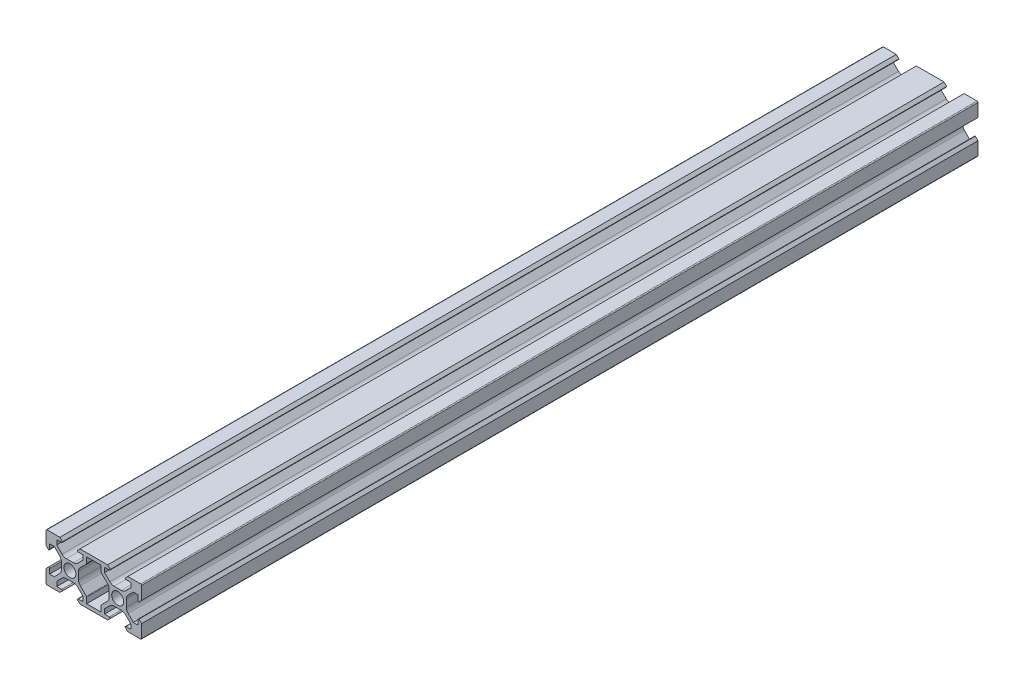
ISO-10303-21;
HEADER;
FILE_DESCRIPTION(('STEP AP214'),'2;1');
FILE_NAME('part.step','',(''),(''),'','','');
FILE_SCHEMA(('AUTOMOTIVE_DESIGN { 1 0 10303 214 1 1 1 1 }'));
ENDSEC;
DATA;
#1=APPLICATION_CONTEXT('core data for automotive mechanical design processes');
#2=APPLICATION_PROTOCOL_DEFINITION('international standard','automotive_design',2000,#1);
#3=PRODUCT_CONTEXT('',#1,'mechanical');
#4=PRODUCT('Part','Part','',(#3));
#5=PRODUCT_RELATED_PRODUCT_CATEGORY('part','',(#4));
#6=PRODUCT_DEFINITION_FORMATION('','',#4);
#7=PRODUCT_DEFINITION_CONTEXT('part definition',#1,'design');
#8=PRODUCT_DEFINITION('design','',#6,#7);
#9=PRODUCT_DEFINITION_SHAPE('','',#8);
#10=(LENGTH_UNIT() NAMED_UNIT(*) SI_UNIT(.MILLI.,.METRE.));
#11=(NAMED_UNIT(*) PLANE_ANGLE_UNIT() SI_UNIT($,.RADIAN.));
#12=(NAMED_UNIT(*) SI_UNIT($,.STERADIAN.) SOLID_ANGLE_UNIT());
#13=UNCERTAINTY_MEASURE_WITH_UNIT(LENGTH_MEASURE(1.E-05),#10,'distance_accuracy_value','');
#14=(GEOMETRIC_REPRESENTATION_CONTEXT(3) GLOBAL_UNCERTAINTY_ASSIGNED_CONTEXT((#13)) GLOBAL_UNIT_ASSIGNED_CONTEXT((#10,
#11,#12)) REPRESENTATION_CONTEXT('',''));
#15=CARTESIAN_POINT('',(0.,0.,0.));
#16=DIRECTION('',(0.,0.,1.));
#17=DIRECTION('',(1.,0.,0.));
#18=AXIS2_PLACEMENT_3D('',#15,#16,#17);
#19=CARTESIAN_POINT('',(13.4999999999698,-8.89999999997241,-350.));
#20=DIRECTION('',(0.,0.,1.));
#21=DIRECTION('',(1.,0.,0.));
#22=AXIS2_PLACEMENT_3D('',#19,#20,#21);
#23=CYLINDRICAL_SURFACE('',#22,0.399999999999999);
#24=CARTESIAN_POINT('',(13.4999999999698,-8.89999999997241,-350.));
#25=DIRECTION('',(0.,0.,1.));
#26=DIRECTION('',(1.,0.,0.));
#27=AXIS2_PLACEMENT_3D('',#24,#25,#26);
#28=CIRCLE('',#27,0.399999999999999);
#29=CARTESIAN_POINT('',(13.4999999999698,-8.49999999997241,-350.));
#30=VERTEX_POINT('',#29);
#31=CARTESIAN_POINT('',(13.0999999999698,-8.89999999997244,-350.));
#32=VERTEX_POINT('',#31);
#33=EDGE_CURVE('E716',#30,#32,#28,.T.);
#34=ORIENTED_EDGE('',*,*,#33,.T.);
#35=DIRECTION('',(0.,0.,1.));
#36=VECTOR('',#35,1.);
#37=CARTESIAN_POINT('',(13.0999999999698,-8.89999999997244,-350.));
#38=LINE('',#37,#36);
#39=CARTESIAN_POINT('',(13.0999999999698,-8.89999999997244,0.));
#40=VERTEX_POINT('',#39);
#41=EDGE_CURVE('E718',#40,#32,#38,.F.);
#42=ORIENTED_EDGE('',*,*,#41,.F.);
#43=CARTESIAN_POINT('',(13.4999999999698,-8.89999999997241,0.));
#44=DIRECTION('',(0.,0.,1.));
#45=DIRECTION('',(1.,0.,0.));
#46=AXIS2_PLACEMENT_3D('',#43,#44,#45);
#47=CIRCLE('',#46,0.399999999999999);
#48=CARTESIAN_POINT('',(13.4999999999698,-8.49999999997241,0.));
#49=VERTEX_POINT('',#48);
#50=EDGE_CURVE('E20',#40,#49,#47,.F.);
#51=ORIENTED_EDGE('',*,*,#50,.T.);
#52=DIRECTION('',(0.,0.,1.));
#53=VECTOR('',#52,1.);
#54=CARTESIAN_POINT('',(13.4999999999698,-8.49999999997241,-350.));
#55=LINE('',#54,#53);
#56=EDGE_CURVE('E1341',#30,#49,#55,.T.);
#57=ORIENTED_EDGE('',*,*,#56,.F.);
#58=EDGE_LOOP('',(#34,#42,#51,#57));
#59=FACE_BOUND('',#58,.T.);
#60=ADVANCED_FACE('F17',(#59),#23,.T.);
#61=CARTESIAN_POINT('',(13.0999999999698,-8.89999999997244,-350.));
#62=DIRECTION('',(-0.707106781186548,-0.707106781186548,0.));
#63=DIRECTION('',(0.707106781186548,-0.707106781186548,0.));
#64=AXIS2_PLACEMENT_3D('',#61,#62,#63);
#65=PLANE('',#64);
#66=DIRECTION('',(0.707106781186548,-0.707106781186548,0.));
#67=VECTOR('',#66,1.);
#68=CARTESIAN_POINT('',(13.0999999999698,-8.89999999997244,-350.));
#69=LINE('',#68,#67);
#70=CARTESIAN_POINT('',(14.2,-10.0000000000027,-350.));
#71=VERTEX_POINT('',#70);
#72=EDGE_CURVE('E721',#32,#71,#69,.T.);
#73=ORIENTED_EDGE('',*,*,#72,.T.);
#74=DIRECTION('',(0.,0.,1.));
#75=VECTOR('',#74,1.);
#76=CARTESIAN_POINT('',(14.2,-10.0000000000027,-350.));
#77=LINE('',#76,#75);
#78=CARTESIAN_POINT('',(14.2,-10.0000000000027,1.11022302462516E-13));
#79=VERTEX_POINT('',#78);
#80=EDGE_CURVE('E725',#79,#71,#77,.F.);
#81=ORIENTED_EDGE('',*,*,#80,.F.);
#82=DIRECTION('',(0.707106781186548,-0.707106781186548,0.));
#83=VECTOR('',#82,1.);
#84=CARTESIAN_POINT('',(13.0999999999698,-8.89999999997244,2.22044604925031E-13));
#85=LINE('',#84,#83);
#86=EDGE_CURVE('E708',#79,#40,#85,.F.);
#87=ORIENTED_EDGE('',*,*,#86,.T.);
#88=ORIENTED_EDGE('',*,*,#41,.T.);
#89=EDGE_LOOP('',(#73,#81,#87,#88));
#90=FACE_BOUND('',#89,.T.);
#91=ADVANCED_FACE('F723',(#90),#65,.T.);
#92=CARTESIAN_POINT('',(19.6,-9.60000000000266,-350.));
#93=DIRECTION('',(0.,0.,1.));
#94=DIRECTION('',(1.,0.,0.));
#95=AXIS2_PLACEMENT_3D('',#92,#93,#94);
#96=CYLINDRICAL_SURFACE('',#95,0.400000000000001);
#97=CARTESIAN_POINT('',(19.6,-9.60000000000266,-350.));
#98=DIRECTION('',(0.,0.,1.));
#99=DIRECTION('',(1.,0.,0.));
#100=AXIS2_PLACEMENT_3D('',#97,#98,#99);
#101=CIRCLE('',#100,0.400000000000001);
#102=CARTESIAN_POINT('',(19.6,-10.0000000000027,-350.));
#103=VERTEX_POINT('',#102);
#104=CARTESIAN_POINT('',(20.,-9.60000000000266,-350.));
#105=VERTEX_POINT('',#104);
#106=EDGE_CURVE('E732',#103,#105,#101,.T.);
#107=ORIENTED_EDGE('',*,*,#106,.T.);
#108=DIRECTION('',(0.,0.,-1.));
#109=VECTOR('',#108,1.);
#110=CARTESIAN_POINT('',(20.,-9.60000000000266,-350.));
#111=LINE('',#110,#109);
#112=CARTESIAN_POINT('',(20.,-9.60000000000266,0.));
#113=VERTEX_POINT('',#112);
#114=EDGE_CURVE('E1348',#113,#105,#111,.T.);
#115=ORIENTED_EDGE('',*,*,#114,.F.);
#116=CARTESIAN_POINT('',(19.6,-9.60000000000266,0.));
#117=DIRECTION('',(0.,0.,1.));
#118=DIRECTION('',(1.,0.,0.));
#119=AXIS2_PLACEMENT_3D('',#116,#117,#118);
#120=CIRCLE('',#119,0.400000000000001);
#121=CARTESIAN_POINT('',(19.6,-10.0000000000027,0.));
#122=VERTEX_POINT('',#121);
#123=EDGE_CURVE('E730',#113,#122,#120,.F.);
#124=ORIENTED_EDGE('',*,*,#123,.T.);
#125=DIRECTION('',(0.,0.,1.));
#126=VECTOR('',#125,1.);
#127=CARTESIAN_POINT('',(19.6,-10.0000000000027,-350.));
#128=LINE('',#127,#126);
#129=EDGE_CURVE('E1345',#103,#122,#128,.T.);
#130=ORIENTED_EDGE('',*,*,#129,.F.);
#131=EDGE_LOOP('',(#107,#115,#124,#130));
#132=FACE_BOUND('',#131,.T.);
#133=ADVANCED_FACE('F2724',(#132),#96,.T.);
#134=CARTESIAN_POINT('',(20.,-4.20000000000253,-350.));
#135=DIRECTION('',(0.707106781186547,0.707106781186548,0.));
#136=DIRECTION('',(-0.707106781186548,0.707106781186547,0.));
#137=AXIS2_PLACEMENT_3D('',#134,#135,#136);
#138=PLANE('',#137);
#139=DIRECTION('',(-0.707106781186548,0.707106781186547,0.));
#140=VECTOR('',#139,1.);
#141=CARTESIAN_POINT('',(20.,-4.20000000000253,-350.));
#142=LINE('',#141,#140);
#143=CARTESIAN_POINT('',(20.,-4.20000000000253,-350.));
#144=VERTEX_POINT('',#143);
#145=CARTESIAN_POINT('',(18.8999999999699,-3.09999999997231,-350.));
#146=VERTEX_POINT('',#145);
#147=EDGE_CURVE('E736',#144,#146,#142,.T.);
#148=ORIENTED_EDGE('',*,*,#147,.T.);
#149=DIRECTION('',(0.,0.,1.));
#150=VECTOR('',#149,1.);
#151=CARTESIAN_POINT('',(18.89999999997,-3.09999999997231,-350.));
#152=LINE('',#151,#150);
#153=CARTESIAN_POINT('',(18.8999999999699,-3.09999999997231,0.));
#154=VERTEX_POINT('',#153);
#155=EDGE_CURVE('E741',#154,#146,#152,.F.);
#156=ORIENTED_EDGE('',*,*,#155,.F.);
#157=DIRECTION('',(-0.707106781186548,0.707106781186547,0.));
#158=VECTOR('',#157,1.);
#159=CARTESIAN_POINT('',(20.,-4.20000000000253,0.));
#160=LINE('',#159,#158);
#161=CARTESIAN_POINT('',(20.,-4.20000000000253,0.));
#162=VERTEX_POINT('',#161);
#163=EDGE_CURVE('E734',#154,#162,#160,.F.);
#164=ORIENTED_EDGE('',*,*,#163,.T.);
#165=DIRECTION('',(0.,0.,-1.));
#166=VECTOR('',#165,1.);
#167=CARTESIAN_POINT('',(20.,-4.20000000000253,-350.));
#168=LINE('',#167,#166);
#169=EDGE_CURVE('E1350',#144,#162,#168,.F.);
#170=ORIENTED_EDGE('',*,*,#169,.F.);
#171=EDGE_LOOP('',(#148,#156,#164,#170));
#172=FACE_BOUND('',#171,.T.);
#173=ADVANCED_FACE('F2714',(#172),#138,.T.);
#174=CARTESIAN_POINT('',(18.8999999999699,-3.49999999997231,-350.));
#175=DIRECTION('',(0.,0.,1.));
#176=DIRECTION('',(1.,0.,0.));
#177=AXIS2_PLACEMENT_3D('',#174,#175,#176);
#178=CYLINDRICAL_SURFACE('',#177,0.400000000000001);
#179=CARTESIAN_POINT('',(18.8999999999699,-3.49999999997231,-350.));
#180=DIRECTION('',(0.,0.,1.));
#181=DIRECTION('',(1.,0.,0.));
#182=AXIS2_PLACEMENT_3D('',#179,#180,#181);
#183=CIRCLE('',#182,0.400000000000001);
#184=CARTESIAN_POINT('',(18.49999999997,-3.49999999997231,-350.));
#185=VERTEX_POINT('',#184);
#186=EDGE_CURVE('E742',#146,#185,#183,.T.);
#187=ORIENTED_EDGE('',*,*,#186,.T.);
#188=DIRECTION('',(0.,0.,1.));
#189=VECTOR('',#188,1.);
#190=CARTESIAN_POINT('',(18.49999999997,-3.49999999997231,-350.));
#191=LINE('',#190,#189);
#192=CARTESIAN_POINT('',(18.49999999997,-3.49999999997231,0.));
#193=VERTEX_POINT('',#192);
#194=EDGE_CURVE('E1353',#193,#185,#191,.F.);
#195=ORIENTED_EDGE('',*,*,#194,.F.);
#196=CARTESIAN_POINT('',(18.8999999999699,-3.49999999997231,0.));
#197=DIRECTION('',(0.,0.,1.));
#198=DIRECTION('',(1.,0.,0.));
#199=AXIS2_PLACEMENT_3D('',#196,#197,#198);
#200=CIRCLE('',#199,0.400000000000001);
#201=EDGE_CURVE('E738',#193,#154,#200,.F.);
#202=ORIENTED_EDGE('',*,*,#201,.T.);
#203=ORIENTED_EDGE('',*,*,#155,.T.);
#204=EDGE_LOOP('',(#187,#195,#202,#203));
#205=FACE_BOUND('',#204,.T.);
#206=ADVANCED_FACE('F2704',(#205),#178,.T.);
#207=CARTESIAN_POINT('',(18.8999999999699,3.49999999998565,-350.));
#208=DIRECTION('',(0.,0.,1.));
#209=DIRECTION('',(1.,0.,0.));
#210=AXIS2_PLACEMENT_3D('',#207,#208,#209);
#211=CYLINDRICAL_SURFACE('',#210,0.400000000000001);
#212=CARTESIAN_POINT('',(18.8999999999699,3.49999999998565,-350.));
#213=DIRECTION('',(0.,0.,1.));
#214=DIRECTION('',(1.,0.,0.));
#215=AXIS2_PLACEMENT_3D('',#212,#213,#214);
#216=CIRCLE('',#215,0.400000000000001);
#217=CARTESIAN_POINT('',(18.4999999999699,3.49999999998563,-350.));
#218=VERTEX_POINT('',#217);
#219=CARTESIAN_POINT('',(18.8999999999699,3.09999999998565,-350.));
#220=VERTEX_POINT('',#219);
#221=EDGE_CURVE('E746',#218,#220,#216,.T.);
#222=ORIENTED_EDGE('',*,*,#221,.T.);
#223=DIRECTION('',(0.,0.,1.));
#224=VECTOR('',#223,1.);
#225=CARTESIAN_POINT('',(18.8999999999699,3.09999999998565,-350.));
#226=LINE('',#225,#224);
#227=CARTESIAN_POINT('',(18.8999999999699,3.09999999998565,0.));
#228=VERTEX_POINT('',#227);
#229=EDGE_CURVE('E751',#228,#220,#226,.F.);
#230=ORIENTED_EDGE('',*,*,#229,.F.);
#231=CARTESIAN_POINT('',(18.8999999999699,3.49999999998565,0.));
#232=DIRECTION('',(0.,0.,1.));
#233=DIRECTION('',(1.,0.,0.));
#234=AXIS2_PLACEMENT_3D('',#231,#232,#233);
#235=CIRCLE('',#234,0.400000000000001);
#236=CARTESIAN_POINT('',(18.4999999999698,3.49999999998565,0.));
#237=VERTEX_POINT('',#236);
#238=EDGE_CURVE('E744',#228,#237,#235,.F.);
#239=ORIENTED_EDGE('',*,*,#238,.T.);
#240=DIRECTION('',(0.,0.,1.));
#241=VECTOR('',#240,1.);
#242=CARTESIAN_POINT('',(18.4999999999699,3.49999999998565,-350.));
#243=LINE('',#242,#241);
#244=EDGE_CURVE('E1378',#218,#237,#243,.T.);
#245=ORIENTED_EDGE('',*,*,#244,.F.);
#246=EDGE_LOOP('',(#222,#230,#239,#245));
#247=FACE_BOUND('',#246,.T.);
#248=ADVANCED_FACE('F2694',(#247),#211,.T.);
#249=CARTESIAN_POINT('',(18.8999999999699,3.09999999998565,-350.));
#250=DIRECTION('',(0.707106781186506,-0.707106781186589,0.));
#251=DIRECTION('',(0.707106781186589,0.707106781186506,0.));
#252=AXIS2_PLACEMENT_3D('',#249,#250,#251);
#253=PLANE('',#252);
#254=DIRECTION('',(0.707106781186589,0.707106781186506,0.));
#255=VECTOR('',#254,1.);
#256=CARTESIAN_POINT('',(18.8999999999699,3.09999999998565,-350.));
#257=LINE('',#256,#255);
#258=CARTESIAN_POINT('',(20.,4.20000000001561,-350.));
#259=VERTEX_POINT('',#258);
#260=EDGE_CURVE('E752',#220,#259,#257,.T.);
#261=ORIENTED_EDGE('',*,*,#260,.T.);
#262=DIRECTION('',(0.,0.,1.));
#263=VECTOR('',#262,1.);
#264=CARTESIAN_POINT('',(20.,4.20000000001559,-350.));
#265=LINE('',#264,#263);
#266=CARTESIAN_POINT('',(20.,4.20000000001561,0.));
#267=VERTEX_POINT('',#266);
#268=EDGE_CURVE('E1381',#267,#259,#265,.F.);
#269=ORIENTED_EDGE('',*,*,#268,.F.);
#270=DIRECTION('',(0.707106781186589,0.707106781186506,0.));
#271=VECTOR('',#270,1.);
#272=CARTESIAN_POINT('',(18.8999999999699,3.09999999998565,0.));
#273=LINE('',#272,#271);
#274=EDGE_CURVE('E748',#267,#228,#273,.F.);
#275=ORIENTED_EDGE('',*,*,#274,.T.);
#276=ORIENTED_EDGE('',*,*,#229,.T.);
#277=EDGE_LOOP('',(#261,#269,#275,#276));
#278=FACE_BOUND('',#277,.T.);
#279=ADVANCED_FACE('F2684',(#278),#253,.T.);
#280=CARTESIAN_POINT('',(19.6,9.60000000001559,-350.));
#281=DIRECTION('',(0.,0.,1.));
#282=DIRECTION('',(1.,0.,0.));
#283=AXIS2_PLACEMENT_3D('',#280,#281,#282);
#284=CYLINDRICAL_SURFACE('',#283,0.400000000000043);
#285=CARTESIAN_POINT('',(19.6,9.60000000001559,-350.));
#286=DIRECTION('',(0.,0.,1.));
#287=DIRECTION('',(1.,0.,0.));
#288=AXIS2_PLACEMENT_3D('',#285,#286,#287);
#289=CIRCLE('',#288,0.400000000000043);
#290=CARTESIAN_POINT('',(20.,9.60000000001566,-350.));
#291=VERTEX_POINT('',#290);
#292=CARTESIAN_POINT('',(19.6,10.0000000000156,-350.));
#293=VERTEX_POINT('',#292);
#294=EDGE_CURVE('E756',#291,#293,#289,.T.);
#295=ORIENTED_EDGE('',*,*,#294,.T.);
#296=DIRECTION('',(0.,0.,1.));
#297=VECTOR('',#296,1.);
#298=CARTESIAN_POINT('',(19.6,10.0000000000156,-350.));
#299=LINE('',#298,#297);
#300=CARTESIAN_POINT('',(19.6,10.0000000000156,0.));
#301=VERTEX_POINT('',#300);
#302=EDGE_CURVE('E1387',#301,#293,#299,.F.);
#303=ORIENTED_EDGE('',*,*,#302,.F.);
#304=CARTESIAN_POINT('',(19.6,9.60000000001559,0.));
#305=DIRECTION('',(0.,0.,1.));
#306=DIRECTION('',(1.,0.,0.));
#307=AXIS2_PLACEMENT_3D('',#304,#305,#306);
#308=CIRCLE('',#307,0.400000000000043);
#309=CARTESIAN_POINT('',(20.,9.60000000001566,0.));
#310=VERTEX_POINT('',#309);
#311=EDGE_CURVE('E754',#301,#310,#308,.F.);
#312=ORIENTED_EDGE('',*,*,#311,.T.);
#313=DIRECTION('',(0.,0.,1.));
#314=VECTOR('',#313,1.);
#315=CARTESIAN_POINT('',(20.,9.60000000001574,-350.));
#316=LINE('',#315,#314);
#317=EDGE_CURVE('E1384',#291,#310,#316,.T.);
#318=ORIENTED_EDGE('',*,*,#317,.F.);
#319=EDGE_LOOP('',(#295,#303,#312,#318));
#320=FACE_BOUND('',#319,.T.);
#321=ADVANCED_FACE('F2674',(#320),#284,.T.);
#322=CARTESIAN_POINT('',(14.2,10.0000000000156,-350.));
#323=DIRECTION('',(-0.707106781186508,0.707106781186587,0.));
#324=DIRECTION('',(-0.707106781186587,-0.707106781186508,0.));
#325=AXIS2_PLACEMENT_3D('',#322,#323,#324);
#326=PLANE('',#325);
#327=DIRECTION('',(-0.707106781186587,-0.707106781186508,0.));
#328=VECTOR('',#327,1.);
#329=CARTESIAN_POINT('',(14.2,10.0000000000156,-350.));
#330=LINE('',#329,#328);
#331=CARTESIAN_POINT('',(14.2,10.0000000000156,-350.));
#332=VERTEX_POINT('',#331);
#333=CARTESIAN_POINT('',(13.0999999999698,8.89999999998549,-350.));
#334=VERTEX_POINT('',#333);
#335=EDGE_CURVE('E760',#332,#334,#330,.T.);
#336=ORIENTED_EDGE('',*,*,#335,.T.);
#337=DIRECTION('',(0.,0.,1.));
#338=VECTOR('',#337,1.);
#339=CARTESIAN_POINT('',(13.0999999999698,8.89999999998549,-350.));
#340=LINE('',#339,#338);
#341=CARTESIAN_POINT('',(13.0999999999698,8.89999999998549,0.));
#342=VERTEX_POINT('',#341);
#343=EDGE_CURVE('E765',#342,#334,#340,.F.);
#344=ORIENTED_EDGE('',*,*,#343,.F.);
#345=DIRECTION('',(-0.707106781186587,-0.707106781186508,0.));
#346=VECTOR('',#345,1.);
#347=CARTESIAN_POINT('',(14.2,10.0000000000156,0.));
#348=LINE('',#347,#346);
#349=CARTESIAN_POINT('',(14.2,10.0000000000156,0.));
#350=VERTEX_POINT('',#349);
#351=EDGE_CURVE('E758',#342,#350,#348,.F.);
#352=ORIENTED_EDGE('',*,*,#351,.T.);
#353=DIRECTION('',(0.,0.,1.));
#354=VECTOR('',#353,1.);
#355=CARTESIAN_POINT('',(14.2,10.0000000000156,-350.));
#356=LINE('',#355,#354);
#357=EDGE_CURVE('E1390',#332,#350,#356,.T.);
#358=ORIENTED_EDGE('',*,*,#357,.F.);
#359=EDGE_LOOP('',(#336,#344,#352,#358));
#360=FACE_BOUND('',#359,.T.);
#361=ADVANCED_FACE('F2664',(#360),#326,.T.);
#362=CARTESIAN_POINT('',(13.4999999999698,8.89999999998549,-350.));
#363=DIRECTION('',(0.,0.,1.));
#364=DIRECTION('',(1.,0.,0.));
#365=AXIS2_PLACEMENT_3D('',#362,#363,#364);
#366=CYLINDRICAL_SURFACE('',#365,0.399999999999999);
#367=CARTESIAN_POINT('',(13.4999999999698,8.89999999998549,-350.));
#368=DIRECTION('',(0.,0.,1.));
#369=DIRECTION('',(1.,0.,0.));
#370=AXIS2_PLACEMENT_3D('',#367,#368,#369);
#371=CIRCLE('',#370,0.399999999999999);
#372=CARTESIAN_POINT('',(13.4999999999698,8.49999999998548,-350.));
#373=VERTEX_POINT('',#372);
#374=EDGE_CURVE('E766',#334,#373,#371,.T.);
#375=ORIENTED_EDGE('',*,*,#374,.T.);
#376=DIRECTION('',(0.,0.,1.));
#377=VECTOR('',#376,1.);
#378=CARTESIAN_POINT('',(13.4999999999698,8.49999999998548,-350.));
#379=LINE('',#378,#377);
#380=CARTESIAN_POINT('',(13.4999999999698,8.49999999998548,0.));
#381=VERTEX_POINT('',#380);
#382=EDGE_CURVE('E1393',#381,#373,#379,.F.);
#383=ORIENTED_EDGE('',*,*,#382,.F.);
#384=CARTESIAN_POINT('',(13.4999999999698,8.89999999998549,0.));
#385=DIRECTION('',(0.,0.,1.));
#386=DIRECTION('',(1.,0.,0.));
#387=AXIS2_PLACEMENT_3D('',#384,#385,#386);
#388=CIRCLE('',#387,0.399999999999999);
#389=EDGE_CURVE('E762',#381,#342,#388,.F.);
#390=ORIENTED_EDGE('',*,*,#389,.T.);
#391=ORIENTED_EDGE('',*,*,#343,.T.);
#392=EDGE_LOOP('',(#375,#383,#390,#391));
#393=FACE_BOUND('',#392,.T.);
#394=ADVANCED_FACE('F2654',(#393),#366,.T.);
#395=CARTESIAN_POINT('',(6.50000000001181,8.90000000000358,-350.));
#396=DIRECTION('',(0.,0.,1.));
#397=DIRECTION('',(1.,0.,0.));
#398=AXIS2_PLACEMENT_3D('',#395,#396,#397);
#399=CYLINDRICAL_SURFACE('',#398,0.4);
#400=CARTESIAN_POINT('',(6.50000000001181,8.90000000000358,-350.));
#401=DIRECTION('',(0.,0.,1.));
#402=DIRECTION('',(1.,0.,0.));
#403=AXIS2_PLACEMENT_3D('',#400,#401,#402);
#404=CIRCLE('',#403,0.4);
#405=CARTESIAN_POINT('',(6.50000000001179,8.50000000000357,-350.));
#406=VERTEX_POINT('',#405);
#407=CARTESIAN_POINT('',(6.90000000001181,8.90000000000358,-350.));
#408=VERTEX_POINT('',#407);
#409=EDGE_CURVE('E770',#406,#408,#404,.T.);
#410=ORIENTED_EDGE('',*,*,#409,.T.);
#411=DIRECTION('',(0.,0.,1.));
#412=VECTOR('',#411,1.);
#413=CARTESIAN_POINT('',(6.90000000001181,8.90000000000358,-350.));
#414=LINE('',#413,#412);
#415=CARTESIAN_POINT('',(6.90000000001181,8.90000000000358,0.));
#416=VERTEX_POINT('',#415);
#417=EDGE_CURVE('E775',#416,#408,#414,.F.);
#418=ORIENTED_EDGE('',*,*,#417,.F.);
#419=CARTESIAN_POINT('',(6.50000000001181,8.90000000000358,0.));
#420=DIRECTION('',(0.,0.,1.));
#421=DIRECTION('',(1.,0.,0.));
#422=AXIS2_PLACEMENT_3D('',#419,#420,#421);
#423=CIRCLE('',#422,0.4);
#424=CARTESIAN_POINT('',(6.50000000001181,8.50000000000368,0.));
#425=VERTEX_POINT('',#424);
#426=EDGE_CURVE('E768',#416,#425,#423,.F.);
#427=ORIENTED_EDGE('',*,*,#426,.T.);
#428=DIRECTION('',(0.,0.,1.));
#429=VECTOR('',#428,1.);
#430=CARTESIAN_POINT('',(6.50000000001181,8.50000000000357,-350.));
#431=LINE('',#430,#429);
#432=EDGE_CURVE('E1418',#406,#425,#431,.T.);
#433=ORIENTED_EDGE('',*,*,#432,.F.);
#434=EDGE_LOOP('',(#410,#418,#427,#433));
#435=FACE_BOUND('',#434,.T.);
#436=ADVANCED_FACE('F2644',(#435),#399,.T.);
#437=CARTESIAN_POINT('',(6.90000000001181,8.90000000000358,-350.));
#438=DIRECTION('',(0.707106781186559,0.707106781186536,0.));
#439=DIRECTION('',(-0.707106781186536,0.707106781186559,0.));
#440=AXIS2_PLACEMENT_3D('',#437,#438,#439);
#441=PLANE('',#440);
#442=DIRECTION('',(-0.707106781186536,0.707106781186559,0.));
#443=VECTOR('',#442,1.);
#444=CARTESIAN_POINT('',(6.90000000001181,8.90000000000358,-350.));
#445=LINE('',#444,#443);
#446=CARTESIAN_POINT('',(5.7999999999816,10.0000000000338,-350.));
#447=VERTEX_POINT('',#446);
#448=EDGE_CURVE('E776',#408,#447,#445,.T.);
#449=ORIENTED_EDGE('',*,*,#448,.T.);
#450=DIRECTION('',(0.,0.,1.));
#451=VECTOR('',#450,1.);
#452=CARTESIAN_POINT('',(5.79999999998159,10.0000000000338,-350.));
#453=LINE('',#452,#451);
#454=CARTESIAN_POINT('',(5.7999999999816,10.0000000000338,0.));
#455=VERTEX_POINT('',#454);
#456=EDGE_CURVE('E1421',#455,#447,#453,.F.);
#457=ORIENTED_EDGE('',*,*,#456,.F.);
#458=DIRECTION('',(-0.707106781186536,0.707106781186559,0.));
#459=VECTOR('',#458,1.);
#460=CARTESIAN_POINT('',(6.90000000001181,8.90000000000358,0.));
#461=LINE('',#460,#459);
#462=EDGE_CURVE('E772',#455,#416,#461,.F.);
#463=ORIENTED_EDGE('',*,*,#462,.T.);
#464=ORIENTED_EDGE('',*,*,#417,.T.);
#465=EDGE_LOOP('',(#449,#457,#463,#464));
#466=FACE_BOUND('',#465,.T.);
#467=ADVANCED_FACE('F2634',(#466),#441,.T.);
#468=CARTESIAN_POINT('',(-5.79999999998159,10.0000000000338,-350.));
#469=DIRECTION('',(-0.707106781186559,0.707106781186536,0.));
#470=DIRECTION('',(-0.707106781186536,-0.707106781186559,0.));
#471=AXIS2_PLACEMENT_3D('',#468,#469,#470);
#472=PLANE('',#471);
#473=DIRECTION('',(-0.707106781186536,-0.707106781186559,0.));
#474=VECTOR('',#473,1.);
#475=CARTESIAN_POINT('',(-5.79999999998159,10.0000000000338,-350.));
#476=LINE('',#475,#474);
#477=CARTESIAN_POINT('',(-5.79999999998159,10.0000000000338,-350.));
#478=VERTEX_POINT('',#477);
#479=CARTESIAN_POINT('',(-6.90000000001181,8.90000000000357,-350.));
#480=VERTEX_POINT('',#479);
#481=EDGE_CURVE('E780',#478,#480,#476,.T.);
#482=ORIENTED_EDGE('',*,*,#481,.T.);
#483=DIRECTION('',(0.,0.,1.));
#484=VECTOR('',#483,1.);
#485=CARTESIAN_POINT('',(-6.90000000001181,8.90000000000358,-350.));
#486=LINE('',#485,#484);
#487=CARTESIAN_POINT('',(-6.90000000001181,8.90000000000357,0.));
#488=VERTEX_POINT('',#487);
#489=EDGE_CURVE('E785',#488,#480,#486,.F.);
#490=ORIENTED_EDGE('',*,*,#489,.F.);
#491=DIRECTION('',(-0.707106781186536,-0.707106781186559,0.));
#492=VECTOR('',#491,1.);
#493=CARTESIAN_POINT('',(-5.79999999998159,10.0000000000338,0.));
#494=LINE('',#493,#492);
#495=CARTESIAN_POINT('',(-5.79999999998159,10.0000000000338,0.));
#496=VERTEX_POINT('',#495);
#497=EDGE_CURVE('E778',#488,#496,#494,.F.);
#498=ORIENTED_EDGE('',*,*,#497,.T.);
#499=DIRECTION('',(0.,0.,1.));
#500=VECTOR('',#499,1.);
#501=CARTESIAN_POINT('',(-5.79999999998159,10.0000000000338,-350.));
#502=LINE('',#501,#500);
#503=EDGE_CURVE('E1424',#478,#496,#502,.T.);
#504=ORIENTED_EDGE('',*,*,#503,.F.);
#505=EDGE_LOOP('',(#482,#490,#498,#504));
#506=FACE_BOUND('',#505,.T.);
#507=ADVANCED_FACE('F2624',(#506),#472,.T.);
#508=CARTESIAN_POINT('',(-6.50000000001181,8.90000000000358,-350.));
#509=DIRECTION('',(0.,0.,1.));
#510=DIRECTION('',(1.,0.,0.));
#511=AXIS2_PLACEMENT_3D('',#508,#509,#510);
#512=CYLINDRICAL_SURFACE('',#511,0.4);
#513=CARTESIAN_POINT('',(-6.50000000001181,8.90000000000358,-350.));
#514=DIRECTION('',(0.,0.,1.));
#515=DIRECTION('',(1.,0.,0.));
#516=AXIS2_PLACEMENT_3D('',#513,#514,#515);
#517=CIRCLE('',#516,0.4);
#518=CARTESIAN_POINT('',(-6.50000000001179,8.50000000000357,-350.));
#519=VERTEX_POINT('',#518);
#520=EDGE_CURVE('E786',#480,#519,#517,.T.);
#521=ORIENTED_EDGE('',*,*,#520,.T.);
#522=DIRECTION('',(0.,0.,1.));
#523=VECTOR('',#522,1.);
#524=CARTESIAN_POINT('',(-6.50000000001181,8.50000000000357,-350.));
#525=LINE('',#524,#523);
#526=CARTESIAN_POINT('',(-6.50000000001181,8.50000000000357,0.));
#527=VERTEX_POINT('',#526);
#528=EDGE_CURVE('E1427',#527,#519,#525,.F.);
#529=ORIENTED_EDGE('',*,*,#528,.F.);
#530=CARTESIAN_POINT('',(-6.50000000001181,8.90000000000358,0.));
#531=DIRECTION('',(0.,0.,1.));
#532=DIRECTION('',(1.,0.,0.));
#533=AXIS2_PLACEMENT_3D('',#530,#531,#532);
#534=CIRCLE('',#533,0.4);
#535=EDGE_CURVE('E782',#527,#488,#534,.F.);
#536=ORIENTED_EDGE('',*,*,#535,.T.);
#537=ORIENTED_EDGE('',*,*,#489,.T.);
#538=EDGE_LOOP('',(#521,#529,#536,#537));
#539=FACE_BOUND('',#538,.T.);
#540=ADVANCED_FACE('F2614',(#539),#512,.T.);
#541=CARTESIAN_POINT('',(-13.4999999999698,8.89999999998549,-350.));
#542=DIRECTION('',(0.,0.,1.));
#543=DIRECTION('',(1.,0.,0.));
#544=AXIS2_PLACEMENT_3D('',#541,#542,#543);
#545=CYLINDRICAL_SURFACE('',#544,0.399999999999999);
#546=CARTESIAN_POINT('',(-13.4999999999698,8.89999999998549,-350.));
#547=DIRECTION('',(0.,0.,1.));
#548=DIRECTION('',(1.,0.,0.));
#549=AXIS2_PLACEMENT_3D('',#546,#547,#548);
#550=CIRCLE('',#549,0.399999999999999);
#551=CARTESIAN_POINT('',(-13.4999999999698,8.49999999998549,-350.));
#552=VERTEX_POINT('',#551);
#553=CARTESIAN_POINT('',(-13.0999999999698,8.89999999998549,-350.));
#554=VERTEX_POINT('',#553);
#555=EDGE_CURVE('E790',#552,#554,#550,.T.);
#556=ORIENTED_EDGE('',*,*,#555,.T.);
#557=DIRECTION('',(0.,0.,1.));
#558=VECTOR('',#557,1.);
#559=CARTESIAN_POINT('',(-13.0999999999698,8.89999999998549,-350.));
#560=LINE('',#559,#558);
#561=CARTESIAN_POINT('',(-13.0999999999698,8.89999999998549,0.));
#562=VERTEX_POINT('',#561);
#563=EDGE_CURVE('E795',#562,#554,#560,.F.);
#564=ORIENTED_EDGE('',*,*,#563,.F.);
#565=CARTESIAN_POINT('',(-13.4999999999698,8.89999999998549,0.));
#566=DIRECTION('',(0.,0.,1.));
#567=DIRECTION('',(1.,0.,0.));
#568=AXIS2_PLACEMENT_3D('',#565,#566,#567);
#569=CIRCLE('',#568,0.399999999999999);
#570=CARTESIAN_POINT('',(-13.4999999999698,8.49999999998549,0.));
#571=VERTEX_POINT('',#570);
#572=EDGE_CURVE('E788',#562,#571,#569,.F.);
#573=ORIENTED_EDGE('',*,*,#572,.T.);
#574=DIRECTION('',(0.,0.,1.));
#575=VECTOR('',#574,1.);
#576=CARTESIAN_POINT('',(-13.4999999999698,8.49999999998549,-350.));
#577=LINE('',#576,#575);
#578=EDGE_CURVE('E1452',#552,#571,#577,.T.);
#579=ORIENTED_EDGE('',*,*,#578,.F.);
#580=EDGE_LOOP('',(#556,#564,#573,#579));
#581=FACE_BOUND('',#580,.T.);
#582=ADVANCED_FACE('F2604',(#581),#545,.T.);
#583=CARTESIAN_POINT('',(-13.0999999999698,8.89999999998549,-350.));
#584=DIRECTION('',(0.707106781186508,0.707106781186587,0.));
#585=DIRECTION('',(-0.707106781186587,0.707106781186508,0.));
#586=AXIS2_PLACEMENT_3D('',#583,#584,#585);
#587=PLANE('',#586);
#588=DIRECTION('',(-0.707106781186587,0.707106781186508,0.));
#589=VECTOR('',#588,1.);
#590=CARTESIAN_POINT('',(-13.0999999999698,8.89999999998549,-350.));
#591=LINE('',#590,#589);
#592=CARTESIAN_POINT('',(-14.2,10.0000000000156,-350.));
#593=VERTEX_POINT('',#592);
#594=EDGE_CURVE('E796',#554,#593,#591,.T.);
#595=ORIENTED_EDGE('',*,*,#594,.T.);
#596=DIRECTION('',(0.,0.,1.));
#597=VECTOR('',#596,1.);
#598=CARTESIAN_POINT('',(-14.2,10.0000000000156,-350.));
#599=LINE('',#598,#597);
#600=CARTESIAN_POINT('',(-14.2,10.0000000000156,0.));
#601=VERTEX_POINT('',#600);
#602=EDGE_CURVE('E1455',#601,#593,#599,.F.);
#603=ORIENTED_EDGE('',*,*,#602,.F.);
#604=DIRECTION('',(-0.707106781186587,0.707106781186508,0.));
#605=VECTOR('',#604,1.);
#606=CARTESIAN_POINT('',(-13.0999999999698,8.89999999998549,0.));
#607=LINE('',#606,#605);
#608=EDGE_CURVE('E792',#601,#562,#607,.F.);
#609=ORIENTED_EDGE('',*,*,#608,.T.);
#610=ORIENTED_EDGE('',*,*,#563,.T.);
#611=EDGE_LOOP('',(#595,#603,#609,#610));
#612=FACE_BOUND('',#611,.T.);
#613=ADVANCED_FACE('F2594',(#612),#587,.T.);
#614=CARTESIAN_POINT('',(-19.6,9.60000000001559,-350.));
#615=DIRECTION('',(0.,0.,1.));
#616=DIRECTION('',(1.,0.,0.));
#617=AXIS2_PLACEMENT_3D('',#614,#615,#616);
#618=CYLINDRICAL_SURFACE('',#617,0.400000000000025);
#619=CARTESIAN_POINT('',(-19.6,9.60000000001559,-350.));
#620=DIRECTION('',(0.,0.,1.));
#621=DIRECTION('',(1.,0.,0.));
#622=AXIS2_PLACEMENT_3D('',#619,#620,#621);
#623=CIRCLE('',#622,0.400000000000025);
#624=CARTESIAN_POINT('',(-19.6,10.0000000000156,-350.));
#625=VERTEX_POINT('',#624);
#626=CARTESIAN_POINT('',(-20.,9.60000000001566,-350.));
#627=VERTEX_POINT('',#626);
#628=EDGE_CURVE('E800',#625,#627,#623,.T.);
#629=ORIENTED_EDGE('',*,*,#628,.T.);
#630=DIRECTION('',(0.,0.,1.));
#631=VECTOR('',#630,1.);
#632=CARTESIAN_POINT('',(-20.,9.60000000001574,-350.));
#633=LINE('',#632,#631);
#634=CARTESIAN_POINT('',(-20.,9.60000000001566,0.));
#635=VERTEX_POINT('',#634);
#636=EDGE_CURVE('E1461',#635,#627,#633,.F.);
#637=ORIENTED_EDGE('',*,*,#636,.F.);
#638=CARTESIAN_POINT('',(-19.6,9.60000000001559,0.));
#639=DIRECTION('',(0.,0.,1.));
#640=DIRECTION('',(1.,0.,0.));
#641=AXIS2_PLACEMENT_3D('',#638,#639,#640);
#642=CIRCLE('',#641,0.400000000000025);
#643=CARTESIAN_POINT('',(-19.6,10.0000000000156,0.));
#644=VERTEX_POINT('',#643);
#645=EDGE_CURVE('E798',#635,#644,#642,.F.);
#646=ORIENTED_EDGE('',*,*,#645,.T.);
#647=DIRECTION('',(0.,0.,1.));
#648=VECTOR('',#647,1.);
#649=CARTESIAN_POINT('',(-19.6,10.0000000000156,-350.));
#650=LINE('',#649,#648);
#651=EDGE_CURVE('E1458',#625,#644,#650,.T.);
#652=ORIENTED_EDGE('',*,*,#651,.F.);
#653=EDGE_LOOP('',(#629,#637,#646,#652));
#654=FACE_BOUND('',#653,.T.);
#655=ADVANCED_FACE('F2584',(#654),#618,.T.);
#656=CARTESIAN_POINT('',(-20.,4.20000000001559,-350.));
#657=DIRECTION('',(-0.707106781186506,-0.707106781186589,0.));
#658=DIRECTION('',(0.707106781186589,-0.707106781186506,0.));
#659=AXIS2_PLACEMENT_3D('',#656,#657,#658);
#660=PLANE('',#659);
#661=DIRECTION('',(0.707106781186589,-0.707106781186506,0.));
#662=VECTOR('',#661,1.);
#663=CARTESIAN_POINT('',(-20.,4.20000000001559,-350.));
#664=LINE('',#663,#662);
#665=CARTESIAN_POINT('',(-20.,4.20000000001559,-350.));
#666=VERTEX_POINT('',#665);
#667=CARTESIAN_POINT('',(-18.8999999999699,3.09999999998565,-350.));
#668=VERTEX_POINT('',#667);
#669=EDGE_CURVE('E804',#666,#668,#664,.T.);
#670=ORIENTED_EDGE('',*,*,#669,.T.);
#671=DIRECTION('',(0.,0.,1.));
#672=VECTOR('',#671,1.);
#673=CARTESIAN_POINT('',(-18.8999999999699,3.09999999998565,-350.));
#674=LINE('',#673,#672);
#675=CARTESIAN_POINT('',(-18.8999999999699,3.09999999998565,0.));
#676=VERTEX_POINT('',#675);
#677=EDGE_CURVE('E809',#676,#668,#674,.F.);
#678=ORIENTED_EDGE('',*,*,#677,.F.);
#679=DIRECTION('',(0.707106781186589,-0.707106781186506,0.));
#680=VECTOR('',#679,1.);
#681=CARTESIAN_POINT('',(-20.,4.20000000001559,0.));
#682=LINE('',#681,#680);
#683=CARTESIAN_POINT('',(-20.,4.20000000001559,0.));
#684=VERTEX_POINT('',#683);
#685=EDGE_CURVE('E802',#676,#684,#682,.F.);
#686=ORIENTED_EDGE('',*,*,#685,.T.);
#687=DIRECTION('',(0.,0.,1.));
#688=VECTOR('',#687,1.);
#689=CARTESIAN_POINT('',(-20.,4.20000000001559,-350.));
#690=LINE('',#689,#688);
#691=EDGE_CURVE('E1464',#666,#684,#690,.T.);
#692=ORIENTED_EDGE('',*,*,#691,.F.);
#693=EDGE_LOOP('',(#670,#678,#686,#692));
#694=FACE_BOUND('',#693,.T.);
#695=ADVANCED_FACE('F2574',(#694),#660,.T.);
#696=CARTESIAN_POINT('',(-18.8999999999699,3.49999999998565,-350.));
#697=DIRECTION('',(0.,0.,1.));
#698=DIRECTION('',(1.,0.,0.));
#699=AXIS2_PLACEMENT_3D('',#696,#697,#698);
#700=CYLINDRICAL_SURFACE('',#699,0.400000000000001);
#701=CARTESIAN_POINT('',(-18.8999999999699,3.49999999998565,-350.));
#702=DIRECTION('',(0.,0.,1.));
#703=DIRECTION('',(1.,0.,0.));
#704=AXIS2_PLACEMENT_3D('',#701,#702,#703);
#705=CIRCLE('',#704,0.400000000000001);
#706=CARTESIAN_POINT('',(-18.4999999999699,3.49999999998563,-350.));
#707=VERTEX_POINT('',#706);
#708=EDGE_CURVE('E810',#668,#707,#705,.T.);
#709=ORIENTED_EDGE('',*,*,#708,.T.);
#710=DIRECTION('',(0.,0.,1.));
#711=VECTOR('',#710,1.);
#712=CARTESIAN_POINT('',(-18.4999999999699,3.49999999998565,-350.));
#713=LINE('',#712,#711);
#714=CARTESIAN_POINT('',(-18.4999999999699,3.49999999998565,0.));
#715=VERTEX_POINT('',#714);
#716=EDGE_CURVE('E1467',#715,#707,#713,.F.);
#717=ORIENTED_EDGE('',*,*,#716,.F.);
#718=CARTESIAN_POINT('',(-18.8999999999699,3.49999999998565,0.));
#719=DIRECTION('',(0.,0.,1.));
#720=DIRECTION('',(1.,0.,0.));
#721=AXIS2_PLACEMENT_3D('',#718,#719,#720);
#722=CIRCLE('',#721,0.400000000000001);
#723=EDGE_CURVE('E806',#715,#676,#722,.F.);
#724=ORIENTED_EDGE('',*,*,#723,.T.);
#725=ORIENTED_EDGE('',*,*,#677,.T.);
#726=EDGE_LOOP('',(#709,#717,#724,#725));
#727=FACE_BOUND('',#726,.T.);
#728=ADVANCED_FACE('F2564',(#727),#700,.T.);
#729=CARTESIAN_POINT('',(-18.8999999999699,-3.49999999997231,-350.));
#730=DIRECTION('',(0.,0.,1.));
#731=DIRECTION('',(1.,0.,0.));
#732=AXIS2_PLACEMENT_3D('',#729,#730,#731);
#733=CYLINDRICAL_SURFACE('',#732,0.400000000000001);
#734=CARTESIAN_POINT('',(-18.8999999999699,-3.49999999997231,-350.));
#735=DIRECTION('',(0.,0.,1.));
#736=DIRECTION('',(1.,0.,0.));
#737=AXIS2_PLACEMENT_3D('',#734,#735,#736);
#738=CIRCLE('',#737,0.400000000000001);
#739=CARTESIAN_POINT('',(-18.49999999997,-3.49999999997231,-350.));
#740=VERTEX_POINT('',#739);
#741=CARTESIAN_POINT('',(-18.89999999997,-3.09999999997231,-350.));
#742=VERTEX_POINT('',#741);
#743=EDGE_CURVE('E814',#740,#742,#738,.T.);
#744=ORIENTED_EDGE('',*,*,#743,.T.);
#745=DIRECTION('',(0.,0.,1.));
#746=VECTOR('',#745,1.);
#747=CARTESIAN_POINT('',(-18.89999999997,-3.09999999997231,-350.));
#748=LINE('',#747,#746);
#749=CARTESIAN_POINT('',(-18.89999999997,-3.09999999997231,0.));
#750=VERTEX_POINT('',#749);
#751=EDGE_CURVE('E819',#750,#742,#748,.F.);
#752=ORIENTED_EDGE('',*,*,#751,.F.);
#753=CARTESIAN_POINT('',(-18.8999999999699,-3.49999999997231,0.));
#754=DIRECTION('',(0.,0.,1.));
#755=DIRECTION('',(1.,0.,0.));
#756=AXIS2_PLACEMENT_3D('',#753,#754,#755);
#757=CIRCLE('',#756,0.400000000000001);
#758=CARTESIAN_POINT('',(-18.49999999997,-3.49999999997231,0.));
#759=VERTEX_POINT('',#758);
#760=EDGE_CURVE('E812',#750,#759,#757,.F.);
#761=ORIENTED_EDGE('',*,*,#760,.T.);
#762=DIRECTION('',(0.,0.,-1.));
#763=VECTOR('',#762,1.);
#764=CARTESIAN_POINT('',(-18.49999999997,-3.49999999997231,-350.));
#765=LINE('',#764,#763);
#766=EDGE_CURVE('E1492',#740,#759,#765,.F.);
#767=ORIENTED_EDGE('',*,*,#766,.F.);
#768=EDGE_LOOP('',(#744,#752,#761,#767));
#769=FACE_BOUND('',#768,.T.);
#770=ADVANCED_FACE('F2554',(#769),#733,.T.);
#771=CARTESIAN_POINT('',(-18.89999999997,-3.09999999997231,-350.));
#772=DIRECTION('',(-0.707106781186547,0.707106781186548,0.));
#773=DIRECTION('',(-0.707106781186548,-0.707106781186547,0.));
#774=AXIS2_PLACEMENT_3D('',#771,#772,#773);
#775=PLANE('',#774);
#776=DIRECTION('',(-0.707106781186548,-0.707106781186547,0.));
#777=VECTOR('',#776,1.);
#778=CARTESIAN_POINT('',(-18.89999999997,-3.09999999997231,-350.));
#779=LINE('',#778,#777);
#780=CARTESIAN_POINT('',(-20.,-4.20000000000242,-350.));
#781=VERTEX_POINT('',#780);
#782=EDGE_CURVE('E820',#742,#781,#779,.T.);
#783=ORIENTED_EDGE('',*,*,#782,.T.);
#784=DIRECTION('',(0.,0.,1.));
#785=VECTOR('',#784,1.);
#786=CARTESIAN_POINT('',(-20.,-4.20000000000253,-350.));
#787=LINE('',#786,#785);
#788=CARTESIAN_POINT('',(-20.,-4.20000000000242,0.));
#789=VERTEX_POINT('',#788);
#790=EDGE_CURVE('E1495',#789,#781,#787,.F.);
#791=ORIENTED_EDGE('',*,*,#790,.F.);
#792=DIRECTION('',(-0.707106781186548,-0.707106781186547,0.));
#793=VECTOR('',#792,1.);
#794=CARTESIAN_POINT('',(-18.89999999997,-3.09999999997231,0.));
#795=LINE('',#794,#793);
#796=EDGE_CURVE('E816',#789,#750,#795,.F.);
#797=ORIENTED_EDGE('',*,*,#796,.T.);
#798=ORIENTED_EDGE('',*,*,#751,.T.);
#799=EDGE_LOOP('',(#783,#791,#797,#798));
#800=FACE_BOUND('',#799,.T.);
#801=ADVANCED_FACE('F2544',(#800),#775,.T.);
#802=CARTESIAN_POINT('',(-19.6,-9.60000000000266,-350.));
#803=DIRECTION('',(0.,0.,1.));
#804=DIRECTION('',(1.,0.,0.));
#805=AXIS2_PLACEMENT_3D('',#802,#803,#804);
#806=CYLINDRICAL_SURFACE('',#805,0.400000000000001);
#807=CARTESIAN_POINT('',(-19.6,-9.60000000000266,-350.));
#808=DIRECTION('',(0.,0.,1.));
#809=DIRECTION('',(1.,0.,0.));
#810=AXIS2_PLACEMENT_3D('',#807,#808,#809);
#811=CIRCLE('',#810,0.400000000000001);
#812=CARTESIAN_POINT('',(-20.,-9.60000000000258,-350.));
#813=VERTEX_POINT('',#812);
#814=CARTESIAN_POINT('',(-19.6,-10.0000000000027,-350.));
#815=VERTEX_POINT('',#814);
#816=EDGE_CURVE('E824',#813,#815,#811,.T.);
#817=ORIENTED_EDGE('',*,*,#816,.T.);
#818=DIRECTION('',(0.,0.,1.));
#819=VECTOR('',#818,1.);
#820=CARTESIAN_POINT('',(-19.6,-10.0000000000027,-350.));
#821=LINE('',#820,#819);
#822=CARTESIAN_POINT('',(-19.6,-10.0000000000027,0.));
#823=VERTEX_POINT('',#822);
#824=EDGE_CURVE('E1501',#823,#815,#821,.F.);
#825=ORIENTED_EDGE('',*,*,#824,.F.);
#826=CARTESIAN_POINT('',(-19.6,-9.60000000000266,0.));
#827=DIRECTION('',(0.,0.,1.));
#828=DIRECTION('',(1.,0.,0.));
#829=AXIS2_PLACEMENT_3D('',#826,#827,#828);
#830=CIRCLE('',#829,0.400000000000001);
#831=CARTESIAN_POINT('',(-20.,-9.60000000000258,0.));
#832=VERTEX_POINT('',#831);
#833=EDGE_CURVE('E822',#823,#832,#830,.F.);
#834=ORIENTED_EDGE('',*,*,#833,.T.);
#835=DIRECTION('',(0.,0.,1.));
#836=VECTOR('',#835,1.);
#837=CARTESIAN_POINT('',(-20.,-9.60000000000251,-350.));
#838=LINE('',#837,#836);
#839=EDGE_CURVE('E1498',#813,#832,#838,.T.);
#840=ORIENTED_EDGE('',*,*,#839,.F.);
#841=EDGE_LOOP('',(#817,#825,#834,#840));
#842=FACE_BOUND('',#841,.T.);
#843=ADVANCED_FACE('F2534',(#842),#806,.T.);
#844=CARTESIAN_POINT('',(-14.2,-10.0000000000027,-350.));
#845=DIRECTION('',(0.707106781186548,-0.707106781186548,0.));
#846=DIRECTION('',(0.707106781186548,0.707106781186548,0.));
#847=AXIS2_PLACEMENT_3D('',#844,#845,#846);
#848=PLANE('',#847);
#849=DIRECTION('',(0.707106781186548,0.707106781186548,0.));
#850=VECTOR('',#849,1.);
#851=CARTESIAN_POINT('',(-14.2,-10.0000000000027,-350.));
#852=LINE('',#851,#850);
#853=CARTESIAN_POINT('',(-14.2,-10.0000000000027,-350.));
#854=VERTEX_POINT('',#853);
#855=CARTESIAN_POINT('',(-13.0999999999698,-8.89999999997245,-350.));
#856=VERTEX_POINT('',#855);
#857=EDGE_CURVE('E828',#854,#856,#852,.T.);
#858=ORIENTED_EDGE('',*,*,#857,.T.);
#859=DIRECTION('',(0.,0.,1.));
#860=VECTOR('',#859,1.);
#861=CARTESIAN_POINT('',(-13.0999999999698,-8.89999999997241,-350.));
#862=LINE('',#861,#860);
#863=CARTESIAN_POINT('',(-13.0999999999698,-8.89999999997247,1.11022302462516E-13));
#864=VERTEX_POINT('',#863);
#865=EDGE_CURVE('E833',#864,#856,#862,.F.);
#866=ORIENTED_EDGE('',*,*,#865,.F.);
#867=DIRECTION('',(0.707106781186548,0.707106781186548,0.));
#868=VECTOR('',#867,1.);
#869=CARTESIAN_POINT('',(-14.2,-10.0000000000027,2.22044604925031E-13));
#870=LINE('',#869,#868);
#871=CARTESIAN_POINT('',(-14.2,-10.0000000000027,1.11022302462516E-13));
#872=VERTEX_POINT('',#871);
#873=EDGE_CURVE('E826',#864,#872,#870,.F.);
#874=ORIENTED_EDGE('',*,*,#873,.T.);
#875=DIRECTION('',(0.,0.,1.));
#876=VECTOR('',#875,1.);
#877=CARTESIAN_POINT('',(-14.2,-10.0000000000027,-350.));
#878=LINE('',#877,#876);
#879=EDGE_CURVE('E1504',#854,#872,#878,.T.);
#880=ORIENTED_EDGE('',*,*,#879,.F.);
#881=EDGE_LOOP('',(#858,#866,#874,#880));
#882=FACE_BOUND('',#881,.T.);
#883=ADVANCED_FACE('F2524',(#882),#848,.T.);
#884=CARTESIAN_POINT('',(-13.4999999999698,-8.89999999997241,-350.));
#885=DIRECTION('',(0.,0.,1.));
#886=DIRECTION('',(1.,0.,0.));
#887=AXIS2_PLACEMENT_3D('',#884,#885,#886);
#888=CYLINDRICAL_SURFACE('',#887,0.399999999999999);
#889=CARTESIAN_POINT('',(-13.4999999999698,-8.89999999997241,-350.));
#890=DIRECTION('',(0.,0.,1.));
#891=DIRECTION('',(1.,0.,0.));
#892=AXIS2_PLACEMENT_3D('',#889,#890,#891);
#893=CIRCLE('',#892,0.399999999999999);
#894=CARTESIAN_POINT('',(-13.4999999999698,-8.49999999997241,-350.));
#895=VERTEX_POINT('',#894);
#896=EDGE_CURVE('E834',#856,#895,#893,.T.);
#897=ORIENTED_EDGE('',*,*,#896,.T.);
#898=DIRECTION('',(0.,0.,1.));
#899=VECTOR('',#898,1.);
#900=CARTESIAN_POINT('',(-13.4999999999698,-8.49999999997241,-350.));
#901=LINE('',#900,#899);
#902=CARTESIAN_POINT('',(-13.4999999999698,-8.49999999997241,0.));
#903=VERTEX_POINT('',#902);
#904=EDGE_CURVE('E1507',#903,#895,#901,.F.);
#905=ORIENTED_EDGE('',*,*,#904,.F.);
#906=CARTESIAN_POINT('',(-13.4999999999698,-8.89999999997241,0.));
#907=DIRECTION('',(0.,0.,1.));
#908=DIRECTION('',(1.,0.,0.));
#909=AXIS2_PLACEMENT_3D('',#906,#907,#908);
#910=CIRCLE('',#909,0.399999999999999);
#911=EDGE_CURVE('E830',#903,#864,#910,.F.);
#912=ORIENTED_EDGE('',*,*,#911,.T.);
#913=ORIENTED_EDGE('',*,*,#865,.T.);
#914=EDGE_LOOP('',(#897,#905,#912,#913));
#915=FACE_BOUND('',#914,.T.);
#916=ADVANCED_FACE('F2514',(#915),#888,.T.);
#917=CARTESIAN_POINT('',(-3.39999999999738,6.10502525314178,-350.));
#918=DIRECTION('',(0.,0.,1.));
#919=DIRECTION('',(1.,0.,0.));
#920=AXIS2_PLACEMENT_3D('',#917,#918,#919);
#921=CYLINDRICAL_SURFACE('',#920,0.4);
#922=CARTESIAN_POINT('',(-3.39999999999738,6.10502525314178,-350.));
#923=DIRECTION('',(0.,0.,1.));
#924=DIRECTION('',(1.,0.,0.));
#925=AXIS2_PLACEMENT_3D('',#922,#923,#924);
#926=CIRCLE('',#925,0.4);
#927=CARTESIAN_POINT('',(-3.11715728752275,5.82218254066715,-350.));
#928=VERTEX_POINT('',#927);
#929=CARTESIAN_POINT('',(-2.99999999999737,6.10502525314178,-350.));
#930=VERTEX_POINT('',#929);
#931=EDGE_CURVE('E838',#928,#930,#926,.T.);
#932=ORIENTED_EDGE('',*,*,#931,.T.);
#933=DIRECTION('',(0.,0.,1.));
#934=VECTOR('',#933,1.);
#935=CARTESIAN_POINT('',(-2.99999999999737,6.10502525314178,-350.));
#936=LINE('',#935,#934);
#937=CARTESIAN_POINT('',(-2.99999999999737,6.10502525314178,0.));
#938=VERTEX_POINT('',#937);
#939=EDGE_CURVE('E1550',#930,#938,#936,.T.);
#940=ORIENTED_EDGE('',*,*,#939,.T.);
#941=CARTESIAN_POINT('',(-3.39999999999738,6.10502525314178,0.));
#942=DIRECTION('',(0.,0.,1.));
#943=DIRECTION('',(1.,0.,0.));
#944=AXIS2_PLACEMENT_3D('',#941,#942,#943);
#945=CIRCLE('',#944,0.4);
#946=CARTESIAN_POINT('',(-3.11715728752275,5.82218254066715,0.));
#947=VERTEX_POINT('',#946);
#948=EDGE_CURVE('E836',#938,#947,#945,.F.);
#949=ORIENTED_EDGE('',*,*,#948,.T.);
#950=DIRECTION('',(0.,0.,1.));
#951=VECTOR('',#950,1.);
#952=CARTESIAN_POINT('',(-3.11715728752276,5.82218254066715,-350.));
#953=LINE('',#952,#951);
#954=EDGE_CURVE('E1547',#947,#928,#953,.F.);
#955=ORIENTED_EDGE('',*,*,#954,.T.);
#956=EDGE_LOOP('',(#932,#940,#949,#955));
#957=FACE_BOUND('',#956,.T.);
#958=ADVANCED_FACE('F2504',(#957),#921,.T.);
#959=CARTESIAN_POINT('',(3.39999999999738,6.10502525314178,-350.));
#960=DIRECTION('',(0.,0.,1.));
#961=DIRECTION('',(1.,0.,0.));
#962=AXIS2_PLACEMENT_3D('',#959,#960,#961);
#963=CYLINDRICAL_SURFACE('',#962,0.4);
#964=CARTESIAN_POINT('',(3.39999999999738,6.10502525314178,-350.));
#965=DIRECTION('',(0.,0.,1.));
#966=DIRECTION('',(1.,0.,0.));
#967=AXIS2_PLACEMENT_3D('',#964,#965,#966);
#968=CIRCLE('',#967,0.4);
#969=CARTESIAN_POINT('',(2.99999999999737,6.10502525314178,-350.));
#970=VERTEX_POINT('',#969);
#971=CARTESIAN_POINT('',(3.11715728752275,5.82218254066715,-350.));
#972=VERTEX_POINT('',#971);
#973=EDGE_CURVE('E842',#970,#972,#968,.T.);
#974=ORIENTED_EDGE('',*,*,#973,.T.);
#975=DIRECTION('',(0.,0.,1.));
#976=VECTOR('',#975,1.);
#977=CARTESIAN_POINT('',(3.11715728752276,5.82218254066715,-350.));
#978=LINE('',#977,#976);
#979=CARTESIAN_POINT('',(3.11715728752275,5.82218254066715,0.));
#980=VERTEX_POINT('',#979);
#981=EDGE_CURVE('E1560',#972,#980,#978,.T.);
#982=ORIENTED_EDGE('',*,*,#981,.T.);
#983=CARTESIAN_POINT('',(3.39999999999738,6.10502525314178,0.));
#984=DIRECTION('',(0.,0.,1.));
#985=DIRECTION('',(1.,0.,0.));
#986=AXIS2_PLACEMENT_3D('',#983,#984,#985);
#987=CIRCLE('',#986,0.4);
#988=CARTESIAN_POINT('',(2.99999999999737,6.10502525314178,0.));
#989=VERTEX_POINT('',#988);
#990=EDGE_CURVE('E840',#980,#989,#987,.F.);
#991=ORIENTED_EDGE('',*,*,#990,.T.);
#992=DIRECTION('',(0.,0.,-1.));
#993=VECTOR('',#992,1.);
#994=CARTESIAN_POINT('',(2.99999999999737,6.10502525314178,-350.));
#995=LINE('',#994,#993);
#996=EDGE_CURVE('E1557',#989,#970,#995,.T.);
#997=ORIENTED_EDGE('',*,*,#996,.T.);
#998=EDGE_LOOP('',(#974,#982,#991,#997));
#999=FACE_BOUND('',#998,.T.);
#1000=ADVANCED_FACE('F2494',(#999),#963,.T.);
#1001=CARTESIAN_POINT('',(3.39999999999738,-6.1050252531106,-350.));
#1002=DIRECTION('',(0.,0.,1.));
#1003=DIRECTION('',(1.,0.,0.));
#1004=AXIS2_PLACEMENT_3D('',#1001,#1002,#1003);
#1005=CYLINDRICAL_SURFACE('',#1004,0.4);
#1006=CARTESIAN_POINT('',(3.39999999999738,-6.1050252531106,-350.));
#1007=DIRECTION('',(0.,0.,1.));
#1008=DIRECTION('',(1.,0.,0.));
#1009=AXIS2_PLACEMENT_3D('',#1006,#1007,#1008);
#1010=CIRCLE('',#1009,0.4);
#1011=CARTESIAN_POINT('',(3.11715728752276,-5.82218254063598,-350.));
#1012=VERTEX_POINT('',#1011);
#1013=CARTESIAN_POINT('',(2.99999999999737,-6.1050252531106,-350.));
#1014=VERTEX_POINT('',#1013);
#1015=EDGE_CURVE('E846',#1012,#1014,#1010,.T.);
#1016=ORIENTED_EDGE('',*,*,#1015,.T.);
#1017=DIRECTION('',(0.,0.,-1.));
#1018=VECTOR('',#1017,1.);
#1019=CARTESIAN_POINT('',(2.99999999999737,-6.1050252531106,-350.));
#1020=LINE('',#1019,#1018);
#1021=CARTESIAN_POINT('',(2.99999999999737,-6.1050252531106,0.));
#1022=VERTEX_POINT('',#1021);
#1023=EDGE_CURVE('E1574',#1014,#1022,#1020,.F.);
#1024=ORIENTED_EDGE('',*,*,#1023,.T.);
#1025=CARTESIAN_POINT('',(3.39999999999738,-6.1050252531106,0.));
#1026=DIRECTION('',(0.,0.,1.));
#1027=DIRECTION('',(1.,0.,0.));
#1028=AXIS2_PLACEMENT_3D('',#1025,#1026,#1027);
#1029=CIRCLE('',#1028,0.4);
#1030=CARTESIAN_POINT('',(3.11715728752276,-5.82218254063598,0.));
#1031=VERTEX_POINT('',#1030);
#1032=EDGE_CURVE('E844',#1022,#1031,#1029,.F.);
#1033=ORIENTED_EDGE('',*,*,#1032,.T.);
#1034=DIRECTION('',(0.,0.,1.));
#1035=VECTOR('',#1034,1.);
#1036=CARTESIAN_POINT('',(3.11715728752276,-5.82218254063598,-350.));
#1037=LINE('',#1036,#1035);
#1038=EDGE_CURVE('E1571',#1031,#1012,#1037,.F.);
#1039=ORIENTED_EDGE('',*,*,#1038,.T.);
#1040=EDGE_LOOP('',(#1016,#1024,#1033,#1039));
#1041=FACE_BOUND('',#1040,.T.);
#1042=ADVANCED_FACE('F2484',(#1041),#1005,.T.);
#1043=CARTESIAN_POINT('',(-3.39999999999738,-6.1050252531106,-350.));
#1044=DIRECTION('',(0.,0.,1.));
#1045=DIRECTION('',(1.,0.,0.));
#1046=AXIS2_PLACEMENT_3D('',#1043,#1044,#1045);
#1047=CYLINDRICAL_SURFACE('',#1046,0.4);
#1048=CARTESIAN_POINT('',(-3.39999999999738,-6.1050252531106,-350.));
#1049=DIRECTION('',(0.,0.,1.));
#1050=DIRECTION('',(1.,0.,0.));
#1051=AXIS2_PLACEMENT_3D('',#1048,#1049,#1050);
#1052=CIRCLE('',#1051,0.4);
#1053=CARTESIAN_POINT('',(-2.99999999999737,-6.1050252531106,-350.));
#1054=VERTEX_POINT('',#1053);
#1055=CARTESIAN_POINT('',(-3.11715728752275,-5.82218254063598,-350.));
#1056=VERTEX_POINT('',#1055);
#1057=EDGE_CURVE('E850',#1054,#1056,#1052,.T.);
#1058=ORIENTED_EDGE('',*,*,#1057,.T.);
#1059=DIRECTION('',(0.,0.,1.));
#1060=VECTOR('',#1059,1.);
#1061=CARTESIAN_POINT('',(-3.11715728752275,-5.82218254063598,-350.));
#1062=LINE('',#1061,#1060);
#1063=CARTESIAN_POINT('',(-3.11715728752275,-5.82218254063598,0.));
#1064=VERTEX_POINT('',#1063);
#1065=EDGE_CURVE('E1534',#1056,#1064,#1062,.T.);
#1066=ORIENTED_EDGE('',*,*,#1065,.T.);
#1067=CARTESIAN_POINT('',(-3.39999999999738,-6.1050252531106,0.));
#1068=DIRECTION('',(0.,0.,1.));
#1069=DIRECTION('',(1.,0.,0.));
#1070=AXIS2_PLACEMENT_3D('',#1067,#1068,#1069);
#1071=CIRCLE('',#1070,0.4);
#1072=CARTESIAN_POINT('',(-2.99999999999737,-6.1050252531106,0.));
#1073=VERTEX_POINT('',#1072);
#1074=EDGE_CURVE('E848',#1064,#1073,#1071,.F.);
#1075=ORIENTED_EDGE('',*,*,#1074,.T.);
#1076=DIRECTION('',(0.,0.,1.));
#1077=VECTOR('',#1076,1.);
#1078=CARTESIAN_POINT('',(-2.99999999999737,-6.1050252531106,-350.));
#1079=LINE('',#1078,#1077);
#1080=EDGE_CURVE('E1581',#1073,#1054,#1079,.F.);
#1081=ORIENTED_EDGE('',*,*,#1080,.T.);
#1082=EDGE_LOOP('',(#1058,#1066,#1075,#1081));
#1083=FACE_BOUND('',#1082,.T.);
#1084=ADVANCED_FACE('F2474',(#1083),#1047,.T.);
#1085=CARTESIAN_POINT('',(-6.50000000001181,-8.8999999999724,-350.));
#1086=DIRECTION('',(0.,0.,1.));
#1087=DIRECTION('',(1.,0.,0.));
#1088=AXIS2_PLACEMENT_3D('',#1085,#1086,#1087);
#1089=CYLINDRICAL_SURFACE('',#1088,0.4);
#1090=CARTESIAN_POINT('',(-6.50000000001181,-8.8999999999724,-350.));
#1091=DIRECTION('',(0.,0.,1.));
#1092=DIRECTION('',(1.,0.,0.));
#1093=AXIS2_PLACEMENT_3D('',#1090,#1091,#1092);
#1094=CIRCLE('',#1093,0.4);
#1095=CARTESIAN_POINT('',(-6.50000000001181,-8.4999999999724,-350.));
#1096=VERTEX_POINT('',#1095);
#1097=CARTESIAN_POINT('',(-6.90000000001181,-8.89999999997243,-350.));
#1098=VERTEX_POINT('',#1097);
#1099=EDGE_CURVE('E852',#1096,#1098,#1094,.T.);
#1100=ORIENTED_EDGE('',*,*,#1099,.T.);
#1101=DIRECTION('',(0.,0.,1.));
#1102=VECTOR('',#1101,1.);
#1103=CARTESIAN_POINT('',(-6.90000000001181,-8.89999999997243,-350.));
#1104=LINE('',#1103,#1102);
#1105=CARTESIAN_POINT('',(-6.90000000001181,-8.89999999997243,0.));
#1106=VERTEX_POINT('',#1105);
#1107=EDGE_CURVE('E1102',#1106,#1098,#1104,.F.);
#1108=ORIENTED_EDGE('',*,*,#1107,.F.);
#1109=CARTESIAN_POINT('',(-6.50000000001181,-8.8999999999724,0.));
#1110=DIRECTION('',(0.,0.,1.));
#1111=DIRECTION('',(1.,0.,0.));
#1112=AXIS2_PLACEMENT_3D('',#1109,#1110,#1111);
#1113=CIRCLE('',#1112,0.4);
#1114=CARTESIAN_POINT('',(-6.50000000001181,-8.4999999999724,0.));
#1115=VERTEX_POINT('',#1114);
#1116=EDGE_CURVE('E1043',#1115,#1106,#1113,.T.);
#1117=ORIENTED_EDGE('',*,*,#1116,.F.);
#1118=DIRECTION('',(0.,0.,1.));
#1119=VECTOR('',#1118,1.);
#1120=CARTESIAN_POINT('',(-6.50000000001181,-8.4999999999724,-350.));
#1121=LINE('',#1120,#1119);
#1122=EDGE_CURVE('E1532',#1096,#1115,#1121,.T.);
#1123=ORIENTED_EDGE('',*,*,#1122,.F.);
#1124=EDGE_LOOP('',(#1100,#1108,#1117,#1123));
#1125=FACE_BOUND('',#1124,.T.);
#1126=ADVANCED_FACE('F2464',(#1125),#1089,.T.);
#1127=CARTESIAN_POINT('',(6.50000000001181,-8.4999999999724,-350.));
#1128=DIRECTION('',(0.,1.,0.));
#1129=DIRECTION('',(0.,0.,1.));
#1130=AXIS2_PLACEMENT_3D('',#1127,#1128,#1129);
#1131=PLANE('',#1130);
#1132=DIRECTION('',(1.,0.,0.));
#1133=VECTOR('',#1132,1.);
#1134=CARTESIAN_POINT('',(6.50000000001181,-8.4999999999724,-350.));
#1135=LINE('',#1134,#1133);
#1136=CARTESIAN_POINT('',(6.50000000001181,-8.4999999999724,-350.));
#1137=VERTEX_POINT('',#1136);
#1138=CARTESIAN_POINT('',(4.49999999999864,-8.4999999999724,-350.));
#1139=VERTEX_POINT('',#1138);
#1140=EDGE_CURVE('E1106',#1137,#1139,#1135,.F.);
#1141=ORIENTED_EDGE('',*,*,#1140,.T.);
#1142=DIRECTION('',(0.,0.,-1.));
#1143=VECTOR('',#1142,1.);
#1144=CARTESIAN_POINT('',(4.49999999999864,-8.4999999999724,-350.));
#1145=LINE('',#1144,#1143);
#1146=CARTESIAN_POINT('',(4.49999999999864,-8.4999999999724,0.));
#1147=VERTEX_POINT('',#1146);
#1148=EDGE_CURVE('E854',#1147,#1139,#1145,.T.);
#1149=ORIENTED_EDGE('',*,*,#1148,.F.);
#1150=DIRECTION('',(1.,0.,0.));
#1151=VECTOR('',#1150,1.);
#1152=CARTESIAN_POINT('',(6.50000000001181,-8.4999999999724,0.));
#1153=LINE('',#1152,#1151);
#1154=CARTESIAN_POINT('',(6.50000000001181,-8.4999999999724,0.));
#1155=VERTEX_POINT('',#1154);
#1156=EDGE_CURVE('E858',#1155,#1147,#1153,.F.);
#1157=ORIENTED_EDGE('',*,*,#1156,.F.);
#1158=DIRECTION('',(0.,0.,1.));
#1159=VECTOR('',#1158,1.);
#1160=CARTESIAN_POINT('',(6.50000000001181,-8.4999999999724,-350.));
#1161=LINE('',#1160,#1159);
#1162=EDGE_CURVE('E859',#1137,#1155,#1161,.T.);
#1163=ORIENTED_EDGE('',*,*,#1162,.F.);
#1164=EDGE_LOOP('',(#1141,#1149,#1157,#1163));
#1165=FACE_BOUND('',#1164,.T.);
#1166=ADVANCED_FACE('F2454',(#1165),#1131,.T.);
#1167=CARTESIAN_POINT('',(4.49999999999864,-8.4999999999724,-350.));
#1168=DIRECTION('',(1.,0.,0.));
#1169=DIRECTION('',(0.,0.,-1.));
#1170=AXIS2_PLACEMENT_3D('',#1167,#1168,#1169);
#1171=PLANE('',#1170);
#1172=DIRECTION('',(0.,1.,0.));
#1173=VECTOR('',#1172,1.);
#1174=CARTESIAN_POINT('',(4.49999999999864,-8.4999999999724,-350.));
#1175=LINE('',#1174,#1173);
#1176=CARTESIAN_POINT('',(4.49999999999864,-6.56066017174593,-350.));
#1177=VERTEX_POINT('',#1176);
#1178=EDGE_CURVE('E1108',#1139,#1177,#1175,.T.);
#1179=ORIENTED_EDGE('',*,*,#1178,.T.);
#1180=DIRECTION('',(0.,0.,1.));
#1181=VECTOR('',#1180,1.);
#1182=CARTESIAN_POINT('',(4.49999999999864,-6.56066017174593,-350.));
#1183=LINE('',#1182,#1181);
#1184=CARTESIAN_POINT('',(4.49999999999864,-6.56066017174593,0.));
#1185=VERTEX_POINT('',#1184);
#1186=EDGE_CURVE('E1324',#1185,#1177,#1183,.F.);
#1187=ORIENTED_EDGE('',*,*,#1186,.F.);
#1188=DIRECTION('',(0.,1.,0.));
#1189=VECTOR('',#1188,1.);
#1190=CARTESIAN_POINT('',(4.49999999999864,-8.8999999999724,0.));
#1191=LINE('',#1190,#1189);
#1192=EDGE_CURVE('E862',#1147,#1185,#1191,.T.);
#1193=ORIENTED_EDGE('',*,*,#1192,.F.);
#1194=ORIENTED_EDGE('',*,*,#1148,.T.);
#1195=EDGE_LOOP('',(#1179,#1187,#1193,#1194));
#1196=FACE_BOUND('',#1195,.T.);
#1197=ADVANCED_FACE('F2444',(#1196),#1171,.T.);
#1198=CARTESIAN_POINT('',(4.49999999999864,-6.56066017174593,-350.));
#1199=DIRECTION('',(0.707106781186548,-0.707106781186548,0.));
#1200=DIRECTION('',(0.707106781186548,0.707106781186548,0.));
#1201=AXIS2_PLACEMENT_3D('',#1198,#1199,#1200);
#1202=PLANE('',#1201);
#1203=DIRECTION('',(0.707106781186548,0.707106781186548,0.));
#1204=VECTOR('',#1203,1.);
#1205=CARTESIAN_POINT('',(4.49999999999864,-6.56066017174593,-350.));
#1206=LINE('',#1205,#1204);
#1207=CARTESIAN_POINT('',(6.72842712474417,-4.33223304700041,-350.));
#1208=VERTEX_POINT('',#1207);
#1209=EDGE_CURVE('E1110',#1177,#1208,#1206,.T.);
#1210=ORIENTED_EDGE('',*,*,#1209,.T.);
#1211=DIRECTION('',(0.,0.,1.));
#1212=VECTOR('',#1211,1.);
#1213=CARTESIAN_POINT('',(6.72842712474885,-4.33223304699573,-350.));
#1214=LINE('',#1213,#1212);
#1215=CARTESIAN_POINT('',(6.72842712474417,-4.33223304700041,0.));
#1216=VERTEX_POINT('',#1215);
#1217=EDGE_CURVE('E1327',#1208,#1216,#1214,.T.);
#1218=ORIENTED_EDGE('',*,*,#1217,.T.);
#1219=DIRECTION('',(0.707106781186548,0.707106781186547,0.));
#1220=VECTOR('',#1219,1.);
#1221=CARTESIAN_POINT('',(4.49999999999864,-6.56066017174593,0.));
#1222=LINE('',#1221,#1220);
#1223=EDGE_CURVE('E865',#1185,#1216,#1222,.T.);
#1224=ORIENTED_EDGE('',*,*,#1223,.F.);
#1225=ORIENTED_EDGE('',*,*,#1186,.T.);
#1226=EDGE_LOOP('',(#1210,#1218,#1224,#1225));
#1227=FACE_BOUND('',#1226,.T.);
#1228=ADVANCED_FACE('F2434',(#1227),#1202,.T.);
#1229=CARTESIAN_POINT('',(8.49619407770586,-6.09999999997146,-350.));
#1230=DIRECTION('',(0.,0.,1.));
#1231=DIRECTION('',(1.,0.,0.));
#1232=AXIS2_PLACEMENT_3D('',#1229,#1230,#1231);
#1233=CYLINDRICAL_SURFACE('',#1232,2.5);
#1234=ORIENTED_EDGE('',*,*,#1217,.F.);
#1235=CARTESIAN_POINT('',(8.49619407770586,-6.09999999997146,-350.));
#1236=DIRECTION('',(0.,0.,1.));
#1237=DIRECTION('',(1.,0.,0.));
#1238=AXIS2_PLACEMENT_3D('',#1235,#1236,#1237);
#1239=CIRCLE('',#1238,2.5);
#1240=CARTESIAN_POINT('',(8.49619407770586,-3.59999999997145,-350.));
#1241=VERTEX_POINT('',#1240);
#1242=EDGE_CURVE('E1112',#1208,#1241,#1239,.F.);
#1243=ORIENTED_EDGE('',*,*,#1242,.T.);
#1244=DIRECTION('',(0.,0.,-1.));
#1245=VECTOR('',#1244,1.);
#1246=CARTESIAN_POINT('',(8.49619407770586,-3.59999999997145,-350.));
#1247=LINE('',#1246,#1245);
#1248=CARTESIAN_POINT('',(8.49619407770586,-3.59999999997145,0.));
#1249=VERTEX_POINT('',#1248);
#1250=EDGE_CURVE('E1329',#1249,#1241,#1247,.T.);
#1251=ORIENTED_EDGE('',*,*,#1250,.F.);
#1252=CARTESIAN_POINT('',(8.49619407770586,-6.09999999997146,0.));
#1253=DIRECTION('',(0.,0.,1.));
#1254=DIRECTION('',(1.,0.,0.));
#1255=AXIS2_PLACEMENT_3D('',#1252,#1253,#1254);
#1256=CIRCLE('',#1255,2.5);
#1257=EDGE_CURVE('E868',#1216,#1249,#1256,.F.);
#1258=ORIENTED_EDGE('',*,*,#1257,.F.);
#1259=EDGE_LOOP('',(#1234,#1243,#1251,#1258));
#1260=FACE_BOUND('',#1259,.T.);
#1261=ADVANCED_FACE('F2424',(#1260),#1233,.F.);
#1262=CARTESIAN_POINT('',(9.99999999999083,-3.59999999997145,-350.));
#1263=DIRECTION('',(0.,-1.,0.));
#1264=DIRECTION('',(0.,0.,-1.));
#1265=AXIS2_PLACEMENT_3D('',#1262,#1263,#1264);
#1266=PLANE('',#1265);
#1267=DIRECTION('',(1.,0.,0.));
#1268=VECTOR('',#1267,1.);
#1269=CARTESIAN_POINT('',(9.99999999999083,-3.59999999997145,-350.));
#1270=LINE('',#1269,#1268);
#1271=CARTESIAN_POINT('',(11.5038059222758,-3.59999999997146,-350.));
#1272=VERTEX_POINT('',#1271);
#1273=EDGE_CURVE('E1114',#1241,#1272,#1270,.T.);
#1274=ORIENTED_EDGE('',*,*,#1273,.T.);
#1275=DIRECTION('',(0.,0.,1.));
#1276=VECTOR('',#1275,1.);
#1277=CARTESIAN_POINT('',(11.5038059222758,-3.59999999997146,-350.));
#1278=LINE('',#1277,#1276);
#1279=CARTESIAN_POINT('',(11.5038059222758,-3.59999999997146,0.));
#1280=VERTEX_POINT('',#1279);
#1281=EDGE_CURVE('E1332',#1272,#1280,#1278,.T.);
#1282=ORIENTED_EDGE('',*,*,#1281,.T.);
#1283=DIRECTION('',(1.,0.,0.));
#1284=VECTOR('',#1283,1.);
#1285=CARTESIAN_POINT('',(6.50000000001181,-3.59999999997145,0.));
#1286=LINE('',#1285,#1284);
#1287=EDGE_CURVE('E871',#1249,#1280,#1286,.T.);
#1288=ORIENTED_EDGE('',*,*,#1287,.F.);
#1289=ORIENTED_EDGE('',*,*,#1250,.T.);
#1290=EDGE_LOOP('',(#1274,#1282,#1288,#1289));
#1291=FACE_BOUND('',#1290,.T.);
#1292=ADVANCED_FACE('F2414',(#1291),#1266,.T.);
#1293=CARTESIAN_POINT('',(11.5038059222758,-6.09999999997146,-350.));
#1294=DIRECTION('',(0.,0.,1.));
#1295=DIRECTION('',(1.,0.,0.));
#1296=AXIS2_PLACEMENT_3D('',#1293,#1294,#1295);
#1297=CYLINDRICAL_SURFACE('',#1296,2.5);
#1298=ORIENTED_EDGE('',*,*,#1281,.F.);
#1299=CARTESIAN_POINT('',(11.5038059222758,-6.09999999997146,-350.));
#1300=DIRECTION('',(0.,0.,1.));
#1301=DIRECTION('',(1.,0.,0.));
#1302=AXIS2_PLACEMENT_3D('',#1299,#1300,#1301);
#1303=CIRCLE('',#1302,2.5);
#1304=CARTESIAN_POINT('',(13.2715728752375,-4.33223304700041,-350.));
#1305=VERTEX_POINT('',#1304);
#1306=EDGE_CURVE('E1116',#1272,#1305,#1303,.F.);
#1307=ORIENTED_EDGE('',*,*,#1306,.T.);
#1308=DIRECTION('',(0.,0.,1.));
#1309=VECTOR('',#1308,1.);
#1310=CARTESIAN_POINT('',(13.2715728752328,-4.33223304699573,-350.));
#1311=LINE('',#1310,#1309);
#1312=CARTESIAN_POINT('',(13.2715728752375,-4.33223304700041,0.));
#1313=VERTEX_POINT('',#1312);
#1314=EDGE_CURVE('E1334',#1313,#1305,#1311,.F.);
#1315=ORIENTED_EDGE('',*,*,#1314,.F.);
#1316=CARTESIAN_POINT('',(11.5038059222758,-6.09999999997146,0.));
#1317=DIRECTION('',(0.,0.,1.));
#1318=DIRECTION('',(1.,0.,0.));
#1319=AXIS2_PLACEMENT_3D('',#1316,#1317,#1318);
#1320=CIRCLE('',#1319,2.5);
#1321=EDGE_CURVE('E874',#1280,#1313,#1320,.F.);
#1322=ORIENTED_EDGE('',*,*,#1321,.F.);
#1323=EDGE_LOOP('',(#1298,#1307,#1315,#1322));
#1324=FACE_BOUND('',#1323,.T.);
#1325=ADVANCED_FACE('F2404',(#1324),#1297,.F.);
#1326=CARTESIAN_POINT('',(13.2715728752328,-4.33223304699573,-350.));
#1327=DIRECTION('',(-0.707106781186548,-0.707106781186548,0.));
#1328=DIRECTION('',(0.707106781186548,-0.707106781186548,0.));
#1329=AXIS2_PLACEMENT_3D('',#1326,#1327,#1328);
#1330=PLANE('',#1329);
#1331=DIRECTION('',(0.707106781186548,-0.707106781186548,0.));
#1332=VECTOR('',#1331,1.);
#1333=CARTESIAN_POINT('',(13.2715728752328,-4.33223304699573,-350.));
#1334=LINE('',#1333,#1332);
#1335=CARTESIAN_POINT('',(15.499999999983,-6.56066017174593,-350.));
#1336=VERTEX_POINT('',#1335);
#1337=EDGE_CURVE('E1118',#1305,#1336,#1334,.T.);
#1338=ORIENTED_EDGE('',*,*,#1337,.T.);
#1339=DIRECTION('',(0.,0.,1.));
#1340=VECTOR('',#1339,1.);
#1341=CARTESIAN_POINT('',(15.499999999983,-6.56066017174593,-350.));
#1342=LINE('',#1341,#1340);
#1343=CARTESIAN_POINT('',(15.499999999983,-6.56066017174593,0.));
#1344=VERTEX_POINT('',#1343);
#1345=EDGE_CURVE('E1337',#1344,#1336,#1342,.F.);
#1346=ORIENTED_EDGE('',*,*,#1345,.F.);
#1347=DIRECTION('',(0.707106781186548,-0.707106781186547,0.));
#1348=VECTOR('',#1347,1.);
#1349=CARTESIAN_POINT('',(13.2715728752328,-4.33223304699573,0.));
#1350=LINE('',#1349,#1348);
#1351=EDGE_CURVE('E877',#1313,#1344,#1350,.T.);
#1352=ORIENTED_EDGE('',*,*,#1351,.F.);
#1353=ORIENTED_EDGE('',*,*,#1314,.T.);
#1354=EDGE_LOOP('',(#1338,#1346,#1352,#1353));
#1355=FACE_BOUND('',#1354,.T.);
#1356=ADVANCED_FACE('F2394',(#1355),#1330,.T.);
#1357=CARTESIAN_POINT('',(15.499999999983,-6.56066017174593,-350.));
#1358=DIRECTION('',(-1.,0.,0.));
#1359=DIRECTION('',(0.,0.,1.));
#1360=AXIS2_PLACEMENT_3D('',#1357,#1358,#1359);
#1361=PLANE('',#1360);
#1362=DIRECTION('',(0.,1.,0.));
#1363=VECTOR('',#1362,1.);
#1364=CARTESIAN_POINT('',(15.499999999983,-6.56066017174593,-350.));
#1365=LINE('',#1364,#1363);
#1366=CARTESIAN_POINT('',(15.499999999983,-8.49999999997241,-350.));
#1367=VERTEX_POINT('',#1366);
#1368=EDGE_CURVE('E1120',#1336,#1367,#1365,.F.);
#1369=ORIENTED_EDGE('',*,*,#1368,.T.);
#1370=DIRECTION('',(0.,0.,1.));
#1371=VECTOR('',#1370,1.);
#1372=CARTESIAN_POINT('',(15.499999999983,-8.49999999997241,-350.));
#1373=LINE('',#1372,#1371);
#1374=CARTESIAN_POINT('',(15.499999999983,-8.49999999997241,0.));
#1375=VERTEX_POINT('',#1374);
#1376=EDGE_CURVE('E1340',#1375,#1367,#1373,.F.);
#1377=ORIENTED_EDGE('',*,*,#1376,.F.);
#1378=DIRECTION('',(0.,1.,0.));
#1379=VECTOR('',#1378,1.);
#1380=CARTESIAN_POINT('',(15.499999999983,-8.8999999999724,0.));
#1381=LINE('',#1380,#1379);
#1382=EDGE_CURVE('E880',#1344,#1375,#1381,.F.);
#1383=ORIENTED_EDGE('',*,*,#1382,.F.);
#1384=ORIENTED_EDGE('',*,*,#1345,.T.);
#1385=EDGE_LOOP('',(#1369,#1377,#1383,#1384));
#1386=FACE_BOUND('',#1385,.T.);
#1387=ADVANCED_FACE('F2384',(#1386),#1361,.T.);
#1388=CARTESIAN_POINT('',(15.499999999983,-8.49999999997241,-350.));
#1389=DIRECTION('',(0.,1.,0.));
#1390=DIRECTION('',(0.,0.,1.));
#1391=AXIS2_PLACEMENT_3D('',#1388,#1389,#1390);
#1392=PLANE('',#1391);
#1393=DIRECTION('',(1.,0.,0.));
#1394=VECTOR('',#1393,1.);
#1395=CARTESIAN_POINT('',(15.499999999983,-8.49999999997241,-350.));
#1396=LINE('',#1395,#1394);
#1397=EDGE_CURVE('E1122',#1367,#30,#1396,.F.);
#1398=ORIENTED_EDGE('',*,*,#1397,.T.);
#1399=ORIENTED_EDGE('',*,*,#56,.T.);
#1400=DIRECTION('',(1.,0.,0.));
#1401=VECTOR('',#1400,1.);
#1402=CARTESIAN_POINT('',(6.50000000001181,-8.49999999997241,0.));
#1403=LINE('',#1402,#1401);
#1404=EDGE_CURVE('E712',#1375,#49,#1403,.F.);
#1405=ORIENTED_EDGE('',*,*,#1404,.F.);
#1406=ORIENTED_EDGE('',*,*,#1376,.T.);
#1407=EDGE_LOOP('',(#1398,#1399,#1405,#1406));
#1408=FACE_BOUND('',#1407,.T.);
#1409=ADVANCED_FACE('F2374',(#1408),#1392,.T.);
#1410=CARTESIAN_POINT('',(14.2,-10.0000000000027,-350.));
#1411=DIRECTION('',(0.,-1.,0.));
#1412=DIRECTION('',(1.,0.,0.));
#1413=AXIS2_PLACEMENT_3D('',#1410,#1411,#1412);
#1414=PLANE('',#1413);
#1415=DIRECTION('',(1.,0.,0.));
#1416=VECTOR('',#1415,1.);
#1417=CARTESIAN_POINT('',(14.2,-10.0000000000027,-350.));
#1418=LINE('',#1417,#1416);
#1419=EDGE_CURVE('E1125',#71,#103,#1418,.T.);
#1420=ORIENTED_EDGE('',*,*,#1419,.T.);
#1421=ORIENTED_EDGE('',*,*,#129,.T.);
#1422=DIRECTION('',(1.,0.,0.));
#1423=VECTOR('',#1422,1.);
#1424=CARTESIAN_POINT('',(6.50000000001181,-10.0000000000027,0.));
#1425=LINE('',#1424,#1423);
#1426=EDGE_CURVE('E883',#79,#122,#1425,.T.);
#1427=ORIENTED_EDGE('',*,*,#1426,.F.);
#1428=ORIENTED_EDGE('',*,*,#80,.T.);
#1429=EDGE_LOOP('',(#1420,#1421,#1427,#1428));
#1430=FACE_BOUND('',#1429,.T.);
#1431=ADVANCED_FACE('F2364',(#1430),#1414,.T.);
#1432=CARTESIAN_POINT('',(20.,-9.60000000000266,-350.));
#1433=DIRECTION('',(1.,0.,0.));
#1434=DIRECTION('',(0.,0.,-1.));
#1435=AXIS2_PLACEMENT_3D('',#1432,#1433,#1434);
#1436=PLANE('',#1435);
#1437=DIRECTION('',(0.,1.,0.));
#1438=VECTOR('',#1437,1.);
#1439=CARTESIAN_POINT('',(20.,-9.60000000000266,-350.));
#1440=LINE('',#1439,#1438);
#1441=EDGE_CURVE('E1128',#105,#144,#1440,.T.);
#1442=ORIENTED_EDGE('',*,*,#1441,.T.);
#1443=ORIENTED_EDGE('',*,*,#169,.T.);
#1444=DIRECTION('',(0.,1.,0.));
#1445=VECTOR('',#1444,1.);
#1446=CARTESIAN_POINT('',(20.,-8.8999999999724,0.));
#1447=LINE('',#1446,#1445);
#1448=EDGE_CURVE('E885',#113,#162,#1447,.T.);
#1449=ORIENTED_EDGE('',*,*,#1448,.F.);
#1450=ORIENTED_EDGE('',*,*,#114,.T.);
#1451=EDGE_LOOP('',(#1442,#1443,#1449,#1450));
#1452=FACE_BOUND('',#1451,.T.);
#1453=ADVANCED_FACE('F2354',(#1452),#1436,.T.);
#1454=CARTESIAN_POINT('',(18.49999999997,-3.49999999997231,-350.));
#1455=DIRECTION('',(-1.,0.,0.));
#1456=DIRECTION('',(0.,0.,1.));
#1457=AXIS2_PLACEMENT_3D('',#1454,#1455,#1456);
#1458=PLANE('',#1457);
#1459=DIRECTION('',(0.,1.,0.));
#1460=VECTOR('',#1459,1.);
#1461=CARTESIAN_POINT('',(18.49999999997,-3.49999999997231,-350.));
#1462=LINE('',#1461,#1460);
#1463=CARTESIAN_POINT('',(18.49999999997,-5.49999999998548,-350.));
#1464=VERTEX_POINT('',#1463);
#1465=EDGE_CURVE('E1131',#185,#1464,#1462,.F.);
#1466=ORIENTED_EDGE('',*,*,#1465,.T.);
#1467=DIRECTION('',(0.,0.,1.));
#1468=VECTOR('',#1467,1.);
#1469=CARTESIAN_POINT('',(18.49999999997,-5.49999999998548,-350.));
#1470=LINE('',#1469,#1468);
#1471=CARTESIAN_POINT('',(18.49999999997,-5.49999999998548,0.));
#1472=VERTEX_POINT('',#1471);
#1473=EDGE_CURVE('E1358',#1472,#1464,#1470,.F.);
#1474=ORIENTED_EDGE('',*,*,#1473,.F.);
#1475=DIRECTION('',(0.,1.,0.));
#1476=VECTOR('',#1475,1.);
#1477=CARTESIAN_POINT('',(18.49999999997,-8.8999999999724,0.));
#1478=LINE('',#1477,#1476);
#1479=EDGE_CURVE('E888',#193,#1472,#1478,.F.);
#1480=ORIENTED_EDGE('',*,*,#1479,.F.);
#1481=ORIENTED_EDGE('',*,*,#194,.T.);
#1482=EDGE_LOOP('',(#1466,#1474,#1480,#1481));
#1483=FACE_BOUND('',#1482,.T.);
#1484=ADVANCED_FACE('F2344',(#1483),#1458,.T.);
#1485=CARTESIAN_POINT('',(18.49999999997,-5.49999999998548,-350.));
#1486=DIRECTION('',(0.,1.,0.));
#1487=DIRECTION('',(0.,0.,1.));
#1488=AXIS2_PLACEMENT_3D('',#1485,#1486,#1487);
#1489=PLANE('',#1488);
#1490=DIRECTION('',(1.,0.,0.));
#1491=VECTOR('',#1490,1.);
#1492=CARTESIAN_POINT('',(18.49999999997,-5.49999999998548,-350.));
#1493=LINE('',#1492,#1491);
#1494=CARTESIAN_POINT('',(16.5606601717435,-5.49999999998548,-350.));
#1495=VERTEX_POINT('',#1494);
#1496=EDGE_CURVE('E1133',#1464,#1495,#1493,.F.);
#1497=ORIENTED_EDGE('',*,*,#1496,.T.);
#1498=DIRECTION('',(0.,0.,1.));
#1499=VECTOR('',#1498,1.);
#1500=CARTESIAN_POINT('',(16.5606601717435,-5.49999999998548,-350.));
#1501=LINE('',#1500,#1499);
#1502=CARTESIAN_POINT('',(16.5606601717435,-5.49999999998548,0.));
#1503=VERTEX_POINT('',#1502);
#1504=EDGE_CURVE('E1361',#1503,#1495,#1501,.F.);
#1505=ORIENTED_EDGE('',*,*,#1504,.F.);
#1506=DIRECTION('',(1.,0.,0.));
#1507=VECTOR('',#1506,1.);
#1508=CARTESIAN_POINT('',(6.50000000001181,-5.49999999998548,0.));
#1509=LINE('',#1508,#1507);
#1510=EDGE_CURVE('E891',#1472,#1503,#1509,.F.);
#1511=ORIENTED_EDGE('',*,*,#1510,.F.);
#1512=ORIENTED_EDGE('',*,*,#1473,.T.);
#1513=EDGE_LOOP('',(#1497,#1505,#1511,#1512));
#1514=FACE_BOUND('',#1513,.T.);
#1515=ADVANCED_FACE('F2334',(#1514),#1489,.T.);
#1516=CARTESIAN_POINT('',(16.5606601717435,-5.49999999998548,-350.));
#1517=DIRECTION('',(0.707106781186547,0.707106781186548,0.));
#1518=DIRECTION('',(-0.707106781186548,0.707106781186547,0.));
#1519=AXIS2_PLACEMENT_3D('',#1516,#1517,#1518);
#1520=PLANE('',#1519);
#1521=DIRECTION('',(-0.707106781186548,0.707106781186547,0.));
#1522=VECTOR('',#1521,1.);
#1523=CARTESIAN_POINT('',(16.5606601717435,-5.49999999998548,-350.));
#1524=LINE('',#1523,#1522);
#1525=CARTESIAN_POINT('',(14.3322330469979,-3.27157287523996,-350.));
#1526=VERTEX_POINT('',#1525);
#1527=EDGE_CURVE('E1135',#1495,#1526,#1524,.T.);
#1528=ORIENTED_EDGE('',*,*,#1527,.T.);
#1529=DIRECTION('',(0.,0.,1.));
#1530=VECTOR('',#1529,1.);
#1531=CARTESIAN_POINT('',(14.3322330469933,-3.27157287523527,-350.));
#1532=LINE('',#1531,#1530);
#1533=CARTESIAN_POINT('',(14.3322330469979,-3.27157287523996,0.));
#1534=VERTEX_POINT('',#1533);
#1535=EDGE_CURVE('E1364',#1526,#1534,#1532,.T.);
#1536=ORIENTED_EDGE('',*,*,#1535,.T.);
#1537=DIRECTION('',(-0.707106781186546,0.707106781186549,0.));
#1538=VECTOR('',#1537,1.);
#1539=CARTESIAN_POINT('',(16.5606601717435,-5.49999999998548,0.));
#1540=LINE('',#1539,#1538);
#1541=EDGE_CURVE('E894',#1503,#1534,#1540,.T.);
#1542=ORIENTED_EDGE('',*,*,#1541,.F.);
#1543=ORIENTED_EDGE('',*,*,#1504,.T.);
#1544=EDGE_LOOP('',(#1528,#1536,#1542,#1543));
#1545=FACE_BOUND('',#1544,.T.);
#1546=ADVANCED_FACE('F2324',(#1545),#1520,.T.);
#1547=CARTESIAN_POINT('',(16.099999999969,-1.50380592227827,-350.));
#1548=DIRECTION('',(0.,0.,1.));
#1549=DIRECTION('',(1.,0.,0.));
#1550=AXIS2_PLACEMENT_3D('',#1547,#1548,#1549);
#1551=CYLINDRICAL_SURFACE('',#1550,2.5);
#1552=ORIENTED_EDGE('',*,*,#1535,.F.);
#1553=CARTESIAN_POINT('',(16.099999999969,-1.50380592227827,-350.));
#1554=DIRECTION('',(0.,0.,1.));
#1555=DIRECTION('',(1.,0.,0.));
#1556=AXIS2_PLACEMENT_3D('',#1553,#1554,#1555);
#1557=CIRCLE('',#1556,2.5);
#1558=CARTESIAN_POINT('',(13.599999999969,-1.50380592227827,-350.));
#1559=VERTEX_POINT('',#1558);
#1560=EDGE_CURVE('E1137',#1526,#1559,#1557,.F.);
#1561=ORIENTED_EDGE('',*,*,#1560,.T.);
#1562=DIRECTION('',(0.,0.,1.));
#1563=VECTOR('',#1562,1.);
#1564=CARTESIAN_POINT('',(13.599999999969,-1.50380592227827,-350.));
#1565=LINE('',#1564,#1563);
#1566=CARTESIAN_POINT('',(13.599999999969,-1.50380592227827,0.));
#1567=VERTEX_POINT('',#1566);
#1568=EDGE_CURVE('E1366',#1567,#1559,#1565,.F.);
#1569=ORIENTED_EDGE('',*,*,#1568,.F.);
#1570=CARTESIAN_POINT('',(16.099999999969,-1.50380592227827,0.));
#1571=DIRECTION('',(0.,0.,1.));
#1572=DIRECTION('',(1.,0.,0.));
#1573=AXIS2_PLACEMENT_3D('',#1570,#1571,#1572);
#1574=CIRCLE('',#1573,2.5);
#1575=EDGE_CURVE('E897',#1534,#1567,#1574,.F.);
#1576=ORIENTED_EDGE('',*,*,#1575,.F.);
#1577=EDGE_LOOP('',(#1552,#1561,#1569,#1576));
#1578=FACE_BOUND('',#1577,.T.);
#1579=ADVANCED_FACE('F2314',(#1578),#1551,.F.);
#1580=CARTESIAN_POINT('',(13.599999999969,6.70644095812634E-12,-350.));
#1581=DIRECTION('',(1.,0.,0.));
#1582=DIRECTION('',(0.,1.,0.));
#1583=AXIS2_PLACEMENT_3D('',#1580,#1581,#1582);
#1584=PLANE('',#1583);
#1585=DIRECTION('',(0.,1.,0.));
#1586=VECTOR('',#1585,1.);
#1587=CARTESIAN_POINT('',(13.599999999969,6.70644095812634E-12,-350.));
#1588=LINE('',#1587,#1586);
#1589=CARTESIAN_POINT('',(13.599999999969,1.50380592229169,-350.));
#1590=VERTEX_POINT('',#1589);
#1591=EDGE_CURVE('E1139',#1559,#1590,#1588,.T.);
#1592=ORIENTED_EDGE('',*,*,#1591,.T.);
#1593=DIRECTION('',(0.,0.,1.));
#1594=VECTOR('',#1593,1.);
#1595=CARTESIAN_POINT('',(13.599999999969,1.50380592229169,-350.));
#1596=LINE('',#1595,#1594);
#1597=CARTESIAN_POINT('',(13.599999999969,1.50380592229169,0.));
#1598=VERTEX_POINT('',#1597);
#1599=EDGE_CURVE('E1369',#1590,#1598,#1596,.T.);
#1600=ORIENTED_EDGE('',*,*,#1599,.T.);
#1601=DIRECTION('',(0.,1.,0.));
#1602=VECTOR('',#1601,1.);
#1603=CARTESIAN_POINT('',(13.599999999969,-8.8999999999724,0.));
#1604=LINE('',#1603,#1602);
#1605=EDGE_CURVE('E900',#1567,#1598,#1604,.T.);
#1606=ORIENTED_EDGE('',*,*,#1605,.F.);
#1607=ORIENTED_EDGE('',*,*,#1568,.T.);
#1608=EDGE_LOOP('',(#1592,#1600,#1606,#1607));
#1609=FACE_BOUND('',#1608,.T.);
#1610=ADVANCED_FACE('F2304',(#1609),#1584,.T.);
#1611=CARTESIAN_POINT('',(16.099999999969,1.50380592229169,-350.));
#1612=DIRECTION('',(0.,0.,1.));
#1613=DIRECTION('',(1.,0.,0.));
#1614=AXIS2_PLACEMENT_3D('',#1611,#1612,#1613);
#1615=CYLINDRICAL_SURFACE('',#1614,2.5);
#1616=ORIENTED_EDGE('',*,*,#1599,.F.);
#1617=CARTESIAN_POINT('',(16.099999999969,1.50380592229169,-350.));
#1618=DIRECTION('',(0.,0.,1.));
#1619=DIRECTION('',(1.,0.,0.));
#1620=AXIS2_PLACEMENT_3D('',#1617,#1618,#1619);
#1621=CIRCLE('',#1620,2.5);
#1622=CARTESIAN_POINT('',(14.3322330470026,3.27157287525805,-350.));
#1623=VERTEX_POINT('',#1622);
#1624=EDGE_CURVE('E1141',#1590,#1623,#1621,.F.);
#1625=ORIENTED_EDGE('',*,*,#1624,.T.);
#1626=DIRECTION('',(0.,0.,1.));
#1627=VECTOR('',#1626,1.);
#1628=CARTESIAN_POINT('',(14.3322330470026,3.27157287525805,-350.));
#1629=LINE('',#1628,#1627);
#1630=CARTESIAN_POINT('',(14.3322330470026,3.27157287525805,0.));
#1631=VERTEX_POINT('',#1630);
#1632=EDGE_CURVE('E1371',#1631,#1623,#1629,.F.);
#1633=ORIENTED_EDGE('',*,*,#1632,.F.);
#1634=CARTESIAN_POINT('',(16.099999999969,1.50380592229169,0.));
#1635=DIRECTION('',(0.,0.,1.));
#1636=DIRECTION('',(1.,0.,0.));
#1637=AXIS2_PLACEMENT_3D('',#1634,#1635,#1636);
#1638=CIRCLE('',#1637,2.5);
#1639=EDGE_CURVE('E903',#1598,#1631,#1638,.F.);
#1640=ORIENTED_EDGE('',*,*,#1639,.F.);
#1641=EDGE_LOOP('',(#1616,#1625,#1633,#1640));
#1642=FACE_BOUND('',#1641,.T.);
#1643=ADVANCED_FACE('F2294',(#1642),#1615,.F.);
#1644=CARTESIAN_POINT('',(14.3322330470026,3.27157287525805,-350.));
#1645=DIRECTION('',(0.707106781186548,-0.707106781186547,0.));
#1646=DIRECTION('',(0.707106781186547,0.707106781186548,0.));
#1647=AXIS2_PLACEMENT_3D('',#1644,#1645,#1646);
#1648=PLANE('',#1647);
#1649=DIRECTION('',(0.707106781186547,0.707106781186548,0.));
#1650=VECTOR('',#1649,1.);
#1651=CARTESIAN_POINT('',(14.3322330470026,3.27157287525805,-350.));
#1652=LINE('',#1651,#1650);
#1653=CARTESIAN_POINT('',(16.5606601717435,5.49999999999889,-350.));
#1654=VERTEX_POINT('',#1653);
#1655=EDGE_CURVE('E1143',#1623,#1654,#1652,.T.);
#1656=ORIENTED_EDGE('',*,*,#1655,.T.);
#1657=DIRECTION('',(0.,0.,1.));
#1658=VECTOR('',#1657,1.);
#1659=CARTESIAN_POINT('',(16.5606601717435,5.49999999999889,-350.));
#1660=LINE('',#1659,#1658);
#1661=CARTESIAN_POINT('',(16.5606601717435,5.49999999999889,0.));
#1662=VERTEX_POINT('',#1661);
#1663=EDGE_CURVE('E1374',#1662,#1654,#1660,.F.);
#1664=ORIENTED_EDGE('',*,*,#1663,.F.);
#1665=DIRECTION('',(0.707106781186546,0.707106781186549,0.));
#1666=VECTOR('',#1665,1.);
#1667=CARTESIAN_POINT('',(14.3322330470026,3.27157287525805,0.));
#1668=LINE('',#1667,#1666);
#1669=EDGE_CURVE('E906',#1631,#1662,#1668,.T.);
#1670=ORIENTED_EDGE('',*,*,#1669,.F.);
#1671=ORIENTED_EDGE('',*,*,#1632,.T.);
#1672=EDGE_LOOP('',(#1656,#1664,#1670,#1671));
#1673=FACE_BOUND('',#1672,.T.);
#1674=ADVANCED_FACE('F2284',(#1673),#1648,.T.);
#1675=CARTESIAN_POINT('',(16.5606601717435,5.49999999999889,-350.));
#1676=DIRECTION('',(-1.06444518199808E-13,-1.,0.));
#1677=DIRECTION('',(1.,-1.06444518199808E-13,0.));
#1678=AXIS2_PLACEMENT_3D('',#1675,#1676,#1677);
#1679=PLANE('',#1678);
#1680=DIRECTION('',(1.,-1.06444518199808E-13,0.));
#1681=VECTOR('',#1680,1.);
#1682=CARTESIAN_POINT('',(16.5606601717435,5.49999999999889,-350.));
#1683=LINE('',#1682,#1681);
#1684=CARTESIAN_POINT('',(18.4999999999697,5.49999999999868,-350.));
#1685=VERTEX_POINT('',#1684);
#1686=EDGE_CURVE('E1145',#1654,#1685,#1683,.T.);
#1687=ORIENTED_EDGE('',*,*,#1686,.T.);
#1688=DIRECTION('',(0.,0.,1.));
#1689=VECTOR('',#1688,1.);
#1690=CARTESIAN_POINT('',(18.4999999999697,5.49999999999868,-350.));
#1691=LINE('',#1690,#1689);
#1692=CARTESIAN_POINT('',(18.4999999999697,5.49999999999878,0.));
#1693=VERTEX_POINT('',#1692);
#1694=EDGE_CURVE('E1377',#1693,#1685,#1691,.F.);
#1695=ORIENTED_EDGE('',*,*,#1694,.F.);
#1696=DIRECTION('',(1.,0.,0.));
#1697=VECTOR('',#1696,1.);
#1698=CARTESIAN_POINT('',(6.50000000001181,5.49999999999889,0.));
#1699=LINE('',#1698,#1697);
#1700=EDGE_CURVE('E909',#1662,#1693,#1699,.T.);
#1701=ORIENTED_EDGE('',*,*,#1700,.F.);
#1702=ORIENTED_EDGE('',*,*,#1663,.T.);
#1703=EDGE_LOOP('',(#1687,#1695,#1701,#1702));
#1704=FACE_BOUND('',#1703,.T.);
#1705=ADVANCED_FACE('F2274',(#1704),#1679,.T.);
#1706=CARTESIAN_POINT('',(18.4999999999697,5.49999999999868,-350.));
#1707=DIRECTION('',(-1.,0.,0.));
#1708=DIRECTION('',(0.,-1.,0.));
#1709=AXIS2_PLACEMENT_3D('',#1706,#1707,#1708);
#1710=PLANE('',#1709);
#1711=DIRECTION('',(0.,-1.,0.));
#1712=VECTOR('',#1711,1.);
#1713=CARTESIAN_POINT('',(18.4999999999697,5.49999999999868,-350.));
#1714=LINE('',#1713,#1712);
#1715=EDGE_CURVE('E1147',#1685,#218,#1714,.T.);
#1716=ORIENTED_EDGE('',*,*,#1715,.T.);
#1717=ORIENTED_EDGE('',*,*,#244,.T.);
#1718=DIRECTION('',(0.,1.,0.));
#1719=VECTOR('',#1718,1.);
#1720=CARTESIAN_POINT('',(18.4999999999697,-8.8999999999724,0.));
#1721=LINE('',#1720,#1719);
#1722=EDGE_CURVE('E912',#1693,#237,#1721,.F.);
#1723=ORIENTED_EDGE('',*,*,#1722,.F.);
#1724=ORIENTED_EDGE('',*,*,#1694,.T.);
#1725=EDGE_LOOP('',(#1716,#1717,#1723,#1724));
#1726=FACE_BOUND('',#1725,.T.);
#1727=ADVANCED_FACE('F2264',(#1726),#1710,.T.);
#1728=CARTESIAN_POINT('',(20.,4.20000000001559,-350.));
#1729=DIRECTION('',(1.,0.,0.));
#1730=DIRECTION('',(0.,1.,0.));
#1731=AXIS2_PLACEMENT_3D('',#1728,#1729,#1730);
#1732=PLANE('',#1731);
#1733=DIRECTION('',(0.,1.,0.));
#1734=VECTOR('',#1733,1.);
#1735=CARTESIAN_POINT('',(20.,4.20000000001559,-350.));
#1736=LINE('',#1735,#1734);
#1737=EDGE_CURVE('E1150',#259,#291,#1736,.T.);
#1738=ORIENTED_EDGE('',*,*,#1737,.T.);
#1739=ORIENTED_EDGE('',*,*,#317,.T.);
#1740=DIRECTION('',(0.,1.,0.));
#1741=VECTOR('',#1740,1.);
#1742=CARTESIAN_POINT('',(20.,-8.8999999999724,0.));
#1743=LINE('',#1742,#1741);
#1744=EDGE_CURVE('E915',#267,#310,#1743,.T.);
#1745=ORIENTED_EDGE('',*,*,#1744,.F.);
#1746=ORIENTED_EDGE('',*,*,#268,.T.);
#1747=EDGE_LOOP('',(#1738,#1739,#1745,#1746));
#1748=FACE_BOUND('',#1747,.T.);
#1749=ADVANCED_FACE('F2254',(#1748),#1732,.T.);
#1750=CARTESIAN_POINT('',(19.6,10.0000000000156,-350.));
#1751=DIRECTION('',(0.,1.,0.));
#1752=DIRECTION('',(0.,0.,1.));
#1753=AXIS2_PLACEMENT_3D('',#1750,#1751,#1752);
#1754=PLANE('',#1753);
#1755=DIRECTION('',(1.,0.,0.));
#1756=VECTOR('',#1755,1.);
#1757=CARTESIAN_POINT('',(19.6,10.0000000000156,-350.));
#1758=LINE('',#1757,#1756);
#1759=EDGE_CURVE('E1153',#293,#332,#1758,.F.);
#1760=ORIENTED_EDGE('',*,*,#1759,.T.);
#1761=ORIENTED_EDGE('',*,*,#357,.T.);
#1762=DIRECTION('',(1.,0.,0.));
#1763=VECTOR('',#1762,1.);
#1764=CARTESIAN_POINT('',(6.50000000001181,10.0000000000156,0.));
#1765=LINE('',#1764,#1763);
#1766=EDGE_CURVE('E918',#301,#350,#1765,.F.);
#1767=ORIENTED_EDGE('',*,*,#1766,.F.);
#1768=ORIENTED_EDGE('',*,*,#302,.T.);
#1769=EDGE_LOOP('',(#1760,#1761,#1767,#1768));
#1770=FACE_BOUND('',#1769,.T.);
#1771=ADVANCED_FACE('F2244',(#1770),#1754,.T.);
#1772=CARTESIAN_POINT('',(13.4999999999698,8.49999999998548,-350.));
#1773=DIRECTION('',(0.,-1.,0.));
#1774=DIRECTION('',(1.,0.,0.));
#1775=AXIS2_PLACEMENT_3D('',#1772,#1773,#1774);
#1776=PLANE('',#1775);
#1777=DIRECTION('',(1.,0.,0.));
#1778=VECTOR('',#1777,1.);
#1779=CARTESIAN_POINT('',(13.4999999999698,8.49999999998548,-350.));
#1780=LINE('',#1779,#1778);
#1781=CARTESIAN_POINT('',(15.499999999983,8.49999999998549,-350.));
#1782=VERTEX_POINT('',#1781);
#1783=EDGE_CURVE('E1156',#373,#1782,#1780,.T.);
#1784=ORIENTED_EDGE('',*,*,#1783,.T.);
#1785=DIRECTION('',(0.,0.,1.));
#1786=VECTOR('',#1785,1.);
#1787=CARTESIAN_POINT('',(15.499999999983,8.49999999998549,-350.));
#1788=LINE('',#1787,#1786);
#1789=CARTESIAN_POINT('',(15.499999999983,8.49999999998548,0.));
#1790=VERTEX_POINT('',#1789);
#1791=EDGE_CURVE('E1398',#1790,#1782,#1788,.F.);
#1792=ORIENTED_EDGE('',*,*,#1791,.F.);
#1793=DIRECTION('',(1.,0.,0.));
#1794=VECTOR('',#1793,1.);
#1795=CARTESIAN_POINT('',(6.50000000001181,8.49999999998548,0.));
#1796=LINE('',#1795,#1794);
#1797=EDGE_CURVE('E921',#381,#1790,#1796,.T.);
#1798=ORIENTED_EDGE('',*,*,#1797,.F.);
#1799=ORIENTED_EDGE('',*,*,#382,.T.);
#1800=EDGE_LOOP('',(#1784,#1792,#1798,#1799));
#1801=FACE_BOUND('',#1800,.T.);
#1802=ADVANCED_FACE('F2234',(#1801),#1776,.T.);
#1803=CARTESIAN_POINT('',(15.499999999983,8.49999999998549,-350.));
#1804=DIRECTION('',(-1.,-1.08233501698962E-13,0.));
#1805=DIRECTION('',(1.08233501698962E-13,-1.,0.));
#1806=AXIS2_PLACEMENT_3D('',#1803,#1804,#1805);
#1807=PLANE('',#1806);
#1808=DIRECTION('',(1.08233501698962E-13,-1.,0.));
#1809=VECTOR('',#1808,1.);
#1810=CARTESIAN_POINT('',(15.499999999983,8.49999999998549,-350.));
#1811=LINE('',#1810,#1809);
#1812=CARTESIAN_POINT('',(15.4999999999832,6.56066017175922,-350.));
#1813=VERTEX_POINT('',#1812);
#1814=EDGE_CURVE('E1158',#1782,#1813,#1811,.T.);
#1815=ORIENTED_EDGE('',*,*,#1814,.T.);
#1816=DIRECTION('',(0.,0.,1.));
#1817=VECTOR('',#1816,1.);
#1818=CARTESIAN_POINT('',(15.4999999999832,6.56066017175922,-350.));
#1819=LINE('',#1818,#1817);
#1820=CARTESIAN_POINT('',(15.4999999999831,6.56066017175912,0.));
#1821=VERTEX_POINT('',#1820);
#1822=EDGE_CURVE('E1401',#1821,#1813,#1819,.F.);
#1823=ORIENTED_EDGE('',*,*,#1822,.F.);
#1824=DIRECTION('',(0.,1.,0.));
#1825=VECTOR('',#1824,1.);
#1826=CARTESIAN_POINT('',(15.499999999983,-8.8999999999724,0.));
#1827=LINE('',#1826,#1825);
#1828=EDGE_CURVE('E924',#1790,#1821,#1827,.F.);
#1829=ORIENTED_EDGE('',*,*,#1828,.F.);
#1830=ORIENTED_EDGE('',*,*,#1791,.T.);
#1831=EDGE_LOOP('',(#1815,#1823,#1829,#1830));
#1832=FACE_BOUND('',#1831,.T.);
#1833=ADVANCED_FACE('F2224',(#1832),#1807,.T.);
#1834=CARTESIAN_POINT('',(15.4999999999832,6.56066017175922,-350.));
#1835=DIRECTION('',(-0.707106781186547,0.707106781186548,0.));
#1836=DIRECTION('',(-0.707106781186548,-0.707106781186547,0.));
#1837=AXIS2_PLACEMENT_3D('',#1834,#1835,#1836);
#1838=PLANE('',#1837);
#1839=DIRECTION('',(-0.707106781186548,-0.707106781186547,0.));
#1840=VECTOR('',#1839,1.);
#1841=CARTESIAN_POINT('',(15.4999999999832,6.56066017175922,-350.));
#1842=LINE('',#1841,#1840);
#1843=CARTESIAN_POINT('',(13.2715728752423,4.33223304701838,-350.));
#1844=VERTEX_POINT('',#1843);
#1845=EDGE_CURVE('E1160',#1813,#1844,#1842,.T.);
#1846=ORIENTED_EDGE('',*,*,#1845,.T.);
#1847=DIRECTION('',(0.,0.,1.));
#1848=VECTOR('',#1847,1.);
#1849=CARTESIAN_POINT('',(13.2715728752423,4.33223304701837,-350.));
#1850=LINE('',#1849,#1848);
#1851=CARTESIAN_POINT('',(13.2715728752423,4.33223304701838,0.));
#1852=VERTEX_POINT('',#1851);
#1853=EDGE_CURVE('E1404',#1844,#1852,#1850,.T.);
#1854=ORIENTED_EDGE('',*,*,#1853,.T.);
#1855=DIRECTION('',(-0.70710678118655,-0.707106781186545,0.));
#1856=VECTOR('',#1855,1.);
#1857=CARTESIAN_POINT('',(15.4999999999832,6.56066017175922,0.));
#1858=LINE('',#1857,#1856);
#1859=EDGE_CURVE('E927',#1821,#1852,#1858,.T.);
#1860=ORIENTED_EDGE('',*,*,#1859,.F.);
#1861=ORIENTED_EDGE('',*,*,#1822,.T.);
#1862=EDGE_LOOP('',(#1846,#1854,#1860,#1861));
#1863=FACE_BOUND('',#1862,.T.);
#1864=ADVANCED_FACE('F2214',(#1863),#1838,.T.);
#1865=CARTESIAN_POINT('',(11.5038059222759,6.09999999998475,-350.));
#1866=DIRECTION('',(0.,0.,1.));
#1867=DIRECTION('',(1.,0.,0.));
#1868=AXIS2_PLACEMENT_3D('',#1865,#1866,#1867);
#1869=CYLINDRICAL_SURFACE('',#1868,2.5);
#1870=ORIENTED_EDGE('',*,*,#1853,.F.);
#1871=CARTESIAN_POINT('',(11.5038059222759,6.09999999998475,-350.));
#1872=DIRECTION('',(0.,0.,1.));
#1873=DIRECTION('',(1.,0.,0.));
#1874=AXIS2_PLACEMENT_3D('',#1871,#1872,#1873);
#1875=CIRCLE('',#1874,2.5);
#1876=CARTESIAN_POINT('',(11.5038059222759,3.59999999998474,-350.));
#1877=VERTEX_POINT('',#1876);
#1878=EDGE_CURVE('E1162',#1844,#1877,#1875,.F.);
#1879=ORIENTED_EDGE('',*,*,#1878,.T.);
#1880=DIRECTION('',(0.,0.,1.));
#1881=VECTOR('',#1880,1.);
#1882=CARTESIAN_POINT('',(11.5038059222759,3.59999999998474,-350.));
#1883=LINE('',#1882,#1881);
#1884=CARTESIAN_POINT('',(11.5038059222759,3.59999999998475,0.));
#1885=VERTEX_POINT('',#1884);
#1886=EDGE_CURVE('E1406',#1885,#1877,#1883,.F.);
#1887=ORIENTED_EDGE('',*,*,#1886,.F.);
#1888=CARTESIAN_POINT('',(11.5038059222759,6.09999999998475,0.));
#1889=DIRECTION('',(0.,0.,1.));
#1890=DIRECTION('',(1.,0.,0.));
#1891=AXIS2_PLACEMENT_3D('',#1888,#1889,#1890);
#1892=CIRCLE('',#1891,2.5);
#1893=EDGE_CURVE('E930',#1852,#1885,#1892,.F.);
#1894=ORIENTED_EDGE('',*,*,#1893,.F.);
#1895=EDGE_LOOP('',(#1870,#1879,#1887,#1894));
#1896=FACE_BOUND('',#1895,.T.);
#1897=ADVANCED_FACE('F2204',(#1896),#1869,.F.);
#1898=CARTESIAN_POINT('',(9.99999999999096,3.59999999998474,-350.));
#1899=DIRECTION('',(0.,1.,0.));
#1900=DIRECTION('',(0.,0.,1.));
#1901=AXIS2_PLACEMENT_3D('',#1898,#1899,#1900);
#1902=PLANE('',#1901);
#1903=DIRECTION('',(1.,0.,0.));
#1904=VECTOR('',#1903,1.);
#1905=CARTESIAN_POINT('',(9.99999999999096,3.59999999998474,-350.));
#1906=LINE('',#1905,#1904);
#1907=CARTESIAN_POINT('',(8.49619407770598,3.59999999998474,-350.));
#1908=VERTEX_POINT('',#1907);
#1909=EDGE_CURVE('E1164',#1877,#1908,#1906,.F.);
#1910=ORIENTED_EDGE('',*,*,#1909,.T.);
#1911=DIRECTION('',(0.,0.,1.));
#1912=VECTOR('',#1911,1.);
#1913=CARTESIAN_POINT('',(8.49619407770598,3.59999999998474,-350.));
#1914=LINE('',#1913,#1912);
#1915=CARTESIAN_POINT('',(8.49619407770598,3.59999999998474,0.));
#1916=VERTEX_POINT('',#1915);
#1917=EDGE_CURVE('E1409',#1908,#1916,#1914,.T.);
#1918=ORIENTED_EDGE('',*,*,#1917,.T.);
#1919=DIRECTION('',(1.,0.,0.));
#1920=VECTOR('',#1919,1.);
#1921=CARTESIAN_POINT('',(6.50000000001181,3.59999999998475,0.));
#1922=LINE('',#1921,#1920);
#1923=EDGE_CURVE('E933',#1885,#1916,#1922,.F.);
#1924=ORIENTED_EDGE('',*,*,#1923,.F.);
#1925=ORIENTED_EDGE('',*,*,#1886,.T.);
#1926=EDGE_LOOP('',(#1910,#1918,#1924,#1925));
#1927=FACE_BOUND('',#1926,.T.);
#1928=ADVANCED_FACE('F2194',(#1927),#1902,.T.);
#1929=CARTESIAN_POINT('',(8.49619407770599,6.09999999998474,-350.));
#1930=DIRECTION('',(0.,0.,1.));
#1931=DIRECTION('',(1.,0.,0.));
#1932=AXIS2_PLACEMENT_3D('',#1929,#1930,#1931);
#1933=CYLINDRICAL_SURFACE('',#1932,2.5);
#1934=ORIENTED_EDGE('',*,*,#1917,.F.);
#1935=CARTESIAN_POINT('',(8.49619407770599,6.09999999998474,-350.));
#1936=DIRECTION('',(0.,0.,1.));
#1937=DIRECTION('',(1.,0.,0.));
#1938=AXIS2_PLACEMENT_3D('',#1935,#1936,#1937);
#1939=CIRCLE('',#1938,2.5);
#1940=CARTESIAN_POINT('',(6.7284271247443,4.3322330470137,-350.));
#1941=VERTEX_POINT('',#1940);
#1942=EDGE_CURVE('E1166',#1908,#1941,#1939,.F.);
#1943=ORIENTED_EDGE('',*,*,#1942,.T.);
#1944=DIRECTION('',(0.,0.,1.));
#1945=VECTOR('',#1944,1.);
#1946=CARTESIAN_POINT('',(6.72842712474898,4.33223304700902,-350.));
#1947=LINE('',#1946,#1945);
#1948=CARTESIAN_POINT('',(6.7284271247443,4.3322330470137,0.));
#1949=VERTEX_POINT('',#1948);
#1950=EDGE_CURVE('E1411',#1949,#1941,#1947,.F.);
#1951=ORIENTED_EDGE('',*,*,#1950,.F.);
#1952=CARTESIAN_POINT('',(8.49619407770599,6.09999999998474,0.));
#1953=DIRECTION('',(0.,0.,1.));
#1954=DIRECTION('',(1.,0.,0.));
#1955=AXIS2_PLACEMENT_3D('',#1952,#1953,#1954);
#1956=CIRCLE('',#1955,2.5);
#1957=EDGE_CURVE('E936',#1916,#1949,#1956,.F.);
#1958=ORIENTED_EDGE('',*,*,#1957,.F.);
#1959=EDGE_LOOP('',(#1934,#1943,#1951,#1958));
#1960=FACE_BOUND('',#1959,.T.);
#1961=ADVANCED_FACE('F2184',(#1960),#1933,.F.);
#1962=CARTESIAN_POINT('',(6.72842712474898,4.33223304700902,-350.));
#1963=DIRECTION('',(0.707106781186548,0.707106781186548,0.));
#1964=DIRECTION('',(-0.707106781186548,0.707106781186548,0.));
#1965=AXIS2_PLACEMENT_3D('',#1962,#1963,#1964);
#1966=PLANE('',#1965);
#1967=DIRECTION('',(-0.707106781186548,0.707106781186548,0.));
#1968=VECTOR('',#1967,1.);
#1969=CARTESIAN_POINT('',(6.72842712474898,4.33223304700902,-350.));
#1970=LINE('',#1969,#1968);
#1971=CARTESIAN_POINT('',(4.49999999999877,6.56066017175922,-350.));
#1972=VERTEX_POINT('',#1971);
#1973=EDGE_CURVE('E1168',#1941,#1972,#1970,.T.);
#1974=ORIENTED_EDGE('',*,*,#1973,.T.);
#1975=DIRECTION('',(0.,0.,1.));
#1976=VECTOR('',#1975,1.);
#1977=CARTESIAN_POINT('',(4.49999999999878,6.56066017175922,-350.));
#1978=LINE('',#1977,#1976);
#1979=CARTESIAN_POINT('',(4.49999999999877,6.56066017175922,0.));
#1980=VERTEX_POINT('',#1979);
#1981=EDGE_CURVE('E1414',#1980,#1972,#1978,.F.);
#1982=ORIENTED_EDGE('',*,*,#1981,.F.);
#1983=DIRECTION('',(-0.707106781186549,0.707106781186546,0.));
#1984=VECTOR('',#1983,1.);
#1985=CARTESIAN_POINT('',(6.72842712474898,4.33223304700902,0.));
#1986=LINE('',#1985,#1984);
#1987=EDGE_CURVE('E939',#1949,#1980,#1986,.T.);
#1988=ORIENTED_EDGE('',*,*,#1987,.F.);
#1989=ORIENTED_EDGE('',*,*,#1950,.T.);
#1990=EDGE_LOOP('',(#1974,#1982,#1988,#1989));
#1991=FACE_BOUND('',#1990,.T.);
#1992=ADVANCED_FACE('F2174',(#1991),#1966,.T.);
#1993=CARTESIAN_POINT('',(4.49999999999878,6.56066017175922,-350.));
#1994=DIRECTION('',(1.,0.,0.));
#1995=DIRECTION('',(0.,1.,0.));
#1996=AXIS2_PLACEMENT_3D('',#1993,#1994,#1995);
#1997=PLANE('',#1996);
#1998=DIRECTION('',(0.,1.,0.));
#1999=VECTOR('',#1998,1.);
#2000=CARTESIAN_POINT('',(4.49999999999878,6.56066017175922,-350.));
#2001=LINE('',#2000,#1999);
#2002=CARTESIAN_POINT('',(4.49999999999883,8.50000000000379,-350.));
#2003=VERTEX_POINT('',#2002);
#2004=EDGE_CURVE('E1170',#1972,#2003,#2001,.T.);
#2005=ORIENTED_EDGE('',*,*,#2004,.T.);
#2006=DIRECTION('',(0.,0.,1.));
#2007=VECTOR('',#2006,1.);
#2008=CARTESIAN_POINT('',(4.49999999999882,8.50000000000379,-350.));
#2009=LINE('',#2008,#2007);
#2010=CARTESIAN_POINT('',(4.4999999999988,8.50000000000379,0.));
#2011=VERTEX_POINT('',#2010);
#2012=EDGE_CURVE('E1417',#2011,#2003,#2009,.F.);
#2013=ORIENTED_EDGE('',*,*,#2012,.F.);
#2014=DIRECTION('',(0.,1.,0.));
#2015=VECTOR('',#2014,1.);
#2016=CARTESIAN_POINT('',(4.49999999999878,-8.8999999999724,0.));
#2017=LINE('',#2016,#2015);
#2018=EDGE_CURVE('E942',#1980,#2011,#2017,.T.);
#2019=ORIENTED_EDGE('',*,*,#2018,.F.);
#2020=ORIENTED_EDGE('',*,*,#1981,.T.);
#2021=EDGE_LOOP('',(#2005,#2013,#2019,#2020));
#2022=FACE_BOUND('',#2021,.T.);
#2023=ADVANCED_FACE('F2164',(#2022),#1997,.T.);
#2024=CARTESIAN_POINT('',(4.49999999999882,8.50000000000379,-350.));
#2025=DIRECTION('',(-1.11022302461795E-13,-1.,0.));
#2026=DIRECTION('',(1.,-1.11022302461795E-13,0.));
#2027=AXIS2_PLACEMENT_3D('',#2024,#2025,#2026);
#2028=PLANE('',#2027);
#2029=DIRECTION('',(1.,-1.11022302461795E-13,0.));
#2030=VECTOR('',#2029,1.);
#2031=CARTESIAN_POINT('',(4.49999999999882,8.50000000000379,-350.));
#2032=LINE('',#2031,#2030);
#2033=EDGE_CURVE('E1172',#2003,#406,#2032,.T.);
#2034=ORIENTED_EDGE('',*,*,#2033,.T.);
#2035=ORIENTED_EDGE('',*,*,#432,.T.);
#2036=DIRECTION('',(1.,0.,0.));
#2037=VECTOR('',#2036,1.);
#2038=CARTESIAN_POINT('',(6.50000000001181,8.50000000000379,0.));
#2039=LINE('',#2038,#2037);
#2040=EDGE_CURVE('E945',#2011,#425,#2039,.T.);
#2041=ORIENTED_EDGE('',*,*,#2040,.F.);
#2042=ORIENTED_EDGE('',*,*,#2012,.T.);
#2043=EDGE_LOOP('',(#2034,#2035,#2041,#2042));
#2044=FACE_BOUND('',#2043,.T.);
#2045=ADVANCED_FACE('F2154',(#2044),#2028,.T.);
#2046=CARTESIAN_POINT('',(5.79999999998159,10.0000000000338,-350.));
#2047=DIRECTION('',(0.,1.,0.));
#2048=DIRECTION('',(0.,0.,1.));
#2049=AXIS2_PLACEMENT_3D('',#2046,#2047,#2048);
#2050=PLANE('',#2049);
#2051=DIRECTION('',(1.,0.,0.));
#2052=VECTOR('',#2051,1.);
#2053=CARTESIAN_POINT('',(5.79999999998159,10.0000000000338,-350.));
#2054=LINE('',#2053,#2052);
#2055=EDGE_CURVE('E1175',#447,#478,#2054,.F.);
#2056=ORIENTED_EDGE('',*,*,#2055,.T.);
#2057=ORIENTED_EDGE('',*,*,#503,.T.);
#2058=DIRECTION('',(1.,0.,0.));
#2059=VECTOR('',#2058,1.);
#2060=CARTESIAN_POINT('',(6.50000000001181,10.0000000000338,0.));
#2061=LINE('',#2060,#2059);
#2062=EDGE_CURVE('E948',#455,#496,#2061,.F.);
#2063=ORIENTED_EDGE('',*,*,#2062,.F.);
#2064=ORIENTED_EDGE('',*,*,#456,.T.);
#2065=EDGE_LOOP('',(#2056,#2057,#2063,#2064));
#2066=FACE_BOUND('',#2065,.T.);
#2067=ADVANCED_FACE('F2144',(#2066),#2050,.T.);
#2068=CARTESIAN_POINT('',(-6.50000000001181,8.50000000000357,-350.));
#2069=DIRECTION('',(1.11022302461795E-13,-1.,0.));
#2070=DIRECTION('',(1.,1.11022302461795E-13,0.));
#2071=AXIS2_PLACEMENT_3D('',#2068,#2069,#2070);
#2072=PLANE('',#2071);
#2073=DIRECTION('',(1.,1.11022302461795E-13,0.));
#2074=VECTOR('',#2073,1.);
#2075=CARTESIAN_POINT('',(-6.50000000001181,8.50000000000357,-350.));
#2076=LINE('',#2075,#2074);
#2077=CARTESIAN_POINT('',(-4.49999999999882,8.50000000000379,-350.));
#2078=VERTEX_POINT('',#2077);
#2079=EDGE_CURVE('E1178',#519,#2078,#2076,.T.);
#2080=ORIENTED_EDGE('',*,*,#2079,.T.);
#2081=DIRECTION('',(0.,0.,1.));
#2082=VECTOR('',#2081,1.);
#2083=CARTESIAN_POINT('',(-4.49999999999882,8.50000000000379,-350.));
#2084=LINE('',#2083,#2082);
#2085=CARTESIAN_POINT('',(-4.49999999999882,8.50000000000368,0.));
#2086=VERTEX_POINT('',#2085);
#2087=EDGE_CURVE('E1432',#2086,#2078,#2084,.F.);
#2088=ORIENTED_EDGE('',*,*,#2087,.F.);
#2089=DIRECTION('',(1.,0.,0.));
#2090=VECTOR('',#2089,1.);
#2091=CARTESIAN_POINT('',(6.50000000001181,8.50000000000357,0.));
#2092=LINE('',#2091,#2090);
#2093=EDGE_CURVE('E951',#527,#2086,#2092,.T.);
#2094=ORIENTED_EDGE('',*,*,#2093,.F.);
#2095=ORIENTED_EDGE('',*,*,#528,.T.);
#2096=EDGE_LOOP('',(#2080,#2088,#2094,#2095));
#2097=FACE_BOUND('',#2096,.T.);
#2098=ADVANCED_FACE('F2134',(#2097),#2072,.T.);
#2099=CARTESIAN_POINT('',(-4.49999999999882,8.50000000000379,-350.));
#2100=DIRECTION('',(-1.,0.,0.));
#2101=DIRECTION('',(0.,-1.,0.));
#2102=AXIS2_PLACEMENT_3D('',#2099,#2100,#2101);
#2103=PLANE('',#2102);
#2104=DIRECTION('',(0.,-1.,0.));
#2105=VECTOR('',#2104,1.);
#2106=CARTESIAN_POINT('',(-4.49999999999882,8.50000000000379,-350.));
#2107=LINE('',#2106,#2105);
#2108=CARTESIAN_POINT('',(-4.49999999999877,6.56066017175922,-350.));
#2109=VERTEX_POINT('',#2108);
#2110=EDGE_CURVE('E1180',#2078,#2109,#2107,.T.);
#2111=ORIENTED_EDGE('',*,*,#2110,.T.);
#2112=DIRECTION('',(0.,0.,1.));
#2113=VECTOR('',#2112,1.);
#2114=CARTESIAN_POINT('',(-4.49999999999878,6.56066017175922,-350.));
#2115=LINE('',#2114,#2113);
#2116=CARTESIAN_POINT('',(-4.4999999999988,6.56066017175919,0.));
#2117=VERTEX_POINT('',#2116);
#2118=EDGE_CURVE('E1435',#2117,#2109,#2115,.F.);
#2119=ORIENTED_EDGE('',*,*,#2118,.F.);
#2120=DIRECTION('',(0.,1.,0.));
#2121=VECTOR('',#2120,1.);
#2122=CARTESIAN_POINT('',(-4.49999999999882,-8.8999999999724,0.));
#2123=LINE('',#2122,#2121);
#2124=EDGE_CURVE('E954',#2086,#2117,#2123,.F.);
#2125=ORIENTED_EDGE('',*,*,#2124,.F.);
#2126=ORIENTED_EDGE('',*,*,#2087,.T.);
#2127=EDGE_LOOP('',(#2111,#2119,#2125,#2126));
#2128=FACE_BOUND('',#2127,.T.);
#2129=ADVANCED_FACE('F2124',(#2128),#2103,.T.);
#2130=CARTESIAN_POINT('',(-4.49999999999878,6.56066017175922,-350.));
#2131=DIRECTION('',(-0.707106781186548,0.707106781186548,0.));
#2132=DIRECTION('',(-0.707106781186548,-0.707106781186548,0.));
#2133=AXIS2_PLACEMENT_3D('',#2130,#2131,#2132);
#2134=PLANE('',#2133);
#2135=DIRECTION('',(-0.707106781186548,-0.707106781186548,0.));
#2136=VECTOR('',#2135,1.);
#2137=CARTESIAN_POINT('',(-4.49999999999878,6.56066017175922,-350.));
#2138=LINE('',#2137,#2136);
#2139=CARTESIAN_POINT('',(-6.7284271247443,4.33223304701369,-350.));
#2140=VERTEX_POINT('',#2139);
#2141=EDGE_CURVE('E1182',#2109,#2140,#2138,.T.);
#2142=ORIENTED_EDGE('',*,*,#2141,.T.);
#2143=DIRECTION('',(0.,0.,1.));
#2144=VECTOR('',#2143,1.);
#2145=CARTESIAN_POINT('',(-6.72842712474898,4.33223304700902,-350.));
#2146=LINE('',#2145,#2144);
#2147=CARTESIAN_POINT('',(-6.7284271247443,4.3322330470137,0.));
#2148=VERTEX_POINT('',#2147);
#2149=EDGE_CURVE('E1438',#2140,#2148,#2146,.T.);
#2150=ORIENTED_EDGE('',*,*,#2149,.T.);
#2151=DIRECTION('',(-0.707106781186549,-0.707106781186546,0.));
#2152=VECTOR('',#2151,1.);
#2153=CARTESIAN_POINT('',(-4.49999999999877,6.56066017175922,0.));
#2154=LINE('',#2153,#2152);
#2155=EDGE_CURVE('E957',#2117,#2148,#2154,.T.);
#2156=ORIENTED_EDGE('',*,*,#2155,.F.);
#2157=ORIENTED_EDGE('',*,*,#2118,.T.);
#2158=EDGE_LOOP('',(#2142,#2150,#2156,#2157));
#2159=FACE_BOUND('',#2158,.T.);
#2160=ADVANCED_FACE('F2114',(#2159),#2134,.T.);
#2161=CARTESIAN_POINT('',(-8.49619407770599,6.09999999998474,-350.));
#2162=DIRECTION('',(0.,0.,1.));
#2163=DIRECTION('',(1.,0.,0.));
#2164=AXIS2_PLACEMENT_3D('',#2161,#2162,#2163);
#2165=CYLINDRICAL_SURFACE('',#2164,2.5);
#2166=ORIENTED_EDGE('',*,*,#2149,.F.);
#2167=CARTESIAN_POINT('',(-8.49619407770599,6.09999999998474,-350.));
#2168=DIRECTION('',(0.,0.,1.));
#2169=DIRECTION('',(1.,0.,0.));
#2170=AXIS2_PLACEMENT_3D('',#2167,#2168,#2169);
#2171=CIRCLE('',#2170,2.5);
#2172=CARTESIAN_POINT('',(-8.49619407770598,3.59999999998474,-350.));
#2173=VERTEX_POINT('',#2172);
#2174=EDGE_CURVE('E1184',#2140,#2173,#2171,.F.);
#2175=ORIENTED_EDGE('',*,*,#2174,.T.);
#2176=DIRECTION('',(0.,0.,1.));
#2177=VECTOR('',#2176,1.);
#2178=CARTESIAN_POINT('',(-8.49619407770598,3.59999999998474,-350.));
#2179=LINE('',#2178,#2177);
#2180=CARTESIAN_POINT('',(-8.49619407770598,3.59999999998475,0.));
#2181=VERTEX_POINT('',#2180);
#2182=EDGE_CURVE('E1440',#2181,#2173,#2179,.F.);
#2183=ORIENTED_EDGE('',*,*,#2182,.F.);
#2184=CARTESIAN_POINT('',(-8.49619407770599,6.09999999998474,0.));
#2185=DIRECTION('',(0.,0.,1.));
#2186=DIRECTION('',(1.,0.,0.));
#2187=AXIS2_PLACEMENT_3D('',#2184,#2185,#2186);
#2188=CIRCLE('',#2187,2.5);
#2189=EDGE_CURVE('E960',#2148,#2181,#2188,.F.);
#2190=ORIENTED_EDGE('',*,*,#2189,.F.);
#2191=EDGE_LOOP('',(#2166,#2175,#2183,#2190));
#2192=FACE_BOUND('',#2191,.T.);
#2193=ADVANCED_FACE('F2104',(#2192),#2165,.F.);
#2194=CARTESIAN_POINT('',(-9.99999999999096,3.59999999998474,-350.));
#2195=DIRECTION('',(0.,1.,0.));
#2196=DIRECTION('',(0.,0.,1.));
#2197=AXIS2_PLACEMENT_3D('',#2194,#2195,#2196);
#2198=PLANE('',#2197);
#2199=DIRECTION('',(1.,0.,0.));
#2200=VECTOR('',#2199,1.);
#2201=CARTESIAN_POINT('',(-9.99999999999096,3.59999999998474,-350.));
#2202=LINE('',#2201,#2200);
#2203=CARTESIAN_POINT('',(-11.5038059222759,3.59999999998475,-350.));
#2204=VERTEX_POINT('',#2203);
#2205=EDGE_CURVE('E1186',#2173,#2204,#2202,.F.);
#2206=ORIENTED_EDGE('',*,*,#2205,.T.);
#2207=DIRECTION('',(0.,0.,1.));
#2208=VECTOR('',#2207,1.);
#2209=CARTESIAN_POINT('',(-11.5038059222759,3.59999999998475,-350.));
#2210=LINE('',#2209,#2208);
#2211=CARTESIAN_POINT('',(-11.5038059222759,3.59999999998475,0.));
#2212=VERTEX_POINT('',#2211);
#2213=EDGE_CURVE('E1443',#2204,#2212,#2210,.T.);
#2214=ORIENTED_EDGE('',*,*,#2213,.T.);
#2215=DIRECTION('',(1.,0.,0.));
#2216=VECTOR('',#2215,1.);
#2217=CARTESIAN_POINT('',(6.50000000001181,3.59999999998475,0.));
#2218=LINE('',#2217,#2216);
#2219=EDGE_CURVE('E963',#2181,#2212,#2218,.F.);
#2220=ORIENTED_EDGE('',*,*,#2219,.F.);
#2221=ORIENTED_EDGE('',*,*,#2182,.T.);
#2222=EDGE_LOOP('',(#2206,#2214,#2220,#2221));
#2223=FACE_BOUND('',#2222,.T.);
#2224=ADVANCED_FACE('F2094',(#2223),#2198,.T.);
#2225=CARTESIAN_POINT('',(-11.5038059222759,6.09999999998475,-350.));
#2226=DIRECTION('',(0.,0.,1.));
#2227=DIRECTION('',(1.,0.,0.));
#2228=AXIS2_PLACEMENT_3D('',#2225,#2226,#2227);
#2229=CYLINDRICAL_SURFACE('',#2228,2.5);
#2230=ORIENTED_EDGE('',*,*,#2213,.F.);
#2231=CARTESIAN_POINT('',(-11.5038059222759,6.09999999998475,-350.));
#2232=DIRECTION('',(0.,0.,1.));
#2233=DIRECTION('',(1.,0.,0.));
#2234=AXIS2_PLACEMENT_3D('',#2231,#2232,#2233);
#2235=CIRCLE('',#2234,2.5);
#2236=CARTESIAN_POINT('',(-13.2715728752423,4.33223304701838,-350.));
#2237=VERTEX_POINT('',#2236);
#2238=EDGE_CURVE('E1188',#2204,#2237,#2235,.F.);
#2239=ORIENTED_EDGE('',*,*,#2238,.T.);
#2240=DIRECTION('',(0.,0.,1.));
#2241=VECTOR('',#2240,1.);
#2242=CARTESIAN_POINT('',(-13.2715728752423,4.33223304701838,-350.));
#2243=LINE('',#2242,#2241);
#2244=CARTESIAN_POINT('',(-13.2715728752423,4.33223304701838,0.));
#2245=VERTEX_POINT('',#2244);
#2246=EDGE_CURVE('E1445',#2245,#2237,#2243,.F.);
#2247=ORIENTED_EDGE('',*,*,#2246,.F.);
#2248=CARTESIAN_POINT('',(-11.5038059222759,6.09999999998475,0.));
#2249=DIRECTION('',(0.,0.,1.));
#2250=DIRECTION('',(1.,0.,0.));
#2251=AXIS2_PLACEMENT_3D('',#2248,#2249,#2250);
#2252=CIRCLE('',#2251,2.5);
#2253=EDGE_CURVE('E966',#2212,#2245,#2252,.F.);
#2254=ORIENTED_EDGE('',*,*,#2253,.F.);
#2255=EDGE_LOOP('',(#2230,#2239,#2247,#2254));
#2256=FACE_BOUND('',#2255,.T.);
#2257=ADVANCED_FACE('F2084',(#2256),#2229,.F.);
#2258=CARTESIAN_POINT('',(-13.2715728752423,4.33223304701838,-350.));
#2259=DIRECTION('',(0.707106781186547,0.707106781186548,0.));
#2260=DIRECTION('',(-0.707106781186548,0.707106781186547,0.));
#2261=AXIS2_PLACEMENT_3D('',#2258,#2259,#2260);
#2262=PLANE('',#2261);
#2263=DIRECTION('',(-0.707106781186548,0.707106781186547,0.));
#2264=VECTOR('',#2263,1.);
#2265=CARTESIAN_POINT('',(-13.2715728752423,4.33223304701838,-350.));
#2266=LINE('',#2265,#2264);
#2267=CARTESIAN_POINT('',(-15.4999999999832,6.56066017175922,-350.));
#2268=VERTEX_POINT('',#2267);
#2269=EDGE_CURVE('E1190',#2237,#2268,#2266,.T.);
#2270=ORIENTED_EDGE('',*,*,#2269,.T.);
#2271=DIRECTION('',(0.,0.,1.));
#2272=VECTOR('',#2271,1.);
#2273=CARTESIAN_POINT('',(-15.4999999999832,6.56066017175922,-350.));
#2274=LINE('',#2273,#2272);
#2275=CARTESIAN_POINT('',(-15.4999999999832,6.56066017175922,0.));
#2276=VERTEX_POINT('',#2275);
#2277=EDGE_CURVE('E1448',#2276,#2268,#2274,.F.);
#2278=ORIENTED_EDGE('',*,*,#2277,.F.);
#2279=DIRECTION('',(-0.707106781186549,0.707106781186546,0.));
#2280=VECTOR('',#2279,1.);
#2281=CARTESIAN_POINT('',(-13.2715728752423,4.33223304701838,0.));
#2282=LINE('',#2281,#2280);
#2283=EDGE_CURVE('E969',#2245,#2276,#2282,.T.);
#2284=ORIENTED_EDGE('',*,*,#2283,.F.);
#2285=ORIENTED_EDGE('',*,*,#2246,.T.);
#2286=EDGE_LOOP('',(#2270,#2278,#2284,#2285));
#2287=FACE_BOUND('',#2286,.T.);
#2288=ADVANCED_FACE('F2074',(#2287),#2262,.T.);
#2289=CARTESIAN_POINT('',(-15.4999999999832,6.56066017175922,-350.));
#2290=DIRECTION('',(1.,-1.08233501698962E-13,0.));
#2291=DIRECTION('',(1.08233501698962E-13,1.,0.));
#2292=AXIS2_PLACEMENT_3D('',#2289,#2290,#2291);
#2293=PLANE('',#2292);
#2294=DIRECTION('',(1.08233501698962E-13,1.,0.));
#2295=VECTOR('',#2294,1.);
#2296=CARTESIAN_POINT('',(-15.4999999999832,6.56066017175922,-350.));
#2297=LINE('',#2296,#2295);
#2298=CARTESIAN_POINT('',(-15.4999999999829,8.49999999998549,-350.));
#2299=VERTEX_POINT('',#2298);
#2300=EDGE_CURVE('E1192',#2268,#2299,#2297,.T.);
#2301=ORIENTED_EDGE('',*,*,#2300,.T.);
#2302=DIRECTION('',(0.,0.,1.));
#2303=VECTOR('',#2302,1.);
#2304=CARTESIAN_POINT('',(-15.499999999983,8.49999999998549,-350.));
#2305=LINE('',#2304,#2303);
#2306=CARTESIAN_POINT('',(-15.4999999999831,8.49999999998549,0.));
#2307=VERTEX_POINT('',#2306);
#2308=EDGE_CURVE('E1451',#2307,#2299,#2305,.F.);
#2309=ORIENTED_EDGE('',*,*,#2308,.F.);
#2310=DIRECTION('',(0.,1.,0.));
#2311=VECTOR('',#2310,1.);
#2312=CARTESIAN_POINT('',(-15.4999999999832,-8.8999999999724,0.));
#2313=LINE('',#2312,#2311);
#2314=EDGE_CURVE('E972',#2276,#2307,#2313,.T.);
#2315=ORIENTED_EDGE('',*,*,#2314,.F.);
#2316=ORIENTED_EDGE('',*,*,#2277,.T.);
#2317=EDGE_LOOP('',(#2301,#2309,#2315,#2316));
#2318=FACE_BOUND('',#2317,.T.);
#2319=ADVANCED_FACE('F2064',(#2318),#2293,.T.);
#2320=CARTESIAN_POINT('',(-15.499999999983,8.49999999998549,-350.));
#2321=DIRECTION('',(0.,-1.,0.));
#2322=DIRECTION('',(1.,0.,0.));
#2323=AXIS2_PLACEMENT_3D('',#2320,#2321,#2322);
#2324=PLANE('',#2323);
#2325=DIRECTION('',(1.,0.,0.));
#2326=VECTOR('',#2325,1.);
#2327=CARTESIAN_POINT('',(-15.499999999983,8.49999999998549,-350.));
#2328=LINE('',#2327,#2326);
#2329=EDGE_CURVE('E1194',#2299,#552,#2328,.T.);
#2330=ORIENTED_EDGE('',*,*,#2329,.T.);
#2331=ORIENTED_EDGE('',*,*,#578,.T.);
#2332=DIRECTION('',(1.,0.,0.));
#2333=VECTOR('',#2332,1.);
#2334=CARTESIAN_POINT('',(6.50000000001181,8.49999999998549,0.));
#2335=LINE('',#2334,#2333);
#2336=EDGE_CURVE('E975',#2307,#571,#2335,.T.);
#2337=ORIENTED_EDGE('',*,*,#2336,.F.);
#2338=ORIENTED_EDGE('',*,*,#2308,.T.);
#2339=EDGE_LOOP('',(#2330,#2331,#2337,#2338));
#2340=FACE_BOUND('',#2339,.T.);
#2341=ADVANCED_FACE('F2054',(#2340),#2324,.T.);
#2342=CARTESIAN_POINT('',(-14.2,10.0000000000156,-350.));
#2343=DIRECTION('',(0.,1.,0.));
#2344=DIRECTION('',(0.,0.,1.));
#2345=AXIS2_PLACEMENT_3D('',#2342,#2343,#2344);
#2346=PLANE('',#2345);
#2347=DIRECTION('',(1.,0.,0.));
#2348=VECTOR('',#2347,1.);
#2349=CARTESIAN_POINT('',(-14.2,10.0000000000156,-350.));
#2350=LINE('',#2349,#2348);
#2351=EDGE_CURVE('E1197',#593,#625,#2350,.F.);
#2352=ORIENTED_EDGE('',*,*,#2351,.T.);
#2353=ORIENTED_EDGE('',*,*,#651,.T.);
#2354=DIRECTION('',(1.,0.,0.));
#2355=VECTOR('',#2354,1.);
#2356=CARTESIAN_POINT('',(6.50000000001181,10.0000000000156,0.));
#2357=LINE('',#2356,#2355);
#2358=EDGE_CURVE('E978',#601,#644,#2357,.F.);
#2359=ORIENTED_EDGE('',*,*,#2358,.F.);
#2360=ORIENTED_EDGE('',*,*,#602,.T.);
#2361=EDGE_LOOP('',(#2352,#2353,#2359,#2360));
#2362=FACE_BOUND('',#2361,.T.);
#2363=ADVANCED_FACE('F2044',(#2362),#2346,.T.);
#2364=CARTESIAN_POINT('',(-20.,9.60000000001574,-350.));
#2365=DIRECTION('',(-1.,0.,0.));
#2366=DIRECTION('',(0.,-1.,0.));
#2367=AXIS2_PLACEMENT_3D('',#2364,#2365,#2366);
#2368=PLANE('',#2367);
#2369=DIRECTION('',(0.,-1.,0.));
#2370=VECTOR('',#2369,1.);
#2371=CARTESIAN_POINT('',(-20.,9.60000000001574,-350.));
#2372=LINE('',#2371,#2370);
#2373=EDGE_CURVE('E1200',#627,#666,#2372,.T.);
#2374=ORIENTED_EDGE('',*,*,#2373,.T.);
#2375=ORIENTED_EDGE('',*,*,#691,.T.);
#2376=DIRECTION('',(0.,1.,0.));
#2377=VECTOR('',#2376,1.);
#2378=CARTESIAN_POINT('',(-20.,-8.8999999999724,0.));
#2379=LINE('',#2378,#2377);
#2380=EDGE_CURVE('E981',#635,#684,#2379,.F.);
#2381=ORIENTED_EDGE('',*,*,#2380,.F.);
#2382=ORIENTED_EDGE('',*,*,#636,.T.);
#2383=EDGE_LOOP('',(#2374,#2375,#2381,#2382));
#2384=FACE_BOUND('',#2383,.T.);
#2385=ADVANCED_FACE('F2034',(#2384),#2368,.T.);
#2386=CARTESIAN_POINT('',(-18.4999999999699,3.49999999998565,-350.));
#2387=DIRECTION('',(1.,0.,0.));
#2388=DIRECTION('',(0.,1.,0.));
#2389=AXIS2_PLACEMENT_3D('',#2386,#2387,#2388);
#2390=PLANE('',#2389);
#2391=DIRECTION('',(0.,1.,0.));
#2392=VECTOR('',#2391,1.);
#2393=CARTESIAN_POINT('',(-18.4999999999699,3.49999999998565,-350.));
#2394=LINE('',#2393,#2392);
#2395=CARTESIAN_POINT('',(-18.4999999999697,5.49999999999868,-350.));
#2396=VERTEX_POINT('',#2395);
#2397=EDGE_CURVE('E1203',#707,#2396,#2394,.T.);
#2398=ORIENTED_EDGE('',*,*,#2397,.T.);
#2399=DIRECTION('',(0.,0.,1.));
#2400=VECTOR('',#2399,1.);
#2401=CARTESIAN_POINT('',(-18.4999999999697,5.49999999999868,-350.));
#2402=LINE('',#2401,#2400);
#2403=CARTESIAN_POINT('',(-18.4999999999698,5.49999999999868,0.));
#2404=VERTEX_POINT('',#2403);
#2405=EDGE_CURVE('E1472',#2404,#2396,#2402,.F.);
#2406=ORIENTED_EDGE('',*,*,#2405,.F.);
#2407=DIRECTION('',(0.,1.,0.));
#2408=VECTOR('',#2407,1.);
#2409=CARTESIAN_POINT('',(-18.4999999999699,-8.8999999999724,0.));
#2410=LINE('',#2409,#2408);
#2411=EDGE_CURVE('E984',#715,#2404,#2410,.T.);
#2412=ORIENTED_EDGE('',*,*,#2411,.F.);
#2413=ORIENTED_EDGE('',*,*,#716,.T.);
#2414=EDGE_LOOP('',(#2398,#2406,#2412,#2413));
#2415=FACE_BOUND('',#2414,.T.);
#2416=ADVANCED_FACE('F2024',(#2415),#2390,.T.);
#2417=CARTESIAN_POINT('',(-18.4999999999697,5.49999999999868,-350.));
#2418=DIRECTION('',(1.06444518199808E-13,-1.,0.));
#2419=DIRECTION('',(1.,1.06444518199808E-13,0.));
#2420=AXIS2_PLACEMENT_3D('',#2417,#2418,#2419);
#2421=PLANE('',#2420);
#2422=DIRECTION('',(1.,1.06444518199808E-13,0.));
#2423=VECTOR('',#2422,1.);
#2424=CARTESIAN_POINT('',(-18.4999999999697,5.49999999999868,-350.));
#2425=LINE('',#2424,#2423);
#2426=CARTESIAN_POINT('',(-16.5606601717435,5.49999999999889,-350.));
#2427=VERTEX_POINT('',#2426);
#2428=EDGE_CURVE('E1205',#2396,#2427,#2425,.T.);
#2429=ORIENTED_EDGE('',*,*,#2428,.T.);
#2430=DIRECTION('',(0.,0.,1.));
#2431=VECTOR('',#2430,1.);
#2432=CARTESIAN_POINT('',(-16.5606601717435,5.49999999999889,-350.));
#2433=LINE('',#2432,#2431);
#2434=CARTESIAN_POINT('',(-16.5606601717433,5.49999999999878,0.));
#2435=VERTEX_POINT('',#2434);
#2436=EDGE_CURVE('E1475',#2435,#2427,#2433,.F.);
#2437=ORIENTED_EDGE('',*,*,#2436,.F.);
#2438=DIRECTION('',(1.,0.,0.));
#2439=VECTOR('',#2438,1.);
#2440=CARTESIAN_POINT('',(6.50000000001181,5.49999999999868,0.));
#2441=LINE('',#2440,#2439);
#2442=EDGE_CURVE('E987',#2404,#2435,#2441,.T.);
#2443=ORIENTED_EDGE('',*,*,#2442,.F.);
#2444=ORIENTED_EDGE('',*,*,#2405,.T.);
#2445=EDGE_LOOP('',(#2429,#2437,#2443,#2444));
#2446=FACE_BOUND('',#2445,.T.);
#2447=ADVANCED_FACE('F2014',(#2446),#2421,.T.);
#2448=CARTESIAN_POINT('',(-16.5606601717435,5.49999999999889,-350.));
#2449=DIRECTION('',(-0.707106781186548,-0.707106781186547,0.));
#2450=DIRECTION('',(0.707106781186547,-0.707106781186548,0.));
#2451=AXIS2_PLACEMENT_3D('',#2448,#2449,#2450);
#2452=PLANE('',#2451);
#2453=DIRECTION('',(0.707106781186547,-0.707106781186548,0.));
#2454=VECTOR('',#2453,1.);
#2455=CARTESIAN_POINT('',(-16.5606601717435,5.49999999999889,-350.));
#2456=LINE('',#2455,#2454);
#2457=CARTESIAN_POINT('',(-14.3322330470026,3.27157287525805,-350.));
#2458=VERTEX_POINT('',#2457);
#2459=EDGE_CURVE('E1207',#2427,#2458,#2456,.T.);
#2460=ORIENTED_EDGE('',*,*,#2459,.T.);
#2461=DIRECTION('',(0.,0.,1.));
#2462=VECTOR('',#2461,1.);
#2463=CARTESIAN_POINT('',(-14.3322330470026,3.27157287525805,-350.));
#2464=LINE('',#2463,#2462);
#2465=CARTESIAN_POINT('',(-14.3322330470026,3.27157287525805,0.));
#2466=VERTEX_POINT('',#2465);
#2467=EDGE_CURVE('E1478',#2458,#2466,#2464,.T.);
#2468=ORIENTED_EDGE('',*,*,#2467,.T.);
#2469=DIRECTION('',(0.707106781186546,-0.707106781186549,0.));
#2470=VECTOR('',#2469,1.);
#2471=CARTESIAN_POINT('',(-16.5606601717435,5.49999999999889,0.));
#2472=LINE('',#2471,#2470);
#2473=EDGE_CURVE('E990',#2435,#2466,#2472,.T.);
#2474=ORIENTED_EDGE('',*,*,#2473,.F.);
#2475=ORIENTED_EDGE('',*,*,#2436,.T.);
#2476=EDGE_LOOP('',(#2460,#2468,#2474,#2475));
#2477=FACE_BOUND('',#2476,.T.);
#2478=ADVANCED_FACE('F2004',(#2477),#2452,.T.);
#2479=CARTESIAN_POINT('',(-16.099999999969,1.50380592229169,-350.));
#2480=DIRECTION('',(0.,0.,1.));
#2481=DIRECTION('',(1.,0.,0.));
#2482=AXIS2_PLACEMENT_3D('',#2479,#2480,#2481);
#2483=CYLINDRICAL_SURFACE('',#2482,2.5);
#2484=ORIENTED_EDGE('',*,*,#2467,.F.);
#2485=CARTESIAN_POINT('',(-16.099999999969,1.50380592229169,-350.));
#2486=DIRECTION('',(0.,0.,1.));
#2487=DIRECTION('',(1.,0.,0.));
#2488=AXIS2_PLACEMENT_3D('',#2485,#2486,#2487);
#2489=CIRCLE('',#2488,2.5);
#2490=CARTESIAN_POINT('',(-13.599999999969,1.50380592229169,-350.));
#2491=VERTEX_POINT('',#2490);
#2492=EDGE_CURVE('E1209',#2458,#2491,#2489,.F.);
#2493=ORIENTED_EDGE('',*,*,#2492,.T.);
#2494=DIRECTION('',(0.,0.,1.));
#2495=VECTOR('',#2494,1.);
#2496=CARTESIAN_POINT('',(-13.599999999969,1.50380592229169,-350.));
#2497=LINE('',#2496,#2495);
#2498=CARTESIAN_POINT('',(-13.599999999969,1.50380592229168,0.));
#2499=VERTEX_POINT('',#2498);
#2500=EDGE_CURVE('E1480',#2499,#2491,#2497,.F.);
#2501=ORIENTED_EDGE('',*,*,#2500,.F.);
#2502=CARTESIAN_POINT('',(-16.099999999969,1.50380592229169,0.));
#2503=DIRECTION('',(0.,0.,1.));
#2504=DIRECTION('',(1.,0.,0.));
#2505=AXIS2_PLACEMENT_3D('',#2502,#2503,#2504);
#2506=CIRCLE('',#2505,2.5);
#2507=EDGE_CURVE('E993',#2466,#2499,#2506,.F.);
#2508=ORIENTED_EDGE('',*,*,#2507,.F.);
#2509=EDGE_LOOP('',(#2484,#2493,#2501,#2508));
#2510=FACE_BOUND('',#2509,.T.);
#2511=ADVANCED_FACE('F1994',(#2510),#2483,.F.);
#2512=CARTESIAN_POINT('',(-13.599999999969,6.70644095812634E-12,-350.));
#2513=DIRECTION('',(-1.,0.,0.));
#2514=DIRECTION('',(0.,0.,1.));
#2515=AXIS2_PLACEMENT_3D('',#2512,#2513,#2514);
#2516=PLANE('',#2515);
#2517=DIRECTION('',(0.,1.,0.));
#2518=VECTOR('',#2517,1.);
#2519=CARTESIAN_POINT('',(-13.599999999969,6.70644095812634E-12,-350.));
#2520=LINE('',#2519,#2518);
#2521=CARTESIAN_POINT('',(-13.599999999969,-1.50380592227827,-350.));
#2522=VERTEX_POINT('',#2521);
#2523=EDGE_CURVE('E1211',#2491,#2522,#2520,.F.);
#2524=ORIENTED_EDGE('',*,*,#2523,.T.);
#2525=DIRECTION('',(0.,0.,1.));
#2526=VECTOR('',#2525,1.);
#2527=CARTESIAN_POINT('',(-13.599999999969,-1.50380592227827,-350.));
#2528=LINE('',#2527,#2526);
#2529=CARTESIAN_POINT('',(-13.599999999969,-1.50380592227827,0.));
#2530=VERTEX_POINT('',#2529);
#2531=EDGE_CURVE('E1483',#2522,#2530,#2528,.T.);
#2532=ORIENTED_EDGE('',*,*,#2531,.T.);
#2533=DIRECTION('',(0.,1.,0.));
#2534=VECTOR('',#2533,1.);
#2535=CARTESIAN_POINT('',(-13.599999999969,-8.8999999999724,0.));
#2536=LINE('',#2535,#2534);
#2537=EDGE_CURVE('E996',#2499,#2530,#2536,.F.);
#2538=ORIENTED_EDGE('',*,*,#2537,.F.);
#2539=ORIENTED_EDGE('',*,*,#2500,.T.);
#2540=EDGE_LOOP('',(#2524,#2532,#2538,#2539));
#2541=FACE_BOUND('',#2540,.T.);
#2542=ADVANCED_FACE('F1984',(#2541),#2516,.T.);
#2543=CARTESIAN_POINT('',(-16.099999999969,-1.50380592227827,-350.));
#2544=DIRECTION('',(0.,0.,1.));
#2545=DIRECTION('',(1.,0.,0.));
#2546=AXIS2_PLACEMENT_3D('',#2543,#2544,#2545);
#2547=CYLINDRICAL_SURFACE('',#2546,2.5);
#2548=ORIENTED_EDGE('',*,*,#2531,.F.);
#2549=CARTESIAN_POINT('',(-16.099999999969,-1.50380592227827,-350.));
#2550=DIRECTION('',(0.,0.,1.));
#2551=DIRECTION('',(1.,0.,0.));
#2552=AXIS2_PLACEMENT_3D('',#2549,#2550,#2551);
#2553=CIRCLE('',#2552,2.5);
#2554=CARTESIAN_POINT('',(-14.3322330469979,-3.27157287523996,-350.));
#2555=VERTEX_POINT('',#2554);
#2556=EDGE_CURVE('E1213',#2522,#2555,#2553,.F.);
#2557=ORIENTED_EDGE('',*,*,#2556,.T.);
#2558=DIRECTION('',(0.,0.,1.));
#2559=VECTOR('',#2558,1.);
#2560=CARTESIAN_POINT('',(-14.3322330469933,-3.27157287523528,-350.));
#2561=LINE('',#2560,#2559);
#2562=CARTESIAN_POINT('',(-14.3322330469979,-3.27157287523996,0.));
#2563=VERTEX_POINT('',#2562);
#2564=EDGE_CURVE('E1485',#2563,#2555,#2561,.F.);
#2565=ORIENTED_EDGE('',*,*,#2564,.F.);
#2566=CARTESIAN_POINT('',(-16.099999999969,-1.50380592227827,0.));
#2567=DIRECTION('',(0.,0.,1.));
#2568=DIRECTION('',(1.,0.,0.));
#2569=AXIS2_PLACEMENT_3D('',#2566,#2567,#2568);
#2570=CIRCLE('',#2569,2.5);
#2571=EDGE_CURVE('E999',#2530,#2563,#2570,.F.);
#2572=ORIENTED_EDGE('',*,*,#2571,.F.);
#2573=EDGE_LOOP('',(#2548,#2557,#2565,#2572));
#2574=FACE_BOUND('',#2573,.T.);
#2575=ADVANCED_FACE('F1974',(#2574),#2547,.F.);
#2576=CARTESIAN_POINT('',(-14.3322330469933,-3.27157287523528,-350.));
#2577=DIRECTION('',(-0.707106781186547,0.707106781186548,0.));
#2578=DIRECTION('',(-0.707106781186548,-0.707106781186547,0.));
#2579=AXIS2_PLACEMENT_3D('',#2576,#2577,#2578);
#2580=PLANE('',#2579);
#2581=DIRECTION('',(-0.707106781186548,-0.707106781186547,0.));
#2582=VECTOR('',#2581,1.);
#2583=CARTESIAN_POINT('',(-14.3322330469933,-3.27157287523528,-350.));
#2584=LINE('',#2583,#2582);
#2585=CARTESIAN_POINT('',(-16.5606601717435,-5.49999999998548,-350.));
#2586=VERTEX_POINT('',#2585);
#2587=EDGE_CURVE('E1215',#2555,#2586,#2584,.T.);
#2588=ORIENTED_EDGE('',*,*,#2587,.T.);
#2589=DIRECTION('',(0.,0.,1.));
#2590=VECTOR('',#2589,1.);
#2591=CARTESIAN_POINT('',(-16.5606601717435,-5.49999999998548,-350.));
#2592=LINE('',#2591,#2590);
#2593=CARTESIAN_POINT('',(-16.5606601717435,-5.49999999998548,0.));
#2594=VERTEX_POINT('',#2593);
#2595=EDGE_CURVE('E1488',#2594,#2586,#2592,.F.);
#2596=ORIENTED_EDGE('',*,*,#2595,.F.);
#2597=DIRECTION('',(-0.707106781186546,-0.707106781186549,0.));
#2598=VECTOR('',#2597,1.);
#2599=CARTESIAN_POINT('',(-14.3322330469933,-3.27157287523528,0.));
#2600=LINE('',#2599,#2598);
#2601=EDGE_CURVE('E1002',#2563,#2594,#2600,.T.);
#2602=ORIENTED_EDGE('',*,*,#2601,.F.);
#2603=ORIENTED_EDGE('',*,*,#2564,.T.);
#2604=EDGE_LOOP('',(#2588,#2596,#2602,#2603));
#2605=FACE_BOUND('',#2604,.T.);
#2606=ADVANCED_FACE('F1964',(#2605),#2580,.T.);
#2607=CARTESIAN_POINT('',(-16.5606601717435,-5.49999999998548,-350.));
#2608=DIRECTION('',(0.,1.,0.));
#2609=DIRECTION('',(0.,0.,1.));
#2610=AXIS2_PLACEMENT_3D('',#2607,#2608,#2609);
#2611=PLANE('',#2610);
#2612=DIRECTION('',(1.,0.,0.));
#2613=VECTOR('',#2612,1.);
#2614=CARTESIAN_POINT('',(-16.5606601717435,-5.49999999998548,-350.));
#2615=LINE('',#2614,#2613);
#2616=CARTESIAN_POINT('',(-18.49999999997,-5.49999999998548,-350.));
#2617=VERTEX_POINT('',#2616);
#2618=EDGE_CURVE('E1217',#2586,#2617,#2615,.F.);
#2619=ORIENTED_EDGE('',*,*,#2618,.T.);
#2620=DIRECTION('',(0.,0.,-1.));
#2621=VECTOR('',#2620,1.);
#2622=CARTESIAN_POINT('',(-18.49999999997,-5.49999999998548,-350.));
#2623=LINE('',#2622,#2621);
#2624=CARTESIAN_POINT('',(-18.49999999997,-5.49999999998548,0.));
#2625=VERTEX_POINT('',#2624);
#2626=EDGE_CURVE('E1491',#2625,#2617,#2623,.T.);
#2627=ORIENTED_EDGE('',*,*,#2626,.F.);
#2628=DIRECTION('',(1.,0.,0.));
#2629=VECTOR('',#2628,1.);
#2630=CARTESIAN_POINT('',(6.50000000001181,-5.49999999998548,0.));
#2631=LINE('',#2630,#2629);
#2632=EDGE_CURVE('E1005',#2594,#2625,#2631,.F.);
#2633=ORIENTED_EDGE('',*,*,#2632,.F.);
#2634=ORIENTED_EDGE('',*,*,#2595,.T.);
#2635=EDGE_LOOP('',(#2619,#2627,#2633,#2634));
#2636=FACE_BOUND('',#2635,.T.);
#2637=ADVANCED_FACE('F1954',(#2636),#2611,.T.);
#2638=CARTESIAN_POINT('',(-18.49999999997,-5.49999999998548,-350.));
#2639=DIRECTION('',(1.,0.,0.));
#2640=DIRECTION('',(0.,0.,-1.));
#2641=AXIS2_PLACEMENT_3D('',#2638,#2639,#2640);
#2642=PLANE('',#2641);
#2643=DIRECTION('',(0.,1.,0.));
#2644=VECTOR('',#2643,1.);
#2645=CARTESIAN_POINT('',(-18.49999999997,-5.49999999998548,-350.));
#2646=LINE('',#2645,#2644);
#2647=EDGE_CURVE('E1219',#2617,#740,#2646,.T.);
#2648=ORIENTED_EDGE('',*,*,#2647,.T.);
#2649=ORIENTED_EDGE('',*,*,#766,.T.);
#2650=DIRECTION('',(0.,1.,0.));
#2651=VECTOR('',#2650,1.);
#2652=CARTESIAN_POINT('',(-18.49999999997,-8.8999999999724,0.));
#2653=LINE('',#2652,#2651);
#2654=EDGE_CURVE('E1008',#2625,#759,#2653,.T.);
#2655=ORIENTED_EDGE('',*,*,#2654,.F.);
#2656=ORIENTED_EDGE('',*,*,#2626,.T.);
#2657=EDGE_LOOP('',(#2648,#2649,#2655,#2656));
#2658=FACE_BOUND('',#2657,.T.);
#2659=ADVANCED_FACE('F1944',(#2658),#2642,.T.);
#2660=CARTESIAN_POINT('',(-20.,-4.20000000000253,-350.));
#2661=DIRECTION('',(-1.,0.,0.));
#2662=DIRECTION('',(0.,0.,1.));
#2663=AXIS2_PLACEMENT_3D('',#2660,#2661,#2662);
#2664=PLANE('',#2663);
#2665=DIRECTION('',(0.,1.,0.));
#2666=VECTOR('',#2665,1.);
#2667=CARTESIAN_POINT('',(-20.,-4.20000000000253,-350.));
#2668=LINE('',#2667,#2666);
#2669=EDGE_CURVE('E1222',#781,#813,#2668,.F.);
#2670=ORIENTED_EDGE('',*,*,#2669,.T.);
#2671=ORIENTED_EDGE('',*,*,#839,.T.);
#2672=DIRECTION('',(0.,1.,0.));
#2673=VECTOR('',#2672,1.);
#2674=CARTESIAN_POINT('',(-20.,-8.8999999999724,0.));
#2675=LINE('',#2674,#2673);
#2676=EDGE_CURVE('E1011',#789,#832,#2675,.F.);
#2677=ORIENTED_EDGE('',*,*,#2676,.F.);
#2678=ORIENTED_EDGE('',*,*,#790,.T.);
#2679=EDGE_LOOP('',(#2670,#2671,#2677,#2678));
#2680=FACE_BOUND('',#2679,.T.);
#2681=ADVANCED_FACE('F1934',(#2680),#2664,.T.);
#2682=CARTESIAN_POINT('',(-19.6,-10.0000000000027,-350.));
#2683=DIRECTION('',(0.,-1.,0.));
#2684=DIRECTION('',(1.,0.,0.));
#2685=AXIS2_PLACEMENT_3D('',#2682,#2683,#2684);
#2686=PLANE('',#2685);
#2687=DIRECTION('',(1.,0.,0.));
#2688=VECTOR('',#2687,1.);
#2689=CARTESIAN_POINT('',(-19.6,-10.0000000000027,-350.));
#2690=LINE('',#2689,#2688);
#2691=EDGE_CURVE('E1225',#815,#854,#2690,.T.);
#2692=ORIENTED_EDGE('',*,*,#2691,.T.);
#2693=ORIENTED_EDGE('',*,*,#879,.T.);
#2694=DIRECTION('',(1.,0.,0.));
#2695=VECTOR('',#2694,1.);
#2696=CARTESIAN_POINT('',(6.50000000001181,-10.0000000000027,0.));
#2697=LINE('',#2696,#2695);
#2698=EDGE_CURVE('E1014',#823,#872,#2697,.T.);
#2699=ORIENTED_EDGE('',*,*,#2698,.F.);
#2700=ORIENTED_EDGE('',*,*,#824,.T.);
#2701=EDGE_LOOP('',(#2692,#2693,#2699,#2700));
#2702=FACE_BOUND('',#2701,.T.);
#2703=ADVANCED_FACE('F1924',(#2702),#2686,.T.);
#2704=CARTESIAN_POINT('',(-13.4999999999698,-8.49999999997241,-350.));
#2705=DIRECTION('',(0.,1.,0.));
#2706=DIRECTION('',(0.,0.,1.));
#2707=AXIS2_PLACEMENT_3D('',#2704,#2705,#2706);
#2708=PLANE('',#2707);
#2709=DIRECTION('',(1.,0.,0.));
#2710=VECTOR('',#2709,1.);
#2711=CARTESIAN_POINT('',(-13.4999999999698,-8.49999999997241,-350.));
#2712=LINE('',#2711,#2710);
#2713=CARTESIAN_POINT('',(-15.499999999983,-8.49999999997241,-350.));
#2714=VERTEX_POINT('',#2713);
#2715=EDGE_CURVE('E1228',#895,#2714,#2712,.F.);
#2716=ORIENTED_EDGE('',*,*,#2715,.T.);
#2717=DIRECTION('',(0.,0.,-1.));
#2718=VECTOR('',#2717,1.);
#2719=CARTESIAN_POINT('',(-15.499999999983,-8.49999999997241,-350.));
#2720=LINE('',#2719,#2718);
#2721=CARTESIAN_POINT('',(-15.499999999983,-8.49999999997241,0.));
#2722=VERTEX_POINT('',#2721);
#2723=EDGE_CURVE('E1512',#2722,#2714,#2720,.T.);
#2724=ORIENTED_EDGE('',*,*,#2723,.F.);
#2725=DIRECTION('',(1.,0.,0.));
#2726=VECTOR('',#2725,1.);
#2727=CARTESIAN_POINT('',(6.50000000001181,-8.49999999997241,0.));
#2728=LINE('',#2727,#2726);
#2729=EDGE_CURVE('E1017',#903,#2722,#2728,.F.);
#2730=ORIENTED_EDGE('',*,*,#2729,.F.);
#2731=ORIENTED_EDGE('',*,*,#904,.T.);
#2732=EDGE_LOOP('',(#2716,#2724,#2730,#2731));
#2733=FACE_BOUND('',#2732,.T.);
#2734=ADVANCED_FACE('F1914',(#2733),#2708,.T.);
#2735=CARTESIAN_POINT('',(-15.499999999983,-8.49999999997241,-350.));
#2736=DIRECTION('',(1.,0.,0.));
#2737=DIRECTION('',(0.,0.,-1.));
#2738=AXIS2_PLACEMENT_3D('',#2735,#2736,#2737);
#2739=PLANE('',#2738);
#2740=DIRECTION('',(0.,1.,0.));
#2741=VECTOR('',#2740,1.);
#2742=CARTESIAN_POINT('',(-15.499999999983,-8.49999999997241,-350.));
#2743=LINE('',#2742,#2741);
#2744=CARTESIAN_POINT('',(-15.499999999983,-6.56066017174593,-350.));
#2745=VERTEX_POINT('',#2744);
#2746=EDGE_CURVE('E1230',#2714,#2745,#2743,.T.);
#2747=ORIENTED_EDGE('',*,*,#2746,.T.);
#2748=DIRECTION('',(0.,0.,1.));
#2749=VECTOR('',#2748,1.);
#2750=CARTESIAN_POINT('',(-15.499999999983,-6.56066017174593,-350.));
#2751=LINE('',#2750,#2749);
#2752=CARTESIAN_POINT('',(-15.499999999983,-6.56066017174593,0.));
#2753=VERTEX_POINT('',#2752);
#2754=EDGE_CURVE('E1515',#2753,#2745,#2751,.F.);
#2755=ORIENTED_EDGE('',*,*,#2754,.F.);
#2756=DIRECTION('',(0.,1.,0.));
#2757=VECTOR('',#2756,1.);
#2758=CARTESIAN_POINT('',(-15.499999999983,-8.8999999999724,0.));
#2759=LINE('',#2758,#2757);
#2760=EDGE_CURVE('E1020',#2722,#2753,#2759,.T.);
#2761=ORIENTED_EDGE('',*,*,#2760,.F.);
#2762=ORIENTED_EDGE('',*,*,#2723,.T.);
#2763=EDGE_LOOP('',(#2747,#2755,#2761,#2762));
#2764=FACE_BOUND('',#2763,.T.);
#2765=ADVANCED_FACE('F1904',(#2764),#2739,.T.);
#2766=CARTESIAN_POINT('',(-15.499999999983,-6.56066017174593,-350.));
#2767=DIRECTION('',(0.707106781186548,-0.707106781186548,0.));
#2768=DIRECTION('',(0.707106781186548,0.707106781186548,0.));
#2769=AXIS2_PLACEMENT_3D('',#2766,#2767,#2768);
#2770=PLANE('',#2769);
#2771=DIRECTION('',(0.707106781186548,0.707106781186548,0.));
#2772=VECTOR('',#2771,1.);
#2773=CARTESIAN_POINT('',(-15.499999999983,-6.56066017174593,-350.));
#2774=LINE('',#2773,#2772);
#2775=CARTESIAN_POINT('',(-13.2715728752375,-4.33223304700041,-350.));
#2776=VERTEX_POINT('',#2775);
#2777=EDGE_CURVE('E1232',#2745,#2776,#2774,.T.);
#2778=ORIENTED_EDGE('',*,*,#2777,.T.);
#2779=DIRECTION('',(0.,0.,1.));
#2780=VECTOR('',#2779,1.);
#2781=CARTESIAN_POINT('',(-13.2715728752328,-4.33223304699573,-350.));
#2782=LINE('',#2781,#2780);
#2783=CARTESIAN_POINT('',(-13.2715728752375,-4.33223304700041,0.));
#2784=VERTEX_POINT('',#2783);
#2785=EDGE_CURVE('E1518',#2776,#2784,#2782,.T.);
#2786=ORIENTED_EDGE('',*,*,#2785,.T.);
#2787=DIRECTION('',(0.707106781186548,0.707106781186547,0.));
#2788=VECTOR('',#2787,1.);
#2789=CARTESIAN_POINT('',(-15.499999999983,-6.56066017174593,0.));
#2790=LINE('',#2789,#2788);
#2791=EDGE_CURVE('E1023',#2753,#2784,#2790,.T.);
#2792=ORIENTED_EDGE('',*,*,#2791,.F.);
#2793=ORIENTED_EDGE('',*,*,#2754,.T.);
#2794=EDGE_LOOP('',(#2778,#2786,#2792,#2793));
#2795=FACE_BOUND('',#2794,.T.);
#2796=ADVANCED_FACE('F1894',(#2795),#2770,.T.);
#2797=CARTESIAN_POINT('',(-11.5038059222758,-6.09999999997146,-350.));
#2798=DIRECTION('',(0.,0.,1.));
#2799=DIRECTION('',(1.,0.,0.));
#2800=AXIS2_PLACEMENT_3D('',#2797,#2798,#2799);
#2801=CYLINDRICAL_SURFACE('',#2800,2.5);
#2802=ORIENTED_EDGE('',*,*,#2785,.F.);
#2803=CARTESIAN_POINT('',(-11.5038059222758,-6.09999999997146,-350.));
#2804=DIRECTION('',(0.,0.,1.));
#2805=DIRECTION('',(1.,0.,0.));
#2806=AXIS2_PLACEMENT_3D('',#2803,#2804,#2805);
#2807=CIRCLE('',#2806,2.5);
#2808=CARTESIAN_POINT('',(-11.5038059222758,-3.59999999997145,-350.));
#2809=VERTEX_POINT('',#2808);
#2810=EDGE_CURVE('E1234',#2776,#2809,#2807,.F.);
#2811=ORIENTED_EDGE('',*,*,#2810,.T.);
#2812=DIRECTION('',(0.,0.,-1.));
#2813=VECTOR('',#2812,1.);
#2814=CARTESIAN_POINT('',(-11.5038059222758,-3.59999999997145,-350.));
#2815=LINE('',#2814,#2813);
#2816=CARTESIAN_POINT('',(-11.5038059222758,-3.59999999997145,0.));
#2817=VERTEX_POINT('',#2816);
#2818=EDGE_CURVE('E1520',#2817,#2809,#2815,.T.);
#2819=ORIENTED_EDGE('',*,*,#2818,.F.);
#2820=CARTESIAN_POINT('',(-11.5038059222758,-6.09999999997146,0.));
#2821=DIRECTION('',(0.,0.,1.));
#2822=DIRECTION('',(1.,0.,0.));
#2823=AXIS2_PLACEMENT_3D('',#2820,#2821,#2822);
#2824=CIRCLE('',#2823,2.5);
#2825=EDGE_CURVE('E1026',#2784,#2817,#2824,.F.);
#2826=ORIENTED_EDGE('',*,*,#2825,.F.);
#2827=EDGE_LOOP('',(#2802,#2811,#2819,#2826));
#2828=FACE_BOUND('',#2827,.T.);
#2829=ADVANCED_FACE('F1884',(#2828),#2801,.F.);
#2830=CARTESIAN_POINT('',(-9.99999999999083,-3.59999999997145,-350.));
#2831=DIRECTION('',(0.,-1.,0.));
#2832=DIRECTION('',(0.,0.,-1.));
#2833=AXIS2_PLACEMENT_3D('',#2830,#2831,#2832);
#2834=PLANE('',#2833);
#2835=DIRECTION('',(1.,0.,0.));
#2836=VECTOR('',#2835,1.);
#2837=CARTESIAN_POINT('',(-9.99999999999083,-3.59999999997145,-350.));
#2838=LINE('',#2837,#2836);
#2839=CARTESIAN_POINT('',(-8.49619407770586,-3.59999999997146,-350.));
#2840=VERTEX_POINT('',#2839);
#2841=EDGE_CURVE('E1236',#2809,#2840,#2838,.T.);
#2842=ORIENTED_EDGE('',*,*,#2841,.T.);
#2843=DIRECTION('',(0.,0.,1.));
#2844=VECTOR('',#2843,1.);
#2845=CARTESIAN_POINT('',(-8.49619407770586,-3.59999999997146,-350.));
#2846=LINE('',#2845,#2844);
#2847=CARTESIAN_POINT('',(-8.49619407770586,-3.59999999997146,0.));
#2848=VERTEX_POINT('',#2847);
#2849=EDGE_CURVE('E1523',#2840,#2848,#2846,.T.);
#2850=ORIENTED_EDGE('',*,*,#2849,.T.);
#2851=DIRECTION('',(1.,0.,0.));
#2852=VECTOR('',#2851,1.);
#2853=CARTESIAN_POINT('',(6.50000000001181,-3.59999999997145,0.));
#2854=LINE('',#2853,#2852);
#2855=EDGE_CURVE('E1029',#2817,#2848,#2854,.T.);
#2856=ORIENTED_EDGE('',*,*,#2855,.F.);
#2857=ORIENTED_EDGE('',*,*,#2818,.T.);
#2858=EDGE_LOOP('',(#2842,#2850,#2856,#2857));
#2859=FACE_BOUND('',#2858,.T.);
#2860=ADVANCED_FACE('F1874',(#2859),#2834,.T.);
#2861=CARTESIAN_POINT('',(-8.49619407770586,-6.09999999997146,-350.));
#2862=DIRECTION('',(0.,0.,1.));
#2863=DIRECTION('',(1.,0.,0.));
#2864=AXIS2_PLACEMENT_3D('',#2861,#2862,#2863);
#2865=CYLINDRICAL_SURFACE('',#2864,2.5);
#2866=ORIENTED_EDGE('',*,*,#2849,.F.);
#2867=CARTESIAN_POINT('',(-8.49619407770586,-6.09999999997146,-350.));
#2868=DIRECTION('',(0.,0.,1.));
#2869=DIRECTION('',(1.,0.,0.));
#2870=AXIS2_PLACEMENT_3D('',#2867,#2868,#2869);
#2871=CIRCLE('',#2870,2.5);
#2872=CARTESIAN_POINT('',(-6.72842712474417,-4.33223304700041,-350.));
#2873=VERTEX_POINT('',#2872);
#2874=EDGE_CURVE('E1238',#2840,#2873,#2871,.F.);
#2875=ORIENTED_EDGE('',*,*,#2874,.T.);
#2876=DIRECTION('',(0.,0.,1.));
#2877=VECTOR('',#2876,1.);
#2878=CARTESIAN_POINT('',(-6.72842712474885,-4.33223304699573,-350.));
#2879=LINE('',#2878,#2877);
#2880=CARTESIAN_POINT('',(-6.72842712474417,-4.33223304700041,0.));
#2881=VERTEX_POINT('',#2880);
#2882=EDGE_CURVE('E1525',#2881,#2873,#2879,.F.);
#2883=ORIENTED_EDGE('',*,*,#2882,.F.);
#2884=CARTESIAN_POINT('',(-8.49619407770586,-6.09999999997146,0.));
#2885=DIRECTION('',(0.,0.,1.));
#2886=DIRECTION('',(1.,0.,0.));
#2887=AXIS2_PLACEMENT_3D('',#2884,#2885,#2886);
#2888=CIRCLE('',#2887,2.5);
#2889=EDGE_CURVE('E1032',#2848,#2881,#2888,.F.);
#2890=ORIENTED_EDGE('',*,*,#2889,.F.);
#2891=EDGE_LOOP('',(#2866,#2875,#2883,#2890));
#2892=FACE_BOUND('',#2891,.T.);
#2893=ADVANCED_FACE('F1864',(#2892),#2865,.F.);
#2894=CARTESIAN_POINT('',(-6.72842712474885,-4.33223304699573,-350.));
#2895=DIRECTION('',(-0.707106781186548,-0.707106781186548,0.));
#2896=DIRECTION('',(0.707106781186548,-0.707106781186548,0.));
#2897=AXIS2_PLACEMENT_3D('',#2894,#2895,#2896);
#2898=PLANE('',#2897);
#2899=DIRECTION('',(0.707106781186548,-0.707106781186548,0.));
#2900=VECTOR('',#2899,1.);
#2901=CARTESIAN_POINT('',(-6.72842712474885,-4.33223304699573,-350.));
#2902=LINE('',#2901,#2900);
#2903=CARTESIAN_POINT('',(-4.49999999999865,-6.56066017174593,-350.));
#2904=VERTEX_POINT('',#2903);
#2905=EDGE_CURVE('E1240',#2873,#2904,#2902,.T.);
#2906=ORIENTED_EDGE('',*,*,#2905,.T.);
#2907=DIRECTION('',(0.,0.,1.));
#2908=VECTOR('',#2907,1.);
#2909=CARTESIAN_POINT('',(-4.49999999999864,-6.56066017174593,-350.));
#2910=LINE('',#2909,#2908);
#2911=CARTESIAN_POINT('',(-4.49999999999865,-6.56066017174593,0.));
#2912=VERTEX_POINT('',#2911);
#2913=EDGE_CURVE('E1528',#2912,#2904,#2910,.F.);
#2914=ORIENTED_EDGE('',*,*,#2913,.F.);
#2915=DIRECTION('',(0.707106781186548,-0.707106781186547,0.));
#2916=VECTOR('',#2915,1.);
#2917=CARTESIAN_POINT('',(-6.72842712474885,-4.33223304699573,0.));
#2918=LINE('',#2917,#2916);
#2919=EDGE_CURVE('E1035',#2881,#2912,#2918,.T.);
#2920=ORIENTED_EDGE('',*,*,#2919,.F.);
#2921=ORIENTED_EDGE('',*,*,#2882,.T.);
#2922=EDGE_LOOP('',(#2906,#2914,#2920,#2921));
#2923=FACE_BOUND('',#2922,.T.);
#2924=ADVANCED_FACE('F1854',(#2923),#2898,.T.);
#2925=CARTESIAN_POINT('',(-4.49999999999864,-6.56066017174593,-350.));
#2926=DIRECTION('',(-1.,0.,0.));
#2927=DIRECTION('',(0.,0.,1.));
#2928=AXIS2_PLACEMENT_3D('',#2925,#2926,#2927);
#2929=PLANE('',#2928);
#2930=DIRECTION('',(0.,1.,0.));
#2931=VECTOR('',#2930,1.);
#2932=CARTESIAN_POINT('',(-4.49999999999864,-6.56066017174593,-350.));
#2933=LINE('',#2932,#2931);
#2934=CARTESIAN_POINT('',(-4.49999999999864,-8.4999999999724,-350.));
#2935=VERTEX_POINT('',#2934);
#2936=EDGE_CURVE('E1242',#2904,#2935,#2933,.F.);
#2937=ORIENTED_EDGE('',*,*,#2936,.T.);
#2938=DIRECTION('',(0.,0.,1.));
#2939=VECTOR('',#2938,1.);
#2940=CARTESIAN_POINT('',(-4.49999999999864,-8.4999999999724,-350.));
#2941=LINE('',#2940,#2939);
#2942=CARTESIAN_POINT('',(-4.49999999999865,-8.4999999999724,0.));
#2943=VERTEX_POINT('',#2942);
#2944=EDGE_CURVE('E1531',#2943,#2935,#2941,.F.);
#2945=ORIENTED_EDGE('',*,*,#2944,.F.);
#2946=DIRECTION('',(0.,1.,0.));
#2947=VECTOR('',#2946,1.);
#2948=CARTESIAN_POINT('',(-4.49999999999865,-8.8999999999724,0.));
#2949=LINE('',#2948,#2947);
#2950=EDGE_CURVE('E1038',#2912,#2943,#2949,.F.);
#2951=ORIENTED_EDGE('',*,*,#2950,.F.);
#2952=ORIENTED_EDGE('',*,*,#2913,.T.);
#2953=EDGE_LOOP('',(#2937,#2945,#2951,#2952));
#2954=FACE_BOUND('',#2953,.T.);
#2955=ADVANCED_FACE('F1844',(#2954),#2929,.T.);
#2956=CARTESIAN_POINT('',(-4.49999999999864,-8.4999999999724,-350.));
#2957=DIRECTION('',(0.,1.,0.));
#2958=DIRECTION('',(0.,0.,1.));
#2959=AXIS2_PLACEMENT_3D('',#2956,#2957,#2958);
#2960=PLANE('',#2959);
#2961=DIRECTION('',(1.,0.,0.));
#2962=VECTOR('',#2961,1.);
#2963=CARTESIAN_POINT('',(-4.49999999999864,-8.4999999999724,-350.));
#2964=LINE('',#2963,#2962);
#2965=EDGE_CURVE('E1244',#2935,#1096,#2964,.F.);
#2966=ORIENTED_EDGE('',*,*,#2965,.T.);
#2967=ORIENTED_EDGE('',*,*,#1122,.T.);
#2968=DIRECTION('',(1.,0.,0.));
#2969=VECTOR('',#2968,1.);
#2970=CARTESIAN_POINT('',(6.50000000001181,-8.4999999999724,0.));
#2971=LINE('',#2970,#2969);
#2972=EDGE_CURVE('E1041',#2943,#1115,#2971,.F.);
#2973=ORIENTED_EDGE('',*,*,#2972,.F.);
#2974=ORIENTED_EDGE('',*,*,#2944,.T.);
#2975=EDGE_LOOP('',(#2966,#2967,#2973,#2974));
#2976=FACE_BOUND('',#2975,.T.);
#2977=ADVANCED_FACE('F1834',(#2976),#2960,.T.);
#2978=CARTESIAN_POINT('',(9.99999999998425,0.,-350.));
#2979=DIRECTION('',(0.,0.,1.));
#2980=DIRECTION('',(1.,0.,0.));
#2981=AXIS2_PLACEMENT_3D('',#2978,#2979,#2980);
#2982=CYLINDRICAL_SURFACE('',#2981,2.50000000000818);
#2983=CARTESIAN_POINT('',(9.99999999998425,0.,-350.));
#2984=DIRECTION('',(0.,0.,1.));
#2985=DIRECTION('',(1.,0.,0.));
#2986=AXIS2_PLACEMENT_3D('',#2983,#2984,#2985);
#2987=CIRCLE('',#2986,2.50000000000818);
#2988=CARTESIAN_POINT('',(12.4999999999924,0.,-350.));
#2989=VERTEX_POINT('',#2988);
#2990=EDGE_CURVE('E1249',#2989,#2989,#2987,.F.);
#2991=ORIENTED_EDGE('',*,*,#2990,.T.);
#2992=EDGE_LOOP('',(#2991));
#2993=FACE_BOUND('',#2992,.T.);
#2994=CARTESIAN_POINT('',(9.99999999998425,0.,0.));
#2995=DIRECTION('',(0.,0.,1.));
#2996=DIRECTION('',(1.,0.,0.));
#2997=AXIS2_PLACEMENT_3D('',#2994,#2995,#2996);
#2998=CIRCLE('',#2997,2.50000000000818);
#2999=CARTESIAN_POINT('',(12.4999999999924,0.,0.));
#3000=VERTEX_POINT('',#2999);
#3001=EDGE_CURVE('E1045',#3000,#3000,#2998,.F.);
#3002=ORIENTED_EDGE('',*,*,#3001,.F.);
#3003=EDGE_LOOP('',(#3002));
#3004=FACE_BOUND('',#3003,.T.);
#3005=ADVANCED_FACE('F1824',(#2993,#3004),#2982,.F.);
#3006=CARTESIAN_POINT('',(-9.99999999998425,0.,-350.));
#3007=DIRECTION('',(0.,0.,1.));
#3008=DIRECTION('',(1.,0.,0.));
#3009=AXIS2_PLACEMENT_3D('',#3006,#3007,#3008);
#3010=CYLINDRICAL_SURFACE('',#3009,2.50000000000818);
#3011=CARTESIAN_POINT('',(-9.99999999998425,0.,-350.));
#3012=DIRECTION('',(0.,0.,1.));
#3013=DIRECTION('',(1.,0.,0.));
#3014=AXIS2_PLACEMENT_3D('',#3011,#3012,#3013);
#3015=CIRCLE('',#3014,2.50000000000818);
#3016=CARTESIAN_POINT('',(-7.49999999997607,0.,-350.));
#3017=VERTEX_POINT('',#3016);
#3018=EDGE_CURVE('E1252',#3017,#3017,#3015,.F.);
#3019=ORIENTED_EDGE('',*,*,#3018,.T.);
#3020=EDGE_LOOP('',(#3019));
#3021=FACE_BOUND('',#3020,.T.);
#3022=CARTESIAN_POINT('',(-9.99999999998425,0.,0.));
#3023=DIRECTION('',(0.,0.,1.));
#3024=DIRECTION('',(1.,0.,0.));
#3025=AXIS2_PLACEMENT_3D('',#3022,#3023,#3024);
#3026=CIRCLE('',#3025,2.50000000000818);
#3027=CARTESIAN_POINT('',(-7.49999999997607,0.,0.));
#3028=VERTEX_POINT('',#3027);
#3029=EDGE_CURVE('E1048',#3028,#3028,#3026,.F.);
#3030=ORIENTED_EDGE('',*,*,#3029,.F.);
#3031=EDGE_LOOP('',(#3030));
#3032=FACE_BOUND('',#3031,.T.);
#3033=ADVANCED_FACE('F1814',(#3021,#3032),#3010,.F.);
#3034=CARTESIAN_POINT('',(-5.66776695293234,-3.27157287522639,-350.));
#3035=DIRECTION('',(-0.707106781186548,-0.707106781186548,0.));
#3036=DIRECTION('',(0.707106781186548,-0.707106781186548,0.));
#3037=AXIS2_PLACEMENT_3D('',#3034,#3035,#3036);
#3038=PLANE('',#3037);
#3039=ORIENTED_EDGE('',*,*,#1065,.F.);
#3040=DIRECTION('',(0.707106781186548,-0.707106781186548,0.));
#3041=VECTOR('',#3040,1.);
#3042=CARTESIAN_POINT('',(-5.66776695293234,-3.27157287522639,-350.));
#3043=LINE('',#3042,#3041);
#3044=CARTESIAN_POINT('',(-5.66776695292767,-3.27157287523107,-350.));
#3045=VERTEX_POINT('',#3044);
#3046=EDGE_CURVE('E1255',#1056,#3045,#3043,.F.);
#3047=ORIENTED_EDGE('',*,*,#3046,.T.);
#3048=DIRECTION('',(0.,0.,1.));
#3049=VECTOR('',#3048,1.);
#3050=CARTESIAN_POINT('',(-5.66776695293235,-3.27157287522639,-350.));
#3051=LINE('',#3050,#3049);
#3052=CARTESIAN_POINT('',(-5.66776695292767,-3.27157287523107,0.));
#3053=VERTEX_POINT('',#3052);
#3054=EDGE_CURVE('E1541',#3045,#3053,#3051,.T.);
#3055=ORIENTED_EDGE('',*,*,#3054,.T.);
#3056=DIRECTION('',(-0.707106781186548,0.707106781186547,0.));
#3057=VECTOR('',#3056,1.);
#3058=CARTESIAN_POINT('',(-3.11715728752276,-5.82218254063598,0.));
#3059=LINE('',#3058,#3057);
#3060=EDGE_CURVE('E1054',#1064,#3053,#3059,.T.);
#3061=ORIENTED_EDGE('',*,*,#3060,.F.);
#3062=EDGE_LOOP('',(#3039,#3047,#3055,#3061));
#3063=FACE_BOUND('',#3062,.T.);
#3064=ADVANCED_FACE('F1804',(#3063),#3038,.F.);
#3065=CARTESIAN_POINT('',(-3.89999999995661,-1.50380592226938,-350.));
#3066=DIRECTION('',(0.,0.,1.));
#3067=DIRECTION('',(1.,0.,0.));
#3068=AXIS2_PLACEMENT_3D('',#3065,#3066,#3067);
#3069=CYLINDRICAL_SURFACE('',#3068,2.5);
#3070=ORIENTED_EDGE('',*,*,#3054,.F.);
#3071=CARTESIAN_POINT('',(-3.89999999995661,-1.50380592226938,-350.));
#3072=DIRECTION('',(0.,0.,1.));
#3073=DIRECTION('',(1.,0.,0.));
#3074=AXIS2_PLACEMENT_3D('',#3071,#3072,#3073);
#3075=CIRCLE('',#3074,2.5);
#3076=CARTESIAN_POINT('',(-6.39999999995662,-1.50380592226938,-350.));
#3077=VERTEX_POINT('',#3076);
#3078=EDGE_CURVE('E1257',#3045,#3077,#3075,.F.);
#3079=ORIENTED_EDGE('',*,*,#3078,.T.);
#3080=DIRECTION('',(0.,0.,1.));
#3081=VECTOR('',#3080,1.);
#3082=CARTESIAN_POINT('',(-6.39999999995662,-1.50380592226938,-350.));
#3083=LINE('',#3082,#3081);
#3084=CARTESIAN_POINT('',(-6.39999999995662,-1.50380592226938,0.));
#3085=VERTEX_POINT('',#3084);
#3086=EDGE_CURVE('E1543',#3077,#3085,#3083,.T.);
#3087=ORIENTED_EDGE('',*,*,#3086,.T.);
#3088=CARTESIAN_POINT('',(-3.89999999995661,-1.50380592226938,0.));
#3089=DIRECTION('',(0.,0.,1.));
#3090=DIRECTION('',(1.,0.,0.));
#3091=AXIS2_PLACEMENT_3D('',#3088,#3089,#3090);
#3092=CIRCLE('',#3091,2.5);
#3093=EDGE_CURVE('E1057',#3053,#3085,#3092,.F.);
#3094=ORIENTED_EDGE('',*,*,#3093,.F.);
#3095=EDGE_LOOP('',(#3070,#3079,#3087,#3094));
#3096=FACE_BOUND('',#3095,.T.);
#3097=ADVANCED_FACE('F1794',(#3096),#3069,.F.);
#3098=CARTESIAN_POINT('',(-6.39999999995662,1.55882251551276E-11,-350.));
#3099=DIRECTION('',(-1.,0.,0.));
#3100=DIRECTION('',(0.,0.,1.));
#3101=AXIS2_PLACEMENT_3D('',#3098,#3099,#3100);
#3102=PLANE('',#3101);
#3103=ORIENTED_EDGE('',*,*,#3086,.F.);
#3104=DIRECTION('',(0.,1.,0.));
#3105=VECTOR('',#3104,1.);
#3106=CARTESIAN_POINT('',(-6.39999999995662,1.55882251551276E-11,-350.));
#3107=LINE('',#3106,#3105);
#3108=CARTESIAN_POINT('',(-6.39999999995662,1.50380592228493,-350.));
#3109=VERTEX_POINT('',#3108);
#3110=EDGE_CURVE('E1259',#3077,#3109,#3107,.T.);
#3111=ORIENTED_EDGE('',*,*,#3110,.T.);
#3112=DIRECTION('',(0.,0.,1.));
#3113=VECTOR('',#3112,1.);
#3114=CARTESIAN_POINT('',(-6.39999999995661,1.50380592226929,-350.));
#3115=LINE('',#3114,#3113);
#3116=CARTESIAN_POINT('',(-6.39999999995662,1.50380592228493,0.));
#3117=VERTEX_POINT('',#3116);
#3118=EDGE_CURVE('E1545',#3109,#3117,#3115,.T.);
#3119=ORIENTED_EDGE('',*,*,#3118,.T.);
#3120=DIRECTION('',(0.,1.,0.));
#3121=VECTOR('',#3120,1.);
#3122=CARTESIAN_POINT('',(-6.39999999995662,-8.8999999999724,0.));
#3123=LINE('',#3122,#3121);
#3124=EDGE_CURVE('E1060',#3085,#3117,#3123,.T.);
#3125=ORIENTED_EDGE('',*,*,#3124,.F.);
#3126=EDGE_LOOP('',(#3103,#3111,#3119,#3125));
#3127=FACE_BOUND('',#3126,.T.);
#3128=ADVANCED_FACE('F1784',(#3127),#3102,.F.);
#3129=CARTESIAN_POINT('',(-3.89999999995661,1.50380592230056,-350.));
#3130=DIRECTION('',(0.,0.,1.));
#3131=DIRECTION('',(1.,0.,0.));
#3132=AXIS2_PLACEMENT_3D('',#3129,#3130,#3131);
#3133=CYLINDRICAL_SURFACE('',#3132,2.5);
#3134=ORIENTED_EDGE('',*,*,#3118,.F.);
#3135=CARTESIAN_POINT('',(-3.89999999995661,1.50380592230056,-350.));
#3136=DIRECTION('',(0.,0.,1.));
#3137=DIRECTION('',(1.,0.,0.));
#3138=AXIS2_PLACEMENT_3D('',#3135,#3136,#3137);
#3139=CIRCLE('',#3138,2.5);
#3140=CARTESIAN_POINT('',(-5.66776695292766,3.27157287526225,-350.));
#3141=VERTEX_POINT('',#3140);
#3142=EDGE_CURVE('E1261',#3109,#3141,#3139,.F.);
#3143=ORIENTED_EDGE('',*,*,#3142,.T.);
#3144=DIRECTION('',(0.,0.,1.));
#3145=VECTOR('',#3144,1.);
#3146=CARTESIAN_POINT('',(-5.66776695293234,3.27157287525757,-350.));
#3147=LINE('',#3146,#3145);
#3148=CARTESIAN_POINT('',(-5.66776695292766,3.27157287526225,0.));
#3149=VERTEX_POINT('',#3148);
#3150=EDGE_CURVE('E1548',#3141,#3149,#3147,.T.);
#3151=ORIENTED_EDGE('',*,*,#3150,.T.);
#3152=CARTESIAN_POINT('',(-3.89999999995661,1.50380592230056,0.));
#3153=DIRECTION('',(0.,0.,1.));
#3154=DIRECTION('',(1.,0.,0.));
#3155=AXIS2_PLACEMENT_3D('',#3152,#3153,#3154);
#3156=CIRCLE('',#3155,2.5);
#3157=EDGE_CURVE('E1063',#3117,#3149,#3156,.F.);
#3158=ORIENTED_EDGE('',*,*,#3157,.F.);
#3159=EDGE_LOOP('',(#3134,#3143,#3151,#3158));
#3160=FACE_BOUND('',#3159,.T.);
#3161=ADVANCED_FACE('F1774',(#3160),#3133,.F.);
#3162=CARTESIAN_POINT('',(-3.11715728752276,5.82218254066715,-350.));
#3163=DIRECTION('',(-0.707106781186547,0.707106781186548,0.));
#3164=DIRECTION('',(-0.707106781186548,-0.707106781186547,0.));
#3165=AXIS2_PLACEMENT_3D('',#3162,#3163,#3164);
#3166=PLANE('',#3165);
#3167=ORIENTED_EDGE('',*,*,#3150,.F.);
#3168=DIRECTION('',(-0.707106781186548,-0.707106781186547,0.));
#3169=VECTOR('',#3168,1.);
#3170=CARTESIAN_POINT('',(-3.11715728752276,5.82218254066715,-350.));
#3171=LINE('',#3170,#3169);
#3172=EDGE_CURVE('E1263',#3141,#928,#3171,.F.);
#3173=ORIENTED_EDGE('',*,*,#3172,.T.);
#3174=ORIENTED_EDGE('',*,*,#954,.F.);
#3175=DIRECTION('',(0.707106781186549,0.707106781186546,0.));
#3176=VECTOR('',#3175,1.);
#3177=CARTESIAN_POINT('',(-5.66776695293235,3.27157287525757,0.));
#3178=LINE('',#3177,#3176);
#3179=EDGE_CURVE('E1066',#3149,#947,#3178,.T.);
#3180=ORIENTED_EDGE('',*,*,#3179,.F.);
#3181=EDGE_LOOP('',(#3167,#3173,#3174,#3180));
#3182=FACE_BOUND('',#3181,.T.);
#3183=ADVANCED_FACE('F1764',(#3182),#3166,.F.);
#3184=CARTESIAN_POINT('',(-2.99999999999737,8.50000000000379,-350.));
#3185=DIRECTION('',(-1.,0.,0.));
#3186=DIRECTION('',(0.,0.,1.));
#3187=AXIS2_PLACEMENT_3D('',#3184,#3185,#3186);
#3188=PLANE('',#3187);
#3189=ORIENTED_EDGE('',*,*,#939,.F.);
#3190=DIRECTION('',(0.,1.,0.));
#3191=VECTOR('',#3190,1.);
#3192=CARTESIAN_POINT('',(-2.99999999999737,8.50000000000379,-350.));
#3193=LINE('',#3192,#3191);
#3194=CARTESIAN_POINT('',(-2.99999999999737,8.50000000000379,-350.));
#3195=VERTEX_POINT('',#3194);
#3196=EDGE_CURVE('E1266',#930,#3195,#3193,.T.);
#3197=ORIENTED_EDGE('',*,*,#3196,.T.);
#3198=DIRECTION('',(0.,0.,1.));
#3199=VECTOR('',#3198,1.);
#3200=CARTESIAN_POINT('',(-2.99999999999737,8.50000000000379,-350.));
#3201=LINE('',#3200,#3199);
#3202=CARTESIAN_POINT('',(-2.99999999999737,8.50000000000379,0.));
#3203=VERTEX_POINT('',#3202);
#3204=EDGE_CURVE('E1555',#3195,#3203,#3201,.T.);
#3205=ORIENTED_EDGE('',*,*,#3204,.T.);
#3206=DIRECTION('',(0.,1.,0.));
#3207=VECTOR('',#3206,1.);
#3208=CARTESIAN_POINT('',(-2.99999999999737,-8.8999999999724,0.));
#3209=LINE('',#3208,#3207);
#3210=EDGE_CURVE('E1069',#938,#3203,#3209,.T.);
#3211=ORIENTED_EDGE('',*,*,#3210,.F.);
#3212=EDGE_LOOP('',(#3189,#3197,#3205,#3211));
#3213=FACE_BOUND('',#3212,.T.);
#3214=ADVANCED_FACE('F1754',(#3213),#3188,.F.);
#3215=CARTESIAN_POINT('',(2.99999999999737,8.50000000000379,-350.));
#3216=DIRECTION('',(0.,1.,0.));
#3217=DIRECTION('',(0.,0.,1.));
#3218=AXIS2_PLACEMENT_3D('',#3215,#3216,#3217);
#3219=PLANE('',#3218);
#3220=ORIENTED_EDGE('',*,*,#3204,.F.);
#3221=DIRECTION('',(1.,0.,0.));
#3222=VECTOR('',#3221,1.);
#3223=CARTESIAN_POINT('',(2.99999999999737,8.50000000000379,-350.));
#3224=LINE('',#3223,#3222);
#3225=CARTESIAN_POINT('',(2.99999999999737,8.50000000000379,-350.));
#3226=VERTEX_POINT('',#3225);
#3227=EDGE_CURVE('E1268',#3195,#3226,#3224,.T.);
#3228=ORIENTED_EDGE('',*,*,#3227,.T.);
#3229=DIRECTION('',(0.,0.,-1.));
#3230=VECTOR('',#3229,1.);
#3231=CARTESIAN_POINT('',(2.99999999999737,8.50000000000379,-350.));
#3232=LINE('',#3231,#3230);
#3233=CARTESIAN_POINT('',(2.99999999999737,8.50000000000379,0.));
#3234=VERTEX_POINT('',#3233);
#3235=EDGE_CURVE('E1558',#3226,#3234,#3232,.F.);
#3236=ORIENTED_EDGE('',*,*,#3235,.T.);
#3237=DIRECTION('',(1.,0.,0.));
#3238=VECTOR('',#3237,1.);
#3239=CARTESIAN_POINT('',(6.50000000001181,8.50000000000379,0.));
#3240=LINE('',#3239,#3238);
#3241=EDGE_CURVE('E1072',#3203,#3234,#3240,.T.);
#3242=ORIENTED_EDGE('',*,*,#3241,.F.);
#3243=EDGE_LOOP('',(#3220,#3228,#3236,#3242));
#3244=FACE_BOUND('',#3243,.T.);
#3245=ADVANCED_FACE('F1744',(#3244),#3219,.F.);
#3246=CARTESIAN_POINT('',(2.99999999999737,6.10502525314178,-350.));
#3247=DIRECTION('',(1.,0.,0.));
#3248=DIRECTION('',(0.,0.,-1.));
#3249=AXIS2_PLACEMENT_3D('',#3246,#3247,#3248);
#3250=PLANE('',#3249);
#3251=ORIENTED_EDGE('',*,*,#3235,.F.);
#3252=DIRECTION('',(0.,1.,0.));
#3253=VECTOR('',#3252,1.);
#3254=CARTESIAN_POINT('',(2.99999999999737,6.10502525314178,-350.));
#3255=LINE('',#3254,#3253);
#3256=EDGE_CURVE('E1270',#3226,#970,#3255,.F.);
#3257=ORIENTED_EDGE('',*,*,#3256,.T.);
#3258=ORIENTED_EDGE('',*,*,#996,.F.);
#3259=DIRECTION('',(0.,1.,0.));
#3260=VECTOR('',#3259,1.);
#3261=CARTESIAN_POINT('',(2.99999999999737,-8.8999999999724,0.));
#3262=LINE('',#3261,#3260);
#3263=EDGE_CURVE('E1075',#3234,#989,#3262,.F.);
#3264=ORIENTED_EDGE('',*,*,#3263,.F.);
#3265=EDGE_LOOP('',(#3251,#3257,#3258,#3264));
#3266=FACE_BOUND('',#3265,.T.);
#3267=ADVANCED_FACE('F1734',(#3266),#3250,.F.);
#3268=CARTESIAN_POINT('',(5.66776695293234,3.27157287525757,-350.));
#3269=DIRECTION('',(0.707106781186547,0.707106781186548,0.));
#3270=DIRECTION('',(-0.707106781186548,0.707106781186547,0.));
#3271=AXIS2_PLACEMENT_3D('',#3268,#3269,#3270);
#3272=PLANE('',#3271);
#3273=ORIENTED_EDGE('',*,*,#981,.F.);
#3274=DIRECTION('',(-0.707106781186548,0.707106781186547,0.));
#3275=VECTOR('',#3274,1.);
#3276=CARTESIAN_POINT('',(5.66776695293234,3.27157287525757,-350.));
#3277=LINE('',#3276,#3275);
#3278=CARTESIAN_POINT('',(5.66776695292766,3.27157287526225,-350.));
#3279=VERTEX_POINT('',#3278);
#3280=EDGE_CURVE('E1273',#972,#3279,#3277,.F.);
#3281=ORIENTED_EDGE('',*,*,#3280,.T.);
#3282=DIRECTION('',(0.,0.,1.));
#3283=VECTOR('',#3282,1.);
#3284=CARTESIAN_POINT('',(5.66776695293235,3.27157287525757,-350.));
#3285=LINE('',#3284,#3283);
#3286=CARTESIAN_POINT('',(5.66776695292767,3.27157287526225,0.));
#3287=VERTEX_POINT('',#3286);
#3288=EDGE_CURVE('E1565',#3279,#3287,#3285,.T.);
#3289=ORIENTED_EDGE('',*,*,#3288,.T.);
#3290=DIRECTION('',(0.707106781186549,-0.707106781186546,0.));
#3291=VECTOR('',#3290,1.);
#3292=CARTESIAN_POINT('',(3.11715728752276,5.82218254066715,0.));
#3293=LINE('',#3292,#3291);
#3294=EDGE_CURVE('E1078',#980,#3287,#3293,.T.);
#3295=ORIENTED_EDGE('',*,*,#3294,.F.);
#3296=EDGE_LOOP('',(#3273,#3281,#3289,#3295));
#3297=FACE_BOUND('',#3296,.T.);
#3298=ADVANCED_FACE('F1724',(#3297),#3272,.F.);
#3299=CARTESIAN_POINT('',(3.89999999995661,1.50380592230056,-350.));
#3300=DIRECTION('',(0.,0.,1.));
#3301=DIRECTION('',(1.,0.,0.));
#3302=AXIS2_PLACEMENT_3D('',#3299,#3300,#3301);
#3303=CYLINDRICAL_SURFACE('',#3302,2.5);
#3304=ORIENTED_EDGE('',*,*,#3288,.F.);
#3305=CARTESIAN_POINT('',(3.89999999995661,1.50380592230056,-350.));
#3306=DIRECTION('',(0.,0.,1.));
#3307=DIRECTION('',(1.,0.,0.));
#3308=AXIS2_PLACEMENT_3D('',#3305,#3306,#3307);
#3309=CIRCLE('',#3308,2.5);
#3310=CARTESIAN_POINT('',(6.39999999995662,1.50380592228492,-350.));
#3311=VERTEX_POINT('',#3310);
#3312=EDGE_CURVE('E1275',#3279,#3311,#3309,.F.);
#3313=ORIENTED_EDGE('',*,*,#3312,.T.);
#3314=DIRECTION('',(0.,0.,1.));
#3315=VECTOR('',#3314,1.);
#3316=CARTESIAN_POINT('',(6.39999999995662,1.50380592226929,-350.));
#3317=LINE('',#3316,#3315);
#3318=CARTESIAN_POINT('',(6.39999999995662,1.50380592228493,0.));
#3319=VERTEX_POINT('',#3318);
#3320=EDGE_CURVE('E1567',#3311,#3319,#3317,.T.);
#3321=ORIENTED_EDGE('',*,*,#3320,.T.);
#3322=CARTESIAN_POINT('',(3.89999999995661,1.50380592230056,0.));
#3323=DIRECTION('',(0.,0.,1.));
#3324=DIRECTION('',(1.,0.,0.));
#3325=AXIS2_PLACEMENT_3D('',#3322,#3323,#3324);
#3326=CIRCLE('',#3325,2.5);
#3327=EDGE_CURVE('E1081',#3287,#3319,#3326,.F.);
#3328=ORIENTED_EDGE('',*,*,#3327,.F.);
#3329=EDGE_LOOP('',(#3304,#3313,#3321,#3328));
#3330=FACE_BOUND('',#3329,.T.);
#3331=ADVANCED_FACE('F1714',(#3330),#3303,.F.);
#3332=CARTESIAN_POINT('',(6.39999999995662,1.55882251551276E-11,-350.));
#3333=DIRECTION('',(1.,0.,0.));
#3334=DIRECTION('',(0.,1.,0.));
#3335=AXIS2_PLACEMENT_3D('',#3332,#3333,#3334);
#3336=PLANE('',#3335);
#3337=ORIENTED_EDGE('',*,*,#3320,.F.);
#3338=DIRECTION('',(0.,1.,0.));
#3339=VECTOR('',#3338,1.);
#3340=CARTESIAN_POINT('',(6.39999999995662,1.55882251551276E-11,-350.));
#3341=LINE('',#3340,#3339);
#3342=CARTESIAN_POINT('',(6.39999999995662,-1.50380592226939,-350.));
#3343=VERTEX_POINT('',#3342);
#3344=EDGE_CURVE('E1277',#3311,#3343,#3341,.F.);
#3345=ORIENTED_EDGE('',*,*,#3344,.T.);
#3346=DIRECTION('',(0.,0.,1.));
#3347=VECTOR('',#3346,1.);
#3348=CARTESIAN_POINT('',(6.39999999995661,-1.50380592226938,-350.));
#3349=LINE('',#3348,#3347);
#3350=CARTESIAN_POINT('',(6.39999999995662,-1.50380592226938,0.));
#3351=VERTEX_POINT('',#3350);
#3352=EDGE_CURVE('E1569',#3343,#3351,#3349,.T.);
#3353=ORIENTED_EDGE('',*,*,#3352,.T.);
#3354=DIRECTION('',(0.,1.,0.));
#3355=VECTOR('',#3354,1.);
#3356=CARTESIAN_POINT('',(6.39999999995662,-8.8999999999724,0.));
#3357=LINE('',#3356,#3355);
#3358=EDGE_CURVE('E1084',#3319,#3351,#3357,.F.);
#3359=ORIENTED_EDGE('',*,*,#3358,.F.);
#3360=EDGE_LOOP('',(#3337,#3345,#3353,#3359));
#3361=FACE_BOUND('',#3360,.T.);
#3362=ADVANCED_FACE('F1704',(#3361),#3336,.F.);
#3363=CARTESIAN_POINT('',(3.89999999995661,-1.50380592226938,-350.));
#3364=DIRECTION('',(0.,0.,1.));
#3365=DIRECTION('',(1.,0.,0.));
#3366=AXIS2_PLACEMENT_3D('',#3363,#3364,#3365);
#3367=CYLINDRICAL_SURFACE('',#3366,2.5);
#3368=ORIENTED_EDGE('',*,*,#3352,.F.);
#3369=CARTESIAN_POINT('',(3.89999999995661,-1.50380592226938,-350.));
#3370=DIRECTION('',(0.,0.,1.));
#3371=DIRECTION('',(1.,0.,0.));
#3372=AXIS2_PLACEMENT_3D('',#3369,#3370,#3371);
#3373=CIRCLE('',#3372,2.5);
#3374=CARTESIAN_POINT('',(5.66776695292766,-3.27157287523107,-350.));
#3375=VERTEX_POINT('',#3374);
#3376=EDGE_CURVE('E1279',#3343,#3375,#3373,.F.);
#3377=ORIENTED_EDGE('',*,*,#3376,.T.);
#3378=DIRECTION('',(0.,0.,1.));
#3379=VECTOR('',#3378,1.);
#3380=CARTESIAN_POINT('',(5.66776695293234,-3.27157287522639,-350.));
#3381=LINE('',#3380,#3379);
#3382=CARTESIAN_POINT('',(5.66776695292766,-3.27157287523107,0.));
#3383=VERTEX_POINT('',#3382);
#3384=EDGE_CURVE('E1572',#3375,#3383,#3381,.T.);
#3385=ORIENTED_EDGE('',*,*,#3384,.T.);
#3386=CARTESIAN_POINT('',(3.89999999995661,-1.50380592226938,0.));
#3387=DIRECTION('',(0.,0.,1.));
#3388=DIRECTION('',(1.,0.,0.));
#3389=AXIS2_PLACEMENT_3D('',#3386,#3387,#3388);
#3390=CIRCLE('',#3389,2.5);
#3391=EDGE_CURVE('E1087',#3351,#3383,#3390,.F.);
#3392=ORIENTED_EDGE('',*,*,#3391,.F.);
#3393=EDGE_LOOP('',(#3368,#3377,#3385,#3392));
#3394=FACE_BOUND('',#3393,.T.);
#3395=ADVANCED_FACE('F1694',(#3394),#3367,.F.);
#3396=CARTESIAN_POINT('',(3.11715728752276,-5.82218254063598,-350.));
#3397=DIRECTION('',(0.707106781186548,-0.707106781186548,0.));
#3398=DIRECTION('',(0.707106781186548,0.707106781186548,0.));
#3399=AXIS2_PLACEMENT_3D('',#3396,#3397,#3398);
#3400=PLANE('',#3399);
#3401=ORIENTED_EDGE('',*,*,#3384,.F.);
#3402=DIRECTION('',(0.707106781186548,0.707106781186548,0.));
#3403=VECTOR('',#3402,1.);
#3404=CARTESIAN_POINT('',(3.11715728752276,-5.82218254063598,-350.));
#3405=LINE('',#3404,#3403);
#3406=EDGE_CURVE('E1281',#3375,#1012,#3405,.F.);
#3407=ORIENTED_EDGE('',*,*,#3406,.T.);
#3408=ORIENTED_EDGE('',*,*,#1038,.F.);
#3409=DIRECTION('',(-0.707106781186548,-0.707106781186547,0.));
#3410=VECTOR('',#3409,1.);
#3411=CARTESIAN_POINT('',(5.66776695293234,-3.2715728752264,0.));
#3412=LINE('',#3411,#3410);
#3413=EDGE_CURVE('E1090',#3383,#1031,#3412,.T.);
#3414=ORIENTED_EDGE('',*,*,#3413,.F.);
#3415=EDGE_LOOP('',(#3401,#3407,#3408,#3414));
#3416=FACE_BOUND('',#3415,.T.);
#3417=ADVANCED_FACE('F1684',(#3416),#3400,.F.);
#3418=CARTESIAN_POINT('',(2.99999999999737,-8.49999999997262,-350.));
#3419=DIRECTION('',(1.,0.,0.));
#3420=DIRECTION('',(0.,0.,-1.));
#3421=AXIS2_PLACEMENT_3D('',#3418,#3419,#3420);
#3422=PLANE('',#3421);
#3423=ORIENTED_EDGE('',*,*,#1023,.F.);
#3424=DIRECTION('',(0.,1.,0.));
#3425=VECTOR('',#3424,1.);
#3426=CARTESIAN_POINT('',(2.99999999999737,-8.49999999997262,-350.));
#3427=LINE('',#3426,#3425);
#3428=CARTESIAN_POINT('',(2.99999999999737,-8.49999999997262,-350.));
#3429=VERTEX_POINT('',#3428);
#3430=EDGE_CURVE('E1284',#1014,#3429,#3427,.F.);
#3431=ORIENTED_EDGE('',*,*,#3430,.T.);
#3432=DIRECTION('',(0.,0.,-1.));
#3433=VECTOR('',#3432,1.);
#3434=CARTESIAN_POINT('',(2.99999999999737,-8.49999999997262,-350.));
#3435=LINE('',#3434,#3433);
#3436=CARTESIAN_POINT('',(2.99999999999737,-8.49999999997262,0.));
#3437=VERTEX_POINT('',#3436);
#3438=EDGE_CURVE('E1579',#3429,#3437,#3435,.F.);
#3439=ORIENTED_EDGE('',*,*,#3438,.T.);
#3440=DIRECTION('',(0.,1.,0.));
#3441=VECTOR('',#3440,1.);
#3442=CARTESIAN_POINT('',(2.99999999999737,-8.8999999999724,0.));
#3443=LINE('',#3442,#3441);
#3444=EDGE_CURVE('E1093',#1022,#3437,#3443,.F.);
#3445=ORIENTED_EDGE('',*,*,#3444,.F.);
#3446=EDGE_LOOP('',(#3423,#3431,#3439,#3445));
#3447=FACE_BOUND('',#3446,.T.);
#3448=ADVANCED_FACE('F1674',(#3447),#3422,.F.);
#3449=CARTESIAN_POINT('',(-2.99999999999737,-8.49999999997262,-350.));
#3450=DIRECTION('',(0.,-1.,0.));
#3451=DIRECTION('',(0.,0.,-1.));
#3452=AXIS2_PLACEMENT_3D('',#3449,#3450,#3451);
#3453=PLANE('',#3452);
#3454=ORIENTED_EDGE('',*,*,#3438,.F.);
#3455=DIRECTION('',(1.,0.,0.));
#3456=VECTOR('',#3455,1.);
#3457=CARTESIAN_POINT('',(-2.99999999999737,-8.49999999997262,-350.));
#3458=LINE('',#3457,#3456);
#3459=CARTESIAN_POINT('',(-2.99999999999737,-8.49999999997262,-350.));
#3460=VERTEX_POINT('',#3459);
#3461=EDGE_CURVE('E1286',#3429,#3460,#3458,.F.);
#3462=ORIENTED_EDGE('',*,*,#3461,.T.);
#3463=DIRECTION('',(0.,0.,1.));
#3464=VECTOR('',#3463,1.);
#3465=CARTESIAN_POINT('',(-2.99999999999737,-8.49999999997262,-350.));
#3466=LINE('',#3465,#3464);
#3467=CARTESIAN_POINT('',(-2.99999999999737,-8.49999999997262,0.));
#3468=VERTEX_POINT('',#3467);
#3469=EDGE_CURVE('E1321',#3460,#3468,#3466,.T.);
#3470=ORIENTED_EDGE('',*,*,#3469,.T.);
#3471=DIRECTION('',(1.,0.,0.));
#3472=VECTOR('',#3471,1.);
#3473=CARTESIAN_POINT('',(6.50000000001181,-8.49999999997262,0.));
#3474=LINE('',#3473,#3472);
#3475=EDGE_CURVE('E1096',#3437,#3468,#3474,.F.);
#3476=ORIENTED_EDGE('',*,*,#3475,.F.);
#3477=EDGE_LOOP('',(#3454,#3462,#3470,#3476));
#3478=FACE_BOUND('',#3477,.T.);
#3479=ADVANCED_FACE('F1664',(#3478),#3453,.F.);
#3480=CARTESIAN_POINT('',(-2.99999999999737,-6.1050252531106,-350.));
#3481=DIRECTION('',(-1.,0.,0.));
#3482=DIRECTION('',(0.,0.,1.));
#3483=AXIS2_PLACEMENT_3D('',#3480,#3481,#3482);
#3484=PLANE('',#3483);
#3485=ORIENTED_EDGE('',*,*,#3469,.F.);
#3486=DIRECTION('',(0.,1.,0.));
#3487=VECTOR('',#3486,1.);
#3488=CARTESIAN_POINT('',(-2.99999999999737,-6.1050252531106,-350.));
#3489=LINE('',#3488,#3487);
#3490=EDGE_CURVE('E1288',#3460,#1054,#3489,.T.);
#3491=ORIENTED_EDGE('',*,*,#3490,.T.);
#3492=ORIENTED_EDGE('',*,*,#1080,.F.);
#3493=DIRECTION('',(0.,1.,0.));
#3494=VECTOR('',#3493,1.);
#3495=CARTESIAN_POINT('',(-2.99999999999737,-8.8999999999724,0.));
#3496=LINE('',#3495,#3494);
#3497=EDGE_CURVE('E1051',#3468,#1073,#3496,.T.);
#3498=ORIENTED_EDGE('',*,*,#3497,.F.);
#3499=EDGE_LOOP('',(#3485,#3491,#3492,#3498));
#3500=FACE_BOUND('',#3499,.T.);
#3501=ADVANCED_FACE('F1654',(#3500),#3484,.F.);
#3502=CARTESIAN_POINT('',(6.50000000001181,-8.8999999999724,-350.));
#3503=DIRECTION('',(0.,0.,1.));
#3504=DIRECTION('',(1.,0.,0.));
#3505=AXIS2_PLACEMENT_3D('',#3502,#3503,#3504);
#3506=CYLINDRICAL_SURFACE('',#3505,0.4);
#3507=CARTESIAN_POINT('',(6.50000000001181,-8.8999999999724,-350.));
#3508=DIRECTION('',(0.,0.,1.));
#3509=DIRECTION('',(1.,0.,0.));
#3510=AXIS2_PLACEMENT_3D('',#3507,#3508,#3509);
#3511=CIRCLE('',#3510,0.4);
#3512=CARTESIAN_POINT('',(6.90000000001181,-8.89999999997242,-350.));
#3513=VERTEX_POINT('',#3512);
#3514=EDGE_CURVE('E1103',#3513,#1137,#3511,.T.);
#3515=ORIENTED_EDGE('',*,*,#3514,.T.);
#3516=ORIENTED_EDGE('',*,*,#1162,.T.);
#3517=CARTESIAN_POINT('',(6.50000000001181,-8.8999999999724,0.));
#3518=DIRECTION('',(0.,0.,1.));
#3519=DIRECTION('',(1.,0.,0.));
#3520=AXIS2_PLACEMENT_3D('',#3517,#3518,#3519);
#3521=CIRCLE('',#3520,0.4);
#3522=CARTESIAN_POINT('',(6.90000000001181,-8.89999999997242,1.38777878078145E-13));
#3523=VERTEX_POINT('',#3522);
#3524=EDGE_CURVE('E855',#3523,#1155,#3521,.T.);
#3525=ORIENTED_EDGE('',*,*,#3524,.F.);
#3526=DIRECTION('',(0.,0.,1.));
#3527=VECTOR('',#3526,1.);
#3528=CARTESIAN_POINT('',(6.9000000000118,-8.89999999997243,-350.));
#3529=LINE('',#3528,#3527);
#3530=EDGE_CURVE('E1295',#3513,#3523,#3529,.T.);
#3531=ORIENTED_EDGE('',*,*,#3530,.F.);
#3532=EDGE_LOOP('',(#3515,#3516,#3525,#3531));
#3533=FACE_BOUND('',#3532,.T.);
#3534=ADVANCED_FACE('F1644',(#3533),#3506,.T.);
#3535=CARTESIAN_POINT('',(6.50000000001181,-8.8999999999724,0.));
#3536=DIRECTION('',(0.,0.,1.));
#3537=DIRECTION('',(1.,0.,0.));
#3538=AXIS2_PLACEMENT_3D('',#3535,#3536,#3537);
#3539=PLANE('',#3538);
#3540=ORIENTED_EDGE('',*,*,#3444,.T.);
#3541=ORIENTED_EDGE('',*,*,#3475,.T.);
#3542=ORIENTED_EDGE('',*,*,#3497,.T.);
#3543=ORIENTED_EDGE('',*,*,#1074,.F.);
#3544=ORIENTED_EDGE('',*,*,#3060,.T.);
#3545=ORIENTED_EDGE('',*,*,#3093,.T.);
#3546=ORIENTED_EDGE('',*,*,#3124,.T.);
#3547=ORIENTED_EDGE('',*,*,#3157,.T.);
#3548=ORIENTED_EDGE('',*,*,#3179,.T.);
#3549=ORIENTED_EDGE('',*,*,#948,.F.);
#3550=ORIENTED_EDGE('',*,*,#3210,.T.);
#3551=ORIENTED_EDGE('',*,*,#3241,.T.);
#3552=ORIENTED_EDGE('',*,*,#3263,.T.);
#3553=ORIENTED_EDGE('',*,*,#990,.F.);
#3554=ORIENTED_EDGE('',*,*,#3294,.T.);
#3555=ORIENTED_EDGE('',*,*,#3327,.T.);
#3556=ORIENTED_EDGE('',*,*,#3358,.T.);
#3557=ORIENTED_EDGE('',*,*,#3391,.T.);
#3558=ORIENTED_EDGE('',*,*,#3413,.T.);
#3559=ORIENTED_EDGE('',*,*,#1032,.F.);
#3560=EDGE_LOOP('',(#3540,#3541,#3542,#3543,#3544,#3545,#3546,#3547,#3548,#3549,#3550,#3551,
#3552,#3553,#3554,#3555,#3556,#3557,#3558,#3559));
#3561=FACE_BOUND('',#3560,.T.);
#3562=ORIENTED_EDGE('',*,*,#3029,.T.);
#3563=EDGE_LOOP('',(#3562));
#3564=FACE_BOUND('',#3563,.T.);
#3565=ORIENTED_EDGE('',*,*,#3001,.T.);
#3566=EDGE_LOOP('',(#3565));
#3567=FACE_BOUND('',#3566,.T.);
#3568=ORIENTED_EDGE('',*,*,#2972,.T.);
#3569=ORIENTED_EDGE('',*,*,#1116,.T.);
#3570=DIRECTION('',(0.707106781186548,-0.707106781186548,0.));
#3571=VECTOR('',#3570,1.);
#3572=CARTESIAN_POINT('',(-6.90000000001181,-8.89999999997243,2.22044604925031E-13));
#3573=LINE('',#3572,#3571);
#3574=CARTESIAN_POINT('',(-5.79999999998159,-10.0000000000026,1.11022302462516E-13));
#3575=VERTEX_POINT('',#3574);
#3576=EDGE_CURVE('E1099',#3575,#1106,#3573,.F.);
#3577=ORIENTED_EDGE('',*,*,#3576,.F.);
#3578=DIRECTION('',(1.,0.,0.));
#3579=VECTOR('',#3578,1.);
#3580=CARTESIAN_POINT('',(-5.79999999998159,-10.0000000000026,0.));
#3581=LINE('',#3580,#3579);
#3582=CARTESIAN_POINT('',(5.79999999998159,-10.0000000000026,1.11022302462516E-13));
#3583=VERTEX_POINT('',#3582);
#3584=EDGE_CURVE('E1296',#3583,#3575,#3581,.F.);
#3585=ORIENTED_EDGE('',*,*,#3584,.F.);
#3586=DIRECTION('',(0.707106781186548,0.707106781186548,0.));
#3587=VECTOR('',#3586,1.);
#3588=CARTESIAN_POINT('',(5.79999999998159,-10.0000000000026,2.22044604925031E-13));
#3589=LINE('',#3588,#3587);
#3590=EDGE_CURVE('E1291',#3523,#3583,#3589,.F.);
#3591=ORIENTED_EDGE('',*,*,#3590,.F.);
#3592=ORIENTED_EDGE('',*,*,#3524,.T.);
#3593=ORIENTED_EDGE('',*,*,#1156,.T.);
#3594=ORIENTED_EDGE('',*,*,#1192,.T.);
#3595=ORIENTED_EDGE('',*,*,#1223,.T.);
#3596=ORIENTED_EDGE('',*,*,#1257,.T.);
#3597=ORIENTED_EDGE('',*,*,#1287,.T.);
#3598=ORIENTED_EDGE('',*,*,#1321,.T.);
#3599=ORIENTED_EDGE('',*,*,#1351,.T.);
#3600=ORIENTED_EDGE('',*,*,#1382,.T.);
#3601=ORIENTED_EDGE('',*,*,#1404,.T.);
#3602=ORIENTED_EDGE('',*,*,#50,.F.);
#3603=ORIENTED_EDGE('',*,*,#86,.F.);
#3604=ORIENTED_EDGE('',*,*,#1426,.T.);
#3605=ORIENTED_EDGE('',*,*,#123,.F.);
#3606=ORIENTED_EDGE('',*,*,#1448,.T.);
#3607=ORIENTED_EDGE('',*,*,#163,.F.);
#3608=ORIENTED_EDGE('',*,*,#201,.F.);
#3609=ORIENTED_EDGE('',*,*,#1479,.T.);
#3610=ORIENTED_EDGE('',*,*,#1510,.T.);
#3611=ORIENTED_EDGE('',*,*,#1541,.T.);
#3612=ORIENTED_EDGE('',*,*,#1575,.T.);
#3613=ORIENTED_EDGE('',*,*,#1605,.T.);
#3614=ORIENTED_EDGE('',*,*,#1639,.T.);
#3615=ORIENTED_EDGE('',*,*,#1669,.T.);
#3616=ORIENTED_EDGE('',*,*,#1700,.T.);
#3617=ORIENTED_EDGE('',*,*,#1722,.T.);
#3618=ORIENTED_EDGE('',*,*,#238,.F.);
#3619=ORIENTED_EDGE('',*,*,#274,.F.);
#3620=ORIENTED_EDGE('',*,*,#1744,.T.);
#3621=ORIENTED_EDGE('',*,*,#311,.F.);
#3622=ORIENTED_EDGE('',*,*,#1766,.T.);
#3623=ORIENTED_EDGE('',*,*,#351,.F.);
#3624=ORIENTED_EDGE('',*,*,#389,.F.);
#3625=ORIENTED_EDGE('',*,*,#1797,.T.);
#3626=ORIENTED_EDGE('',*,*,#1828,.T.);
#3627=ORIENTED_EDGE('',*,*,#1859,.T.);
#3628=ORIENTED_EDGE('',*,*,#1893,.T.);
#3629=ORIENTED_EDGE('',*,*,#1923,.T.);
#3630=ORIENTED_EDGE('',*,*,#1957,.T.);
#3631=ORIENTED_EDGE('',*,*,#1987,.T.);
#3632=ORIENTED_EDGE('',*,*,#2018,.T.);
#3633=ORIENTED_EDGE('',*,*,#2040,.T.);
#3634=ORIENTED_EDGE('',*,*,#426,.F.);
#3635=ORIENTED_EDGE('',*,*,#462,.F.);
#3636=ORIENTED_EDGE('',*,*,#2062,.T.);
#3637=ORIENTED_EDGE('',*,*,#497,.F.);
#3638=ORIENTED_EDGE('',*,*,#535,.F.);
#3639=ORIENTED_EDGE('',*,*,#2093,.T.);
#3640=ORIENTED_EDGE('',*,*,#2124,.T.);
#3641=ORIENTED_EDGE('',*,*,#2155,.T.);
#3642=ORIENTED_EDGE('',*,*,#2189,.T.);
#3643=ORIENTED_EDGE('',*,*,#2219,.T.);
#3644=ORIENTED_EDGE('',*,*,#2253,.T.);
#3645=ORIENTED_EDGE('',*,*,#2283,.T.);
#3646=ORIENTED_EDGE('',*,*,#2314,.T.);
#3647=ORIENTED_EDGE('',*,*,#2336,.T.);
#3648=ORIENTED_EDGE('',*,*,#572,.F.);
#3649=ORIENTED_EDGE('',*,*,#608,.F.);
#3650=ORIENTED_EDGE('',*,*,#2358,.T.);
#3651=ORIENTED_EDGE('',*,*,#645,.F.);
#3652=ORIENTED_EDGE('',*,*,#2380,.T.);
#3653=ORIENTED_EDGE('',*,*,#685,.F.);
#3654=ORIENTED_EDGE('',*,*,#723,.F.);
#3655=ORIENTED_EDGE('',*,*,#2411,.T.);
#3656=ORIENTED_EDGE('',*,*,#2442,.T.);
#3657=ORIENTED_EDGE('',*,*,#2473,.T.);
#3658=ORIENTED_EDGE('',*,*,#2507,.T.);
#3659=ORIENTED_EDGE('',*,*,#2537,.T.);
#3660=ORIENTED_EDGE('',*,*,#2571,.T.);
#3661=ORIENTED_EDGE('',*,*,#2601,.T.);
#3662=ORIENTED_EDGE('',*,*,#2632,.T.);
#3663=ORIENTED_EDGE('',*,*,#2654,.T.);
#3664=ORIENTED_EDGE('',*,*,#760,.F.);
#3665=ORIENTED_EDGE('',*,*,#796,.F.);
#3666=ORIENTED_EDGE('',*,*,#2676,.T.);
#3667=ORIENTED_EDGE('',*,*,#833,.F.);
#3668=ORIENTED_EDGE('',*,*,#2698,.T.);
#3669=ORIENTED_EDGE('',*,*,#873,.F.);
#3670=ORIENTED_EDGE('',*,*,#911,.F.);
#3671=ORIENTED_EDGE('',*,*,#2729,.T.);
#3672=ORIENTED_EDGE('',*,*,#2760,.T.);
#3673=ORIENTED_EDGE('',*,*,#2791,.T.);
#3674=ORIENTED_EDGE('',*,*,#2825,.T.);
#3675=ORIENTED_EDGE('',*,*,#2855,.T.);
#3676=ORIENTED_EDGE('',*,*,#2889,.T.);
#3677=ORIENTED_EDGE('',*,*,#2919,.T.);
#3678=ORIENTED_EDGE('',*,*,#2950,.T.);
#3679=EDGE_LOOP('',(#3568,#3569,#3577,#3585,#3591,#3592,#3593,#3594,#3595,#3596,#3597,#3598,
#3599,#3600,#3601,#3602,#3603,#3604,#3605,#3606,#3607,#3608,#3609,#3610,#3611,#3612,#3613,#3614,
#3615,#3616,#3617,#3618,#3619,#3620,#3621,#3622,#3623,#3624,#3625,#3626,#3627,#3628,#3629,#3630,
#3631,#3632,#3633,#3634,#3635,#3636,#3637,#3638,#3639,#3640,#3641,#3642,#3643,#3644,#3645,#3646,
#3647,#3648,#3649,#3650,#3651,#3652,#3653,#3654,#3655,#3656,#3657,#3658,#3659,#3660,#3661,#3662,
#3663,#3664,#3665,#3666,#3667,#3668,#3669,#3670,#3671,#3672,#3673,#3674,#3675,#3676,#3677,#3678));
#3680=FACE_BOUND('',#3679,.T.);
#3681=ADVANCED_FACE('F705',(#3561,#3564,#3567,#3680),#3539,.T.);
#3682=CARTESIAN_POINT('',(-6.90000000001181,-8.89999999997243,-350.));
#3683=DIRECTION('',(-0.707106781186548,-0.707106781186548,0.));
#3684=DIRECTION('',(0.707106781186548,-0.707106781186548,0.));
#3685=AXIS2_PLACEMENT_3D('',#3682,#3683,#3684);
#3686=PLANE('',#3685);
#3687=DIRECTION('',(0.707106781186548,-0.707106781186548,0.));
#3688=VECTOR('',#3687,1.);
#3689=CARTESIAN_POINT('',(-6.90000000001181,-8.89999999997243,-350.));
#3690=LINE('',#3689,#3688);
#3691=CARTESIAN_POINT('',(-5.7999999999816,-10.0000000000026,-350.));
#3692=VERTEX_POINT('',#3691);
#3693=EDGE_CURVE('E1247',#1098,#3692,#3690,.T.);
#3694=ORIENTED_EDGE('',*,*,#3693,.T.);
#3695=DIRECTION('',(0.,0.,-1.));
#3696=VECTOR('',#3695,1.);
#3697=CARTESIAN_POINT('',(-5.79999999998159,-10.0000000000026,-350.));
#3698=LINE('',#3697,#3696);
#3699=EDGE_CURVE('E1299',#3575,#3692,#3698,.T.);
#3700=ORIENTED_EDGE('',*,*,#3699,.F.);
#3701=ORIENTED_EDGE('',*,*,#3576,.T.);
#3702=ORIENTED_EDGE('',*,*,#1107,.T.);
#3703=EDGE_LOOP('',(#3694,#3700,#3701,#3702));
#3704=FACE_BOUND('',#3703,.T.);
#3705=ADVANCED_FACE('F1592',(#3704),#3686,.T.);
#3706=CARTESIAN_POINT('',(6.50000000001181,-8.8999999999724,-350.));
#3707=DIRECTION('',(0.,0.,1.));
#3708=DIRECTION('',(1.,0.,0.));
#3709=AXIS2_PLACEMENT_3D('',#3706,#3707,#3708);
#3710=PLANE('',#3709);
#3711=ORIENTED_EDGE('',*,*,#3490,.F.);
#3712=ORIENTED_EDGE('',*,*,#3461,.F.);
#3713=ORIENTED_EDGE('',*,*,#3430,.F.);
#3714=ORIENTED_EDGE('',*,*,#1015,.F.);
#3715=ORIENTED_EDGE('',*,*,#3406,.F.);
#3716=ORIENTED_EDGE('',*,*,#3376,.F.);
#3717=ORIENTED_EDGE('',*,*,#3344,.F.);
#3718=ORIENTED_EDGE('',*,*,#3312,.F.);
#3719=ORIENTED_EDGE('',*,*,#3280,.F.);
#3720=ORIENTED_EDGE('',*,*,#973,.F.);
#3721=ORIENTED_EDGE('',*,*,#3256,.F.);
#3722=ORIENTED_EDGE('',*,*,#3227,.F.);
#3723=ORIENTED_EDGE('',*,*,#3196,.F.);
#3724=ORIENTED_EDGE('',*,*,#931,.F.);
#3725=ORIENTED_EDGE('',*,*,#3172,.F.);
#3726=ORIENTED_EDGE('',*,*,#3142,.F.);
#3727=ORIENTED_EDGE('',*,*,#3110,.F.);
#3728=ORIENTED_EDGE('',*,*,#3078,.F.);
#3729=ORIENTED_EDGE('',*,*,#3046,.F.);
#3730=ORIENTED_EDGE('',*,*,#1057,.F.);
#3731=EDGE_LOOP('',(#3711,#3712,#3713,#3714,#3715,#3716,#3717,#3718,#3719,#3720,#3721,#3722,
#3723,#3724,#3725,#3726,#3727,#3728,#3729,#3730));
#3732=FACE_BOUND('',#3731,.T.);
#3733=ORIENTED_EDGE('',*,*,#3018,.F.);
#3734=EDGE_LOOP('',(#3733));
#3735=FACE_BOUND('',#3734,.T.);
#3736=ORIENTED_EDGE('',*,*,#2990,.F.);
#3737=EDGE_LOOP('',(#3736));
#3738=FACE_BOUND('',#3737,.T.);
#3739=ORIENTED_EDGE('',*,*,#1099,.F.);
#3740=ORIENTED_EDGE('',*,*,#2965,.F.);
#3741=ORIENTED_EDGE('',*,*,#2936,.F.);
#3742=ORIENTED_EDGE('',*,*,#2905,.F.);
#3743=ORIENTED_EDGE('',*,*,#2874,.F.);
#3744=ORIENTED_EDGE('',*,*,#2841,.F.);
#3745=ORIENTED_EDGE('',*,*,#2810,.F.);
#3746=ORIENTED_EDGE('',*,*,#2777,.F.);
#3747=ORIENTED_EDGE('',*,*,#2746,.F.);
#3748=ORIENTED_EDGE('',*,*,#2715,.F.);
#3749=ORIENTED_EDGE('',*,*,#896,.F.);
#3750=ORIENTED_EDGE('',*,*,#857,.F.);
#3751=ORIENTED_EDGE('',*,*,#2691,.F.);
#3752=ORIENTED_EDGE('',*,*,#816,.F.);
#3753=ORIENTED_EDGE('',*,*,#2669,.F.);
#3754=ORIENTED_EDGE('',*,*,#782,.F.);
#3755=ORIENTED_EDGE('',*,*,#743,.F.);
#3756=ORIENTED_EDGE('',*,*,#2647,.F.);
#3757=ORIENTED_EDGE('',*,*,#2618,.F.);
#3758=ORIENTED_EDGE('',*,*,#2587,.F.);
#3759=ORIENTED_EDGE('',*,*,#2556,.F.);
#3760=ORIENTED_EDGE('',*,*,#2523,.F.);
#3761=ORIENTED_EDGE('',*,*,#2492,.F.);
#3762=ORIENTED_EDGE('',*,*,#2459,.F.);
#3763=ORIENTED_EDGE('',*,*,#2428,.F.);
#3764=ORIENTED_EDGE('',*,*,#2397,.F.);
#3765=ORIENTED_EDGE('',*,*,#708,.F.);
#3766=ORIENTED_EDGE('',*,*,#669,.F.);
#3767=ORIENTED_EDGE('',*,*,#2373,.F.);
#3768=ORIENTED_EDGE('',*,*,#628,.F.);
#3769=ORIENTED_EDGE('',*,*,#2351,.F.);
#3770=ORIENTED_EDGE('',*,*,#594,.F.);
#3771=ORIENTED_EDGE('',*,*,#555,.F.);
#3772=ORIENTED_EDGE('',*,*,#2329,.F.);
#3773=ORIENTED_EDGE('',*,*,#2300,.F.);
#3774=ORIENTED_EDGE('',*,*,#2269,.F.);
#3775=ORIENTED_EDGE('',*,*,#2238,.F.);
#3776=ORIENTED_EDGE('',*,*,#2205,.F.);
#3777=ORIENTED_EDGE('',*,*,#2174,.F.);
#3778=ORIENTED_EDGE('',*,*,#2141,.F.);
#3779=ORIENTED_EDGE('',*,*,#2110,.F.);
#3780=ORIENTED_EDGE('',*,*,#2079,.F.);
#3781=ORIENTED_EDGE('',*,*,#520,.F.);
#3782=ORIENTED_EDGE('',*,*,#481,.F.);
#3783=ORIENTED_EDGE('',*,*,#2055,.F.);
#3784=ORIENTED_EDGE('',*,*,#448,.F.);
#3785=ORIENTED_EDGE('',*,*,#409,.F.);
#3786=ORIENTED_EDGE('',*,*,#2033,.F.);
#3787=ORIENTED_EDGE('',*,*,#2004,.F.);
#3788=ORIENTED_EDGE('',*,*,#1973,.F.);
#3789=ORIENTED_EDGE('',*,*,#1942,.F.);
#3790=ORIENTED_EDGE('',*,*,#1909,.F.);
#3791=ORIENTED_EDGE('',*,*,#1878,.F.);
#3792=ORIENTED_EDGE('',*,*,#1845,.F.);
#3793=ORIENTED_EDGE('',*,*,#1814,.F.);
#3794=ORIENTED_EDGE('',*,*,#1783,.F.);
#3795=ORIENTED_EDGE('',*,*,#374,.F.);
#3796=ORIENTED_EDGE('',*,*,#335,.F.);
#3797=ORIENTED_EDGE('',*,*,#1759,.F.);
#3798=ORIENTED_EDGE('',*,*,#294,.F.);
#3799=ORIENTED_EDGE('',*,*,#1737,.F.);
#3800=ORIENTED_EDGE('',*,*,#260,.F.);
#3801=ORIENTED_EDGE('',*,*,#221,.F.);
#3802=ORIENTED_EDGE('',*,*,#1715,.F.);
#3803=ORIENTED_EDGE('',*,*,#1686,.F.);
#3804=ORIENTED_EDGE('',*,*,#1655,.F.);
#3805=ORIENTED_EDGE('',*,*,#1624,.F.);
#3806=ORIENTED_EDGE('',*,*,#1591,.F.);
#3807=ORIENTED_EDGE('',*,*,#1560,.F.);
#3808=ORIENTED_EDGE('',*,*,#1527,.F.);
#3809=ORIENTED_EDGE('',*,*,#1496,.F.);
#3810=ORIENTED_EDGE('',*,*,#1465,.F.);
#3811=ORIENTED_EDGE('',*,*,#186,.F.);
#3812=ORIENTED_EDGE('',*,*,#147,.F.);
#3813=ORIENTED_EDGE('',*,*,#1441,.F.);
#3814=ORIENTED_EDGE('',*,*,#106,.F.);
#3815=ORIENTED_EDGE('',*,*,#1419,.F.);
#3816=ORIENTED_EDGE('',*,*,#72,.F.);
#3817=ORIENTED_EDGE('',*,*,#33,.F.);
#3818=ORIENTED_EDGE('',*,*,#1397,.F.);
#3819=ORIENTED_EDGE('',*,*,#1368,.F.);
#3820=ORIENTED_EDGE('',*,*,#1337,.F.);
#3821=ORIENTED_EDGE('',*,*,#1306,.F.);
#3822=ORIENTED_EDGE('',*,*,#1273,.F.);
#3823=ORIENTED_EDGE('',*,*,#1242,.F.);
#3824=ORIENTED_EDGE('',*,*,#1209,.F.);
#3825=ORIENTED_EDGE('',*,*,#1178,.F.);
#3826=ORIENTED_EDGE('',*,*,#1140,.F.);
#3827=ORIENTED_EDGE('',*,*,#3514,.F.);
#3828=DIRECTION('',(0.707106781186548,0.707106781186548,0.));
#3829=VECTOR('',#3828,1.);
#3830=CARTESIAN_POINT('',(5.79999999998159,-10.0000000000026,-350.));
#3831=LINE('',#3830,#3829);
#3832=CARTESIAN_POINT('',(5.79999999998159,-10.0000000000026,-350.));
#3833=VERTEX_POINT('',#3832);
#3834=EDGE_CURVE('E35',#3833,#3513,#3831,.T.);
#3835=ORIENTED_EDGE('',*,*,#3834,.F.);
#3836=DIRECTION('',(1.,0.,0.));
#3837=VECTOR('',#3836,1.);
#3838=CARTESIAN_POINT('',(-5.79999999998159,-10.0000000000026,-350.));
#3839=LINE('',#3838,#3837);
#3840=EDGE_CURVE('E26',#3692,#3833,#3839,.T.);
#3841=ORIENTED_EDGE('',*,*,#3840,.F.);
#3842=ORIENTED_EDGE('',*,*,#3693,.F.);
#3843=EDGE_LOOP('',(#3739,#3740,#3741,#3742,#3743,#3744,#3745,#3746,#3747,#3748,#3749,#3750,
#3751,#3752,#3753,#3754,#3755,#3756,#3757,#3758,#3759,#3760,#3761,#3762,#3763,#3764,#3765,#3766,
#3767,#3768,#3769,#3770,#3771,#3772,#3773,#3774,#3775,#3776,#3777,#3778,#3779,#3780,#3781,#3782,
#3783,#3784,#3785,#3786,#3787,#3788,#3789,#3790,#3791,#3792,#3793,#3794,#3795,#3796,#3797,#3798,
#3799,#3800,#3801,#3802,#3803,#3804,#3805,#3806,#3807,#3808,#3809,#3810,#3811,#3812,#3813,#3814,
#3815,#3816,#3817,#3818,#3819,#3820,#3821,#3822,#3823,#3824,#3825,#3826,#3827,#3835,#3841,#3842));
#3844=FACE_BOUND('',#3843,.T.);
#3845=ADVANCED_FACE('F1595',(#3732,#3735,#3738,#3844),#3710,.F.);
#3846=CARTESIAN_POINT('',(5.79999999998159,-10.0000000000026,-350.));
#3847=DIRECTION('',(0.707106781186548,-0.707106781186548,0.));
#3848=DIRECTION('',(0.707106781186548,0.707106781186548,0.));
#3849=AXIS2_PLACEMENT_3D('',#3846,#3847,#3848);
#3850=PLANE('',#3849);
#3851=ORIENTED_EDGE('',*,*,#3834,.T.);
#3852=ORIENTED_EDGE('',*,*,#3530,.T.);
#3853=ORIENTED_EDGE('',*,*,#3590,.T.);
#3854=DIRECTION('',(0.,0.,-1.));
#3855=VECTOR('',#3854,1.);
#3856=CARTESIAN_POINT('',(5.79999999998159,-10.0000000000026,-350.));
#3857=LINE('',#3856,#3855);
#3858=EDGE_CURVE('E11',#3833,#3583,#3857,.F.);
#3859=ORIENTED_EDGE('',*,*,#3858,.F.);
#3860=EDGE_LOOP('',(#3851,#3852,#3853,#3859));
#3861=FACE_BOUND('',#3860,.T.);
#3862=ADVANCED_FACE('F1599',(#3861),#3850,.T.);
#3863=CARTESIAN_POINT('',(-5.79999999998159,-10.0000000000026,-350.));
#3864=DIRECTION('',(0.,-1.,0.));
#3865=DIRECTION('',(0.,0.,-1.));
#3866=AXIS2_PLACEMENT_3D('',#3863,#3864,#3865);
#3867=PLANE('',#3866);
#3868=ORIENTED_EDGE('',*,*,#3840,.T.);
#3869=ORIENTED_EDGE('',*,*,#3858,.T.);
#3870=ORIENTED_EDGE('',*,*,#3584,.T.);
#3871=ORIENTED_EDGE('',*,*,#3699,.T.);
#3872=EDGE_LOOP('',(#3868,#3869,#3870,#3871));
#3873=FACE_BOUND('',#3872,.T.);
#3874=ADVANCED_FACE('F1590',(#3873),#3867,.T.);
#3875=CLOSED_SHELL('',(#60,#91,#133,#173,#206,#248,#279,#321,#361,#394,#436,#467,#507,#540,#582,
#613,#655,#695,#728,#770,#801,#843,#883,#916,#958,#1000,#1042,#1084,#1126,#1166,#1197,#1228,
#1261,#1292,#1325,#1356,#1387,#1409,#1431,#1453,#1484,#1515,#1546,#1579,#1610,#1643,#1674,#1705,
#1727,#1749,#1771,#1802,#1833,#1864,#1897,#1928,#1961,#1992,#2023,#2045,#2067,#2098,#2129,#2160,
#2193,#2224,#2257,#2288,#2319,#2341,#2363,#2385,#2416,#2447,#2478,#2511,#2542,#2575,#2606,#2637,
#2659,#2681,#2703,#2734,#2765,#2796,#2829,#2860,#2893,#2924,#2955,#2977,#3005,#3033,#3064,#3097,
#3128,#3161,#3183,#3214,#3245,#3267,#3298,#3331,#3362,#3395,#3417,#3448,#3479,#3501,#3534,#3681,
#3705,#3845,#3862,#3874));
#3876=MANIFOLD_SOLID_BREP('B1',#3875);
#3877=ADVANCED_BREP_SHAPE_REPRESENTATION('',(#18,#3876),#14);
#3878=SHAPE_DEFINITION_REPRESENTATION(#9,#3877);
ENDSEC;
END-ISO-10303-21;
